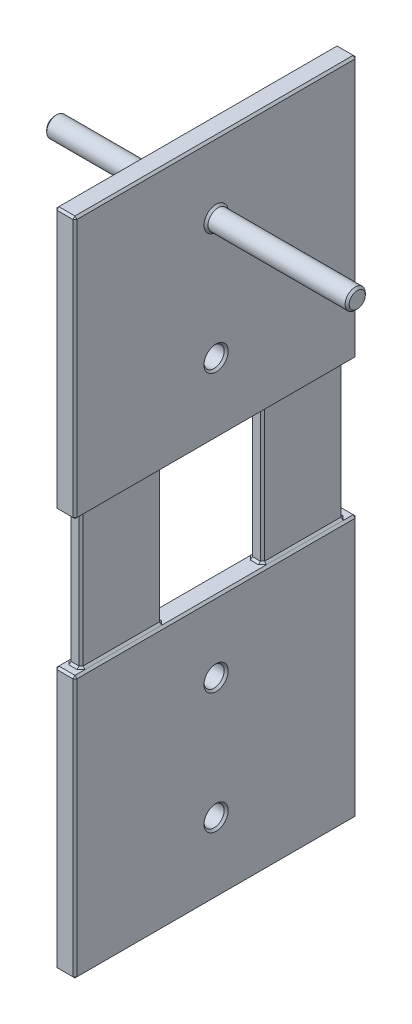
ISO-10303-21;
HEADER;
FILE_DESCRIPTION(('STEP AP214'),'2;1');
FILE_NAME('part.step','',(''),(''),'','','');
FILE_SCHEMA(('AUTOMOTIVE_DESIGN { 1 0 10303 214 1 1 1 1 }'));
ENDSEC;
DATA;
#1=APPLICATION_CONTEXT('core data for automotive mechanical design processes');
#2=APPLICATION_PROTOCOL_DEFINITION('international standard','automotive_design',2000,#1);
#3=PRODUCT_CONTEXT('',#1,'mechanical');
#4=PRODUCT('Part','Part','',(#3));
#5=PRODUCT_RELATED_PRODUCT_CATEGORY('part','',(#4));
#6=PRODUCT_DEFINITION_FORMATION('','',#4);
#7=PRODUCT_DEFINITION_CONTEXT('part definition',#1,'design');
#8=PRODUCT_DEFINITION('design','',#6,#7);
#9=PRODUCT_DEFINITION_SHAPE('','',#8);
#10=(LENGTH_UNIT() NAMED_UNIT(*) SI_UNIT(.MILLI.,.METRE.));
#11=(NAMED_UNIT(*) PLANE_ANGLE_UNIT() SI_UNIT($,.RADIAN.));
#12=(NAMED_UNIT(*) SI_UNIT($,.STERADIAN.) SOLID_ANGLE_UNIT());
#13=UNCERTAINTY_MEASURE_WITH_UNIT(LENGTH_MEASURE(1.E-05),#10,'distance_accuracy_value','');
#14=(GEOMETRIC_REPRESENTATION_CONTEXT(3) GLOBAL_UNCERTAINTY_ASSIGNED_CONTEXT((#13)) GLOBAL_UNIT_ASSIGNED_CONTEXT((#10,
#11,#12)) REPRESENTATION_CONTEXT('',''));
#15=CARTESIAN_POINT('',(0.,0.,0.));
#16=DIRECTION('',(0.,0.,1.));
#17=DIRECTION('',(1.,0.,0.));
#18=AXIS2_PLACEMENT_3D('',#15,#16,#17);
#19=CARTESIAN_POINT('',(0.5,-3.365,-6.99999999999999));
#20=DIRECTION('',(0.,-1.,0.));
#21=DIRECTION('',(0.,0.,-1.));
#22=AXIS2_PLACEMENT_3D('',#19,#20,#21);
#23=PLANE('',#22);
#24=DIRECTION('',(0.707106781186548,0.,0.707106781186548));
#25=VECTOR('',#24,1.);
#26=CARTESIAN_POINT('',(-0.199999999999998,-3.365,-2.39999999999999));
#27=LINE('',#26,#25);
#28=CARTESIAN_POINT('',(-0.399999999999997,-3.365,-2.59999999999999));
#29=VERTEX_POINT('',#28);
#30=CARTESIAN_POINT('',(-0.3,-3.365,-2.49999999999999));
#31=VERTEX_POINT('',#30);
#32=EDGE_CURVE('E539',#29,#31,#27,.T.);
#33=ORIENTED_EDGE('',*,*,#32,.F.);
#34=DIRECTION('',(0.,0.,1.));
#35=VECTOR('',#34,1.);
#36=CARTESIAN_POINT('',(-0.399999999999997,-3.365,-6.99999999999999));
#37=LINE('',#36,#35);
#38=CARTESIAN_POINT('',(-0.399999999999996,-3.365,2.6));
#39=VERTEX_POINT('',#38);
#40=EDGE_CURVE('E777',#29,#39,#37,.T.);
#41=ORIENTED_EDGE('',*,*,#40,.T.);
#42=DIRECTION('',(-0.707106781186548,0.,0.707106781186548));
#43=VECTOR('',#42,1.);
#44=CARTESIAN_POINT('',(-0.400000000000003,-3.365,2.60000000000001));
#45=LINE('',#44,#43);
#46=CARTESIAN_POINT('',(-0.3,-3.365,2.5));
#47=VERTEX_POINT('',#46);
#48=EDGE_CURVE('E498',#47,#39,#45,.T.);
#49=ORIENTED_EDGE('',*,*,#48,.F.);
#50=DIRECTION('',(-0.707106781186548,0.,0.707106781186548));
#51=VECTOR('',#50,1.);
#52=CARTESIAN_POINT('',(-0.400000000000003,-3.365,2.60000000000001));
#53=LINE('',#52,#51);
#54=CARTESIAN_POINT('',(-0.199999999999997,-3.365,2.4));
#55=VERTEX_POINT('',#54);
#56=EDGE_CURVE('E501',#55,#47,#53,.T.);
#57=ORIENTED_EDGE('',*,*,#56,.F.);
#58=DIRECTION('',(1.,0.,0.));
#59=VECTOR('',#58,1.);
#60=CARTESIAN_POINT('',(0.3,-3.365,2.4));
#61=LINE('',#60,#59);
#62=CARTESIAN_POINT('',(0.199999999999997,-3.365,2.4));
#63=VERTEX_POINT('',#62);
#64=EDGE_CURVE('E504',#55,#63,#61,.T.);
#65=ORIENTED_EDGE('',*,*,#64,.T.);
#66=DIRECTION('',(-0.707106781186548,0.,-0.707106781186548));
#67=VECTOR('',#66,1.);
#68=CARTESIAN_POINT('',(0.199999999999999,-3.365,2.4));
#69=LINE('',#68,#67);
#70=CARTESIAN_POINT('',(0.3,-3.365,2.5));
#71=VERTEX_POINT('',#70);
#72=EDGE_CURVE('E507',#71,#63,#69,.T.);
#73=ORIENTED_EDGE('',*,*,#72,.F.);
#74=DIRECTION('',(-0.707106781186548,0.,-0.707106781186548));
#75=VECTOR('',#74,1.);
#76=CARTESIAN_POINT('',(0.199999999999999,-3.365,2.4));
#77=LINE('',#76,#75);
#78=CARTESIAN_POINT('',(0.399999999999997,-3.365,2.6));
#79=VERTEX_POINT('',#78);
#80=EDGE_CURVE('E510',#79,#71,#77,.T.);
#81=ORIENTED_EDGE('',*,*,#80,.F.);
#82=DIRECTION('',(0.,0.,-1.));
#83=VECTOR('',#82,1.);
#84=CARTESIAN_POINT('',(0.399999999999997,-3.365,-6.99999999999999));
#85=LINE('',#84,#83);
#86=CARTESIAN_POINT('',(0.399999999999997,-3.365,-2.59999999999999));
#87=VERTEX_POINT('',#86);
#88=EDGE_CURVE('E1436',#79,#87,#85,.T.);
#89=ORIENTED_EDGE('',*,*,#88,.T.);
#90=DIRECTION('',(0.707106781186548,0.,-0.707106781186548));
#91=VECTOR('',#90,1.);
#92=CARTESIAN_POINT('',(0.400000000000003,-3.365,-2.59999999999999));
#93=LINE('',#92,#91);
#94=CARTESIAN_POINT('',(0.3,-3.365,-2.49999999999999));
#95=VERTEX_POINT('',#94);
#96=EDGE_CURVE('E527',#95,#87,#93,.T.);
#97=ORIENTED_EDGE('',*,*,#96,.F.);
#98=DIRECTION('',(0.707106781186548,0.,-0.707106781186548));
#99=VECTOR('',#98,1.);
#100=CARTESIAN_POINT('',(0.400000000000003,-3.365,-2.59999999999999));
#101=LINE('',#100,#99);
#102=CARTESIAN_POINT('',(0.200000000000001,-3.365,-2.39999999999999));
#103=VERTEX_POINT('',#102);
#104=EDGE_CURVE('E530',#103,#95,#101,.T.);
#105=ORIENTED_EDGE('',*,*,#104,.F.);
#106=DIRECTION('',(-1.,0.,0.));
#107=VECTOR('',#106,1.);
#108=CARTESIAN_POINT('',(-0.3,-3.365,-2.39999999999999));
#109=LINE('',#108,#107);
#110=CARTESIAN_POINT('',(-0.200000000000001,-3.365,-2.39999999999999));
#111=VERTEX_POINT('',#110);
#112=EDGE_CURVE('E533',#103,#111,#109,.T.);
#113=ORIENTED_EDGE('',*,*,#112,.T.);
#114=DIRECTION('',(0.707106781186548,0.,0.707106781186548));
#115=VECTOR('',#114,1.);
#116=CARTESIAN_POINT('',(-0.199999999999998,-3.365,-2.39999999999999));
#117=LINE('',#116,#115);
#118=EDGE_CURVE('E536',#31,#111,#117,.T.);
#119=ORIENTED_EDGE('',*,*,#118,.F.);
#120=EDGE_LOOP('',(#33,#41,#49,#57,#65,#73,#81,#89,#97,#105,#113,#119));
#121=FACE_BOUND('',#120,.T.);
#122=ADVANCED_FACE('F31',(#121),#23,.F.);
#123=DIRECTION('',(-0.707106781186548,0.,0.707106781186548));
#124=VECTOR('',#123,1.);
#125=CARTESIAN_POINT('',(-0.400000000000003,-3.365,-6.39999999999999));
#126=LINE('',#125,#124);
#127=CARTESIAN_POINT('',(-0.3,-3.365,-6.5));
#128=VERTEX_POINT('',#127);
#129=CARTESIAN_POINT('',(-0.399999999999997,-3.365,-6.4));
#130=VERTEX_POINT('',#129);
#131=EDGE_CURVE('E524',#128,#130,#126,.T.);
#132=ORIENTED_EDGE('',*,*,#131,.F.);
#133=DIRECTION('',(-0.707106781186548,0.,0.707106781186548));
#134=VECTOR('',#133,1.);
#135=CARTESIAN_POINT('',(-0.400000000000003,-3.365,-6.39999999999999));
#136=LINE('',#135,#134);
#137=CARTESIAN_POINT('',(-0.199999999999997,-3.365,-6.6));
#138=VERTEX_POINT('',#137);
#139=EDGE_CURVE('E521',#138,#128,#136,.T.);
#140=ORIENTED_EDGE('',*,*,#139,.F.);
#141=DIRECTION('',(1.,0.,0.));
#142=VECTOR('',#141,1.);
#143=CARTESIAN_POINT('',(0.3,-3.365,-6.6));
#144=LINE('',#143,#142);
#145=CARTESIAN_POINT('',(0.199999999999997,-3.365,-6.6));
#146=VERTEX_POINT('',#145);
#147=EDGE_CURVE('E519',#138,#146,#144,.T.);
#148=ORIENTED_EDGE('',*,*,#147,.T.);
#149=DIRECTION('',(-0.707106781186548,0.,-0.707106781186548));
#150=VECTOR('',#149,1.);
#151=CARTESIAN_POINT('',(0.199999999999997,-3.365,-6.6));
#152=LINE('',#151,#150);
#153=CARTESIAN_POINT('',(0.3,-3.365,-6.49999999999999));
#154=VERTEX_POINT('',#153);
#155=EDGE_CURVE('E513',#154,#146,#152,.T.);
#156=ORIENTED_EDGE('',*,*,#155,.F.);
#157=DIRECTION('',(-0.707106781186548,0.,-0.707106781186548));
#158=VECTOR('',#157,1.);
#159=CARTESIAN_POINT('',(0.199999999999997,-3.365,-6.6));
#160=LINE('',#159,#158);
#161=CARTESIAN_POINT('',(0.399999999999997,-3.365,-6.4));
#162=VERTEX_POINT('',#161);
#163=EDGE_CURVE('E516',#162,#154,#160,.T.);
#164=ORIENTED_EDGE('',*,*,#163,.F.);
#165=CARTESIAN_POINT('',(0.399999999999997,-3.365,-6.89999999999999));
#166=VERTEX_POINT('',#165);
#167=EDGE_CURVE('E1151',#162,#166,#85,.T.);
#168=ORIENTED_EDGE('',*,*,#167,.T.);
#169=DIRECTION('',(-1.,0.,0.));
#170=VECTOR('',#169,1.);
#171=CARTESIAN_POINT('',(0.5,-3.365,-6.89999999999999));
#172=LINE('',#171,#170);
#173=CARTESIAN_POINT('',(-0.399999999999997,-3.365,-6.89999999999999));
#174=VERTEX_POINT('',#173);
#175=EDGE_CURVE('E781',#166,#174,#172,.T.);
#176=ORIENTED_EDGE('',*,*,#175,.T.);
#177=EDGE_CURVE('E782',#174,#130,#37,.T.);
#178=ORIENTED_EDGE('',*,*,#177,.T.);
#179=EDGE_LOOP('',(#132,#140,#148,#156,#164,#168,#176,#178));
#180=FACE_BOUND('',#179,.T.);
#181=ADVANCED_FACE('F1159',(#180),#23,.F.);
#182=DIRECTION('',(0.70710678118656,0.,-0.707106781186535));
#183=VECTOR('',#182,1.);
#184=CARTESIAN_POINT('',(0.399999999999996,-3.365,6.4));
#185=LINE('',#184,#183);
#186=CARTESIAN_POINT('',(0.3,-3.365,6.5));
#187=VERTEX_POINT('',#186);
#188=CARTESIAN_POINT('',(0.399999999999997,-3.365,6.4));
#189=VERTEX_POINT('',#188);
#190=EDGE_CURVE('E495',#187,#189,#185,.T.);
#191=ORIENTED_EDGE('',*,*,#190,.F.);
#192=DIRECTION('',(0.70710678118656,0.,-0.707106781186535));
#193=VECTOR('',#192,1.);
#194=CARTESIAN_POINT('',(0.399999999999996,-3.365,6.4));
#195=LINE('',#194,#193);
#196=CARTESIAN_POINT('',(0.200000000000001,-3.365,6.6));
#197=VERTEX_POINT('',#196);
#198=EDGE_CURVE('E492',#197,#187,#195,.T.);
#199=ORIENTED_EDGE('',*,*,#198,.F.);
#200=DIRECTION('',(-1.,0.,0.));
#201=VECTOR('',#200,1.);
#202=CARTESIAN_POINT('',(-0.3,-3.365,6.6));
#203=LINE('',#202,#201);
#204=CARTESIAN_POINT('',(-0.200000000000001,-3.365,6.6));
#205=VERTEX_POINT('',#204);
#206=EDGE_CURVE('E490',#197,#205,#203,.T.);
#207=ORIENTED_EDGE('',*,*,#206,.T.);
#208=DIRECTION('',(0.70710678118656,0.,0.707106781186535));
#209=VECTOR('',#208,1.);
#210=CARTESIAN_POINT('',(-0.200000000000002,-3.365,6.59999999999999));
#211=LINE('',#210,#209);
#212=CARTESIAN_POINT('',(-0.3,-3.365,6.5));
#213=VERTEX_POINT('',#212);
#214=EDGE_CURVE('E485',#213,#205,#211,.T.);
#215=ORIENTED_EDGE('',*,*,#214,.F.);
#216=DIRECTION('',(0.70710678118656,0.,0.707106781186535));
#217=VECTOR('',#216,1.);
#218=CARTESIAN_POINT('',(-0.200000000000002,-3.365,6.59999999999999));
#219=LINE('',#218,#217);
#220=CARTESIAN_POINT('',(-0.399999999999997,-3.365,6.40000000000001));
#221=VERTEX_POINT('',#220);
#222=EDGE_CURVE('E487',#221,#213,#219,.T.);
#223=ORIENTED_EDGE('',*,*,#222,.F.);
#224=CARTESIAN_POINT('',(-0.399999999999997,-3.365,6.9));
#225=VERTEX_POINT('',#224);
#226=EDGE_CURVE('E778',#221,#225,#37,.T.);
#227=ORIENTED_EDGE('',*,*,#226,.T.);
#228=DIRECTION('',(1.,0.,0.));
#229=VECTOR('',#228,1.);
#230=CARTESIAN_POINT('',(0.5,-3.365,6.9));
#231=LINE('',#230,#229);
#232=CARTESIAN_POINT('',(0.399999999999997,-3.365,6.9));
#233=VERTEX_POINT('',#232);
#234=EDGE_CURVE('E1153',#225,#233,#231,.T.);
#235=ORIENTED_EDGE('',*,*,#234,.T.);
#236=EDGE_CURVE('E1152',#233,#189,#85,.T.);
#237=ORIENTED_EDGE('',*,*,#236,.T.);
#238=EDGE_LOOP('',(#191,#199,#207,#215,#223,#227,#235,#237));
#239=FACE_BOUND('',#238,.T.);
#240=ADVANCED_FACE('F725',(#239),#23,.F.);
#241=CARTESIAN_POINT('',(0.5,3.365,-7.));
#242=DIRECTION('',(0.,1.,0.));
#243=DIRECTION('',(0.,0.,1.));
#244=AXIS2_PLACEMENT_3D('',#241,#242,#243);
#245=PLANE('',#244);
#246=DIRECTION('',(-0.707106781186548,0.,0.707106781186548));
#247=VECTOR('',#246,1.);
#248=CARTESIAN_POINT('',(0.199999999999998,3.365,-2.4));
#249=LINE('',#248,#247);
#250=CARTESIAN_POINT('',(0.400000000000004,3.365,-2.6));
#251=VERTEX_POINT('',#250);
#252=CARTESIAN_POINT('',(0.3,3.365,-2.5));
#253=VERTEX_POINT('',#252);
#254=EDGE_CURVE('E473',#251,#253,#249,.T.);
#255=ORIENTED_EDGE('',*,*,#254,.F.);
#256=DIRECTION('',(0.,0.,1.));
#257=VECTOR('',#256,1.);
#258=CARTESIAN_POINT('',(0.400000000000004,3.365,7.));
#259=LINE('',#258,#257);
#260=CARTESIAN_POINT('',(0.400000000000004,3.365,2.60000000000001));
#261=VERTEX_POINT('',#260);
#262=EDGE_CURVE('E1418',#251,#261,#259,.T.);
#263=ORIENTED_EDGE('',*,*,#262,.T.);
#264=DIRECTION('',(0.707106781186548,0.,0.707106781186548));
#265=VECTOR('',#264,1.);
#266=CARTESIAN_POINT('',(0.399999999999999,3.365,2.6));
#267=LINE('',#266,#265);
#268=CARTESIAN_POINT('',(0.3,3.365,2.5));
#269=VERTEX_POINT('',#268);
#270=EDGE_CURVE('E1021',#269,#261,#267,.T.);
#271=ORIENTED_EDGE('',*,*,#270,.F.);
#272=DIRECTION('',(0.707106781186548,0.,0.707106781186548));
#273=VECTOR('',#272,1.);
#274=CARTESIAN_POINT('',(0.399999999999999,3.365,2.6));
#275=LINE('',#274,#273);
#276=CARTESIAN_POINT('',(0.199999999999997,3.365,2.4));
#277=VERTEX_POINT('',#276);
#278=EDGE_CURVE('E1023',#277,#269,#275,.T.);
#279=ORIENTED_EDGE('',*,*,#278,.F.);
#280=DIRECTION('',(-1.,0.,0.));
#281=VECTOR('',#280,1.);
#282=CARTESIAN_POINT('',(-0.3,3.365,2.4));
#283=LINE('',#282,#281);
#284=CARTESIAN_POINT('',(-0.199999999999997,3.365,2.4));
#285=VERTEX_POINT('',#284);
#286=EDGE_CURVE('E1026',#277,#285,#283,.T.);
#287=ORIENTED_EDGE('',*,*,#286,.T.);
#288=DIRECTION('',(0.707106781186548,0.,-0.707106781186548));
#289=VECTOR('',#288,1.);
#290=CARTESIAN_POINT('',(-0.200000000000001,3.365,2.4));
#291=LINE('',#290,#289);
#292=CARTESIAN_POINT('',(-0.3,3.365,2.5));
#293=VERTEX_POINT('',#292);
#294=EDGE_CURVE('E1029',#293,#285,#291,.T.);
#295=ORIENTED_EDGE('',*,*,#294,.F.);
#296=DIRECTION('',(0.707106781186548,0.,-0.707106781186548));
#297=VECTOR('',#296,1.);
#298=CARTESIAN_POINT('',(-0.200000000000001,3.365,2.4));
#299=LINE('',#298,#297);
#300=CARTESIAN_POINT('',(-0.400000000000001,3.365,2.6));
#301=VERTEX_POINT('',#300);
#302=EDGE_CURVE('E444',#301,#293,#299,.T.);
#303=ORIENTED_EDGE('',*,*,#302,.F.);
#304=DIRECTION('',(0.,0.,-1.));
#305=VECTOR('',#304,1.);
#306=CARTESIAN_POINT('',(-0.400000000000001,3.365,-7.));
#307=LINE('',#306,#305);
#308=CARTESIAN_POINT('',(-0.400000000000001,3.365,-2.6));
#309=VERTEX_POINT('',#308);
#310=EDGE_CURVE('E1040',#301,#309,#307,.T.);
#311=ORIENTED_EDGE('',*,*,#310,.T.);
#312=DIRECTION('',(-0.707106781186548,0.,-0.707106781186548));
#313=VECTOR('',#312,1.);
#314=CARTESIAN_POINT('',(-0.4,3.365,-2.59999999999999));
#315=LINE('',#314,#313);
#316=CARTESIAN_POINT('',(-0.3,3.365,-2.49999999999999));
#317=VERTEX_POINT('',#316);
#318=EDGE_CURVE('E462',#317,#309,#315,.T.);
#319=ORIENTED_EDGE('',*,*,#318,.F.);
#320=DIRECTION('',(-0.707106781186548,0.,-0.707106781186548));
#321=VECTOR('',#320,1.);
#322=CARTESIAN_POINT('',(-0.4,3.365,-2.59999999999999));
#323=LINE('',#322,#321);
#324=CARTESIAN_POINT('',(-0.200000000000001,3.365,-2.4));
#325=VERTEX_POINT('',#324);
#326=EDGE_CURVE('E465',#325,#317,#323,.T.);
#327=ORIENTED_EDGE('',*,*,#326,.F.);
#328=DIRECTION('',(1.,0.,0.));
#329=VECTOR('',#328,1.);
#330=CARTESIAN_POINT('',(0.3,3.365,-2.4));
#331=LINE('',#330,#329);
#332=CARTESIAN_POINT('',(0.200000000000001,3.365,-2.4));
#333=VERTEX_POINT('',#332);
#334=EDGE_CURVE('E468',#325,#333,#331,.T.);
#335=ORIENTED_EDGE('',*,*,#334,.T.);
#336=DIRECTION('',(-0.707106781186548,0.,0.707106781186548));
#337=VECTOR('',#336,1.);
#338=CARTESIAN_POINT('',(0.199999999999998,3.365,-2.4));
#339=LINE('',#338,#337);
#340=EDGE_CURVE('E471',#253,#333,#339,.T.);
#341=ORIENTED_EDGE('',*,*,#340,.F.);
#342=EDGE_LOOP('',(#255,#263,#271,#279,#287,#295,#303,#311,#319,#327,#335,#341));
#343=FACE_BOUND('',#342,.T.);
#344=ADVANCED_FACE('F1039',(#343),#245,.F.);
#345=DIRECTION('',(0.707106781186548,0.,0.707106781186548));
#346=VECTOR('',#345,1.);
#347=CARTESIAN_POINT('',(0.400000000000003,3.365,-6.39999999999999));
#348=LINE('',#347,#346);
#349=CARTESIAN_POINT('',(0.3,3.365,-6.5));
#350=VERTEX_POINT('',#349);
#351=CARTESIAN_POINT('',(0.400000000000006,3.365,-6.39999999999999));
#352=VERTEX_POINT('',#351);
#353=EDGE_CURVE('E459',#350,#352,#348,.T.);
#354=ORIENTED_EDGE('',*,*,#353,.F.);
#355=DIRECTION('',(0.707106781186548,0.,0.707106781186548));
#356=VECTOR('',#355,1.);
#357=CARTESIAN_POINT('',(0.400000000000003,3.365,-6.39999999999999));
#358=LINE('',#357,#356);
#359=CARTESIAN_POINT('',(0.199999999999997,3.365,-6.6));
#360=VERTEX_POINT('',#359);
#361=EDGE_CURVE('E453',#360,#350,#358,.T.);
#362=ORIENTED_EDGE('',*,*,#361,.F.);
#363=DIRECTION('',(-1.,0.,0.));
#364=VECTOR('',#363,1.);
#365=CARTESIAN_POINT('',(-0.3,3.365,-6.6));
#366=LINE('',#365,#364);
#367=CARTESIAN_POINT('',(-0.199999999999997,3.365,-6.6));
#368=VERTEX_POINT('',#367);
#369=EDGE_CURVE('E440',#360,#368,#366,.T.);
#370=ORIENTED_EDGE('',*,*,#369,.T.);
#371=DIRECTION('',(0.707106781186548,0.,-0.707106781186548));
#372=VECTOR('',#371,1.);
#373=CARTESIAN_POINT('',(-0.199999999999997,3.365,-6.6));
#374=LINE('',#373,#372);
#375=CARTESIAN_POINT('',(-0.3,3.36499999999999,-6.5));
#376=VERTEX_POINT('',#375);
#377=EDGE_CURVE('E434',#376,#368,#374,.T.);
#378=ORIENTED_EDGE('',*,*,#377,.F.);
#379=DIRECTION('',(0.707106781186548,0.,-0.707106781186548));
#380=VECTOR('',#379,1.);
#381=CARTESIAN_POINT('',(-0.199999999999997,3.365,-6.6));
#382=LINE('',#381,#380);
#383=CARTESIAN_POINT('',(-0.400000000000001,3.365,-6.4));
#384=VERTEX_POINT('',#383);
#385=EDGE_CURVE('E437',#384,#376,#382,.T.);
#386=ORIENTED_EDGE('',*,*,#385,.F.);
#387=CARTESIAN_POINT('',(-0.400000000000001,3.365,-6.9));
#388=VERTEX_POINT('',#387);
#389=EDGE_CURVE('E839',#384,#388,#307,.T.);
#390=ORIENTED_EDGE('',*,*,#389,.T.);
#391=DIRECTION('',(1.,0.,0.));
#392=VECTOR('',#391,1.);
#393=CARTESIAN_POINT('',(0.5,3.365,-6.9));
#394=LINE('',#393,#392);
#395=CARTESIAN_POINT('',(0.400000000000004,3.365,-6.9));
#396=VERTEX_POINT('',#395);
#397=EDGE_CURVE('E833',#388,#396,#394,.T.);
#398=ORIENTED_EDGE('',*,*,#397,.T.);
#399=EDGE_CURVE('E830',#396,#352,#259,.T.);
#400=ORIENTED_EDGE('',*,*,#399,.T.);
#401=EDGE_LOOP('',(#354,#362,#370,#378,#386,#390,#398,#400));
#402=FACE_BOUND('',#401,.T.);
#403=ADVANCED_FACE('F436',(#402),#245,.F.);
#404=DIRECTION('',(-0.70710678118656,0.,-0.707106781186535));
#405=VECTOR('',#404,1.);
#406=CARTESIAN_POINT('',(-0.400000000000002,3.365,6.4));
#407=LINE('',#406,#405);
#408=CARTESIAN_POINT('',(-0.3,3.365,6.5));
#409=VERTEX_POINT('',#408);
#410=CARTESIAN_POINT('',(-0.400000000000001,3.365,6.4));
#411=VERTEX_POINT('',#410);
#412=EDGE_CURVE('E1018',#409,#411,#407,.T.);
#413=ORIENTED_EDGE('',*,*,#412,.F.);
#414=DIRECTION('',(-0.70710678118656,0.,-0.707106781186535));
#415=VECTOR('',#414,1.);
#416=CARTESIAN_POINT('',(-0.400000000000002,3.365,6.4));
#417=LINE('',#416,#415);
#418=CARTESIAN_POINT('',(-0.200000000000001,3.365,6.6));
#419=VERTEX_POINT('',#418);
#420=EDGE_CURVE('E1015',#419,#409,#417,.T.);
#421=ORIENTED_EDGE('',*,*,#420,.F.);
#422=DIRECTION('',(1.,0.,0.));
#423=VECTOR('',#422,1.);
#424=CARTESIAN_POINT('',(0.3,3.365,6.6));
#425=LINE('',#424,#423);
#426=CARTESIAN_POINT('',(0.200000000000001,3.365,6.6));
#427=VERTEX_POINT('',#426);
#428=EDGE_CURVE('E1013',#419,#427,#425,.T.);
#429=ORIENTED_EDGE('',*,*,#428,.T.);
#430=DIRECTION('',(-0.70710678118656,0.,0.707106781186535));
#431=VECTOR('',#430,1.);
#432=CARTESIAN_POINT('',(0.200000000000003,3.365,6.59999999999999));
#433=LINE('',#432,#431);
#434=CARTESIAN_POINT('',(0.3,3.365,6.5));
#435=VERTEX_POINT('',#434);
#436=EDGE_CURVE('E753',#435,#427,#433,.T.);
#437=ORIENTED_EDGE('',*,*,#436,.F.);
#438=DIRECTION('',(-0.70710678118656,0.,0.707106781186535));
#439=VECTOR('',#438,1.);
#440=CARTESIAN_POINT('',(0.200000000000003,3.365,6.59999999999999));
#441=LINE('',#440,#439);
#442=CARTESIAN_POINT('',(0.400000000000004,3.365,6.4));
#443=VERTEX_POINT('',#442);
#444=EDGE_CURVE('E1011',#443,#435,#441,.T.);
#445=ORIENTED_EDGE('',*,*,#444,.F.);
#446=CARTESIAN_POINT('',(0.400000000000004,3.365,6.9));
#447=VERTEX_POINT('',#446);
#448=EDGE_CURVE('E829',#443,#447,#259,.T.);
#449=ORIENTED_EDGE('',*,*,#448,.T.);
#450=DIRECTION('',(-1.,0.,0.));
#451=VECTOR('',#450,1.);
#452=CARTESIAN_POINT('',(0.5,3.365,6.9));
#453=LINE('',#452,#451);
#454=CARTESIAN_POINT('',(-0.400000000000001,3.365,6.9));
#455=VERTEX_POINT('',#454);
#456=EDGE_CURVE('E836',#447,#455,#453,.T.);
#457=ORIENTED_EDGE('',*,*,#456,.T.);
#458=EDGE_CURVE('E840',#455,#411,#307,.T.);
#459=ORIENTED_EDGE('',*,*,#458,.T.);
#460=EDGE_LOOP('',(#413,#421,#429,#437,#445,#449,#457,#459));
#461=FACE_BOUND('',#460,.T.);
#462=ADVANCED_FACE('F1054',(#461),#245,.F.);
#463=CARTESIAN_POINT('',(0.5,16.365,7.));
#464=DIRECTION('',(1.,0.,0.));
#465=DIRECTION('',(0.,0.,-1.));
#466=AXIS2_PLACEMENT_3D('',#463,#464,#465);
#467=PLANE('',#466);
#468=CARTESIAN_POINT('',(0.5,6.865,0.));
#469=DIRECTION('',(1.,0.,0.));
#470=DIRECTION('',(0.,0.,-1.));
#471=AXIS2_PLACEMENT_3D('',#468,#469,#470);
#472=CIRCLE('',#471,0.60000000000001);
#473=CARTESIAN_POINT('',(0.5,6.865,-0.600000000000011));
#474=VERTEX_POINT('',#473);
#475=EDGE_CURVE('E808',#474,#474,#472,.F.);
#476=ORIENTED_EDGE('',*,*,#475,.T.);
#477=EDGE_LOOP('',(#476));
#478=FACE_BOUND('',#477,.T.);
#479=DIRECTION('',(0.,1.,0.));
#480=VECTOR('',#479,1.);
#481=CARTESIAN_POINT('',(0.5,16.365,-6.9));
#482=LINE('',#481,#480);
#483=CARTESIAN_POINT('',(0.5,3.465,-6.9));
#484=VERTEX_POINT('',#483);
#485=CARTESIAN_POINT('',(0.5,16.265,-6.9));
#486=VERTEX_POINT('',#485);
#487=EDGE_CURVE('E803',#484,#486,#482,.T.);
#488=ORIENTED_EDGE('',*,*,#487,.T.);
#489=DIRECTION('',(0.,0.,1.));
#490=VECTOR('',#489,1.);
#491=CARTESIAN_POINT('',(0.5,16.265,7.));
#492=LINE('',#491,#490);
#493=CARTESIAN_POINT('',(0.5,16.265,6.9));
#494=VERTEX_POINT('',#493);
#495=EDGE_CURVE('E805',#486,#494,#492,.T.);
#496=ORIENTED_EDGE('',*,*,#495,.T.);
#497=DIRECTION('',(0.,-1.,0.));
#498=VECTOR('',#497,1.);
#499=CARTESIAN_POINT('',(0.5,3.365,6.9));
#500=LINE('',#499,#498);
#501=CARTESIAN_POINT('',(0.5,3.465,6.9));
#502=VERTEX_POINT('',#501);
#503=EDGE_CURVE('E799',#494,#502,#500,.T.);
#504=ORIENTED_EDGE('',*,*,#503,.T.);
#505=DIRECTION('',(0.,0.,-1.));
#506=VECTOR('',#505,1.);
#507=CARTESIAN_POINT('',(0.5,3.465,-7.));
#508=LINE('',#507,#506);
#509=EDGE_CURVE('E801',#502,#484,#508,.T.);
#510=ORIENTED_EDGE('',*,*,#509,.T.);
#511=EDGE_LOOP('',(#488,#496,#504,#510));
#512=FACE_BOUND('',#511,.T.);
#513=CARTESIAN_POINT('',(0.5,12.865,0.));
#514=DIRECTION('',(1.,0.,0.));
#515=DIRECTION('',(0.,0.,-1.));
#516=AXIS2_PLACEMENT_3D('',#513,#514,#515);
#517=CIRCLE('',#516,0.599999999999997);
#518=CARTESIAN_POINT('',(0.5,12.865,-0.599999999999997));
#519=VERTEX_POINT('',#518);
#520=EDGE_CURVE('E796',#519,#519,#517,.F.);
#521=ORIENTED_EDGE('',*,*,#520,.T.);
#522=EDGE_LOOP('',(#521));
#523=FACE_BOUND('',#522,.T.);
#524=ADVANCED_FACE('F1273',(#478,#512,#523),#467,.T.);
#525=CARTESIAN_POINT('',(-0.5,16.365,7.));
#526=DIRECTION('',(1.,0.,0.));
#527=DIRECTION('',(0.,0.,-1.));
#528=AXIS2_PLACEMENT_3D('',#525,#526,#527);
#529=PLANE('',#528);
#530=CARTESIAN_POINT('',(-0.5,6.865,0.));
#531=DIRECTION('',(1.,0.,0.));
#532=DIRECTION('',(0.,0.,-1.));
#533=AXIS2_PLACEMENT_3D('',#530,#531,#532);
#534=CIRCLE('',#533,0.600000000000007);
#535=CARTESIAN_POINT('',(-0.5,6.865,-0.600000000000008));
#536=VERTEX_POINT('',#535);
#537=EDGE_CURVE('E1072',#536,#536,#534,.T.);
#538=ORIENTED_EDGE('',*,*,#537,.T.);
#539=EDGE_LOOP('',(#538));
#540=FACE_BOUND('',#539,.T.);
#541=CARTESIAN_POINT('',(-0.5,12.865,0.));
#542=DIRECTION('',(1.,0.,0.));
#543=DIRECTION('',(0.,0.,-1.));
#544=AXIS2_PLACEMENT_3D('',#541,#542,#543);
#545=CIRCLE('',#544,0.600000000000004);
#546=CARTESIAN_POINT('',(-0.5,12.865,-0.600000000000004));
#547=VERTEX_POINT('',#546);
#548=EDGE_CURVE('E1069',#547,#547,#545,.T.);
#549=ORIENTED_EDGE('',*,*,#548,.T.);
#550=EDGE_LOOP('',(#549));
#551=FACE_BOUND('',#550,.T.);
#552=DIRECTION('',(0.,-1.,0.));
#553=VECTOR('',#552,1.);
#554=CARTESIAN_POINT('',(-0.5,16.365,-6.90000000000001));
#555=LINE('',#554,#553);
#556=CARTESIAN_POINT('',(-0.5,16.265,-6.90000000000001));
#557=VERTEX_POINT('',#556);
#558=CARTESIAN_POINT('',(-0.5,3.46499999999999,-6.9));
#559=VERTEX_POINT('',#558);
#560=EDGE_CURVE('E1068',#557,#559,#555,.T.);
#561=ORIENTED_EDGE('',*,*,#560,.T.);
#562=DIRECTION('',(0.,0.,1.));
#563=VECTOR('',#562,1.);
#564=CARTESIAN_POINT('',(-0.5,3.46499999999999,7.));
#565=LINE('',#564,#563);
#566=CARTESIAN_POINT('',(-0.5,3.46499999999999,6.9));
#567=VERTEX_POINT('',#566);
#568=EDGE_CURVE('E1059',#559,#567,#565,.T.);
#569=ORIENTED_EDGE('',*,*,#568,.T.);
#570=DIRECTION('',(0.,1.,0.));
#571=VECTOR('',#570,1.);
#572=CARTESIAN_POINT('',(-0.5,16.365,6.9));
#573=LINE('',#572,#571);
#574=CARTESIAN_POINT('',(-0.5,16.265,6.9));
#575=VERTEX_POINT('',#574);
#576=EDGE_CURVE('E1065',#567,#575,#573,.T.);
#577=ORIENTED_EDGE('',*,*,#576,.T.);
#578=DIRECTION('',(0.,0.,-1.));
#579=VECTOR('',#578,1.);
#580=CARTESIAN_POINT('',(-0.5,16.265,7.));
#581=LINE('',#580,#579);
#582=EDGE_CURVE('E2395',#575,#557,#581,.T.);
#583=ORIENTED_EDGE('',*,*,#582,.T.);
#584=EDGE_LOOP('',(#561,#569,#577,#583));
#585=FACE_BOUND('',#584,.T.);
#586=ADVANCED_FACE('F1064',(#540,#551,#585),#529,.F.);
#587=CARTESIAN_POINT('',(0.5,3.365,7.));
#588=DIRECTION('',(0.,0.,-1.));
#589=DIRECTION('',(0.,1.,0.));
#590=AXIS2_PLACEMENT_3D('',#587,#588,#589);
#591=PLANE('',#590);
#592=DIRECTION('',(-1.,0.,0.));
#593=VECTOR('',#592,1.);
#594=CARTESIAN_POINT('',(0.5,16.265,7.));
#595=LINE('',#594,#593);
#596=CARTESIAN_POINT('',(0.400000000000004,16.265,7.));
#597=VERTEX_POINT('',#596);
#598=CARTESIAN_POINT('',(-0.400000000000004,16.265,7.));
#599=VERTEX_POINT('',#598);
#600=EDGE_CURVE('E815',#597,#599,#595,.T.);
#601=ORIENTED_EDGE('',*,*,#600,.T.);
#602=DIRECTION('',(0.,-1.,0.));
#603=VECTOR('',#602,1.);
#604=CARTESIAN_POINT('',(-0.400000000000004,3.365,7.));
#605=LINE('',#604,#603);
#606=CARTESIAN_POINT('',(-0.400000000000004,3.46499999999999,7.));
#607=VERTEX_POINT('',#606);
#608=EDGE_CURVE('E818',#599,#607,#605,.T.);
#609=ORIENTED_EDGE('',*,*,#608,.T.);
#610=DIRECTION('',(1.,0.,0.));
#611=VECTOR('',#610,1.);
#612=CARTESIAN_POINT('',(0.5,3.46499999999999,7.));
#613=LINE('',#612,#611);
#614=CARTESIAN_POINT('',(0.400000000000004,3.46499999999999,7.));
#615=VERTEX_POINT('',#614);
#616=EDGE_CURVE('E813',#607,#615,#613,.T.);
#617=ORIENTED_EDGE('',*,*,#616,.T.);
#618=DIRECTION('',(0.,1.,0.));
#619=VECTOR('',#618,1.);
#620=CARTESIAN_POINT('',(0.400000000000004,16.365,7.));
#621=LINE('',#620,#619);
#622=EDGE_CURVE('E811',#615,#597,#621,.T.);
#623=ORIENTED_EDGE('',*,*,#622,.T.);
#624=EDGE_LOOP('',(#601,#609,#617,#623));
#625=FACE_BOUND('',#624,.T.);
#626=ADVANCED_FACE('F1282',(#625),#591,.F.);
#627=CARTESIAN_POINT('',(0.5,3.365,-7.));
#628=DIRECTION('',(0.,0.,1.));
#629=DIRECTION('',(0.,-1.,0.));
#630=AXIS2_PLACEMENT_3D('',#627,#628,#629);
#631=PLANE('',#630);
#632=DIRECTION('',(0.,-1.,0.));
#633=VECTOR('',#632,1.);
#634=CARTESIAN_POINT('',(0.400000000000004,3.365,-7.));
#635=LINE('',#634,#633);
#636=CARTESIAN_POINT('',(0.400000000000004,16.265,-7.));
#637=VERTEX_POINT('',#636);
#638=CARTESIAN_POINT('',(0.400000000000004,3.465,-7.));
#639=VERTEX_POINT('',#638);
#640=EDGE_CURVE('E843',#637,#639,#635,.T.);
#641=ORIENTED_EDGE('',*,*,#640,.T.);
#642=DIRECTION('',(-1.,0.,0.));
#643=VECTOR('',#642,1.);
#644=CARTESIAN_POINT('',(0.5,3.465,-7.));
#645=LINE('',#644,#643);
#646=CARTESIAN_POINT('',(-0.400000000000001,3.465,-7.));
#647=VERTEX_POINT('',#646);
#648=EDGE_CURVE('E850',#639,#647,#645,.T.);
#649=ORIENTED_EDGE('',*,*,#648,.T.);
#650=DIRECTION('',(0.,1.,0.));
#651=VECTOR('',#650,1.);
#652=CARTESIAN_POINT('',(-0.400000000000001,3.365,-7.));
#653=LINE('',#652,#651);
#654=CARTESIAN_POINT('',(-0.400000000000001,16.265,-7.));
#655=VERTEX_POINT('',#654);
#656=EDGE_CURVE('E848',#647,#655,#653,.T.);
#657=ORIENTED_EDGE('',*,*,#656,.T.);
#658=DIRECTION('',(1.,0.,0.));
#659=VECTOR('',#658,1.);
#660=CARTESIAN_POINT('',(0.5,16.265,-7.));
#661=LINE('',#660,#659);
#662=EDGE_CURVE('E846',#655,#637,#661,.T.);
#663=ORIENTED_EDGE('',*,*,#662,.T.);
#664=EDGE_LOOP('',(#641,#649,#657,#663));
#665=FACE_BOUND('',#664,.T.);
#666=ADVANCED_FACE('F1292',(#665),#631,.F.);
#667=CARTESIAN_POINT('',(0.5,16.365,-7.));
#668=DIRECTION('',(0.,-1.,0.));
#669=DIRECTION('',(0.,0.,-1.));
#670=AXIS2_PLACEMENT_3D('',#667,#668,#669);
#671=PLANE('',#670);
#672=DIRECTION('',(0.,0.,1.));
#673=VECTOR('',#672,1.);
#674=CARTESIAN_POINT('',(-0.400000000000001,16.365,-7.));
#675=LINE('',#674,#673);
#676=CARTESIAN_POINT('',(-0.400000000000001,16.365,-6.9));
#677=VERTEX_POINT('',#676);
#678=CARTESIAN_POINT('',(-0.400000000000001,16.365,6.9));
#679=VERTEX_POINT('',#678);
#680=EDGE_CURVE('E824',#677,#679,#675,.T.);
#681=ORIENTED_EDGE('',*,*,#680,.T.);
#682=DIRECTION('',(1.,0.,0.));
#683=VECTOR('',#682,1.);
#684=CARTESIAN_POINT('',(0.5,16.365,6.9));
#685=LINE('',#684,#683);
#686=CARTESIAN_POINT('',(0.400000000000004,16.365,6.9));
#687=VERTEX_POINT('',#686);
#688=EDGE_CURVE('E826',#679,#687,#685,.T.);
#689=ORIENTED_EDGE('',*,*,#688,.T.);
#690=DIRECTION('',(0.,0.,-1.));
#691=VECTOR('',#690,1.);
#692=CARTESIAN_POINT('',(0.400000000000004,16.365,-7.));
#693=LINE('',#692,#691);
#694=CARTESIAN_POINT('',(0.400000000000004,16.365,-6.9));
#695=VERTEX_POINT('',#694);
#696=EDGE_CURVE('E820',#687,#695,#693,.T.);
#697=ORIENTED_EDGE('',*,*,#696,.T.);
#698=DIRECTION('',(-1.,0.,0.));
#699=VECTOR('',#698,1.);
#700=CARTESIAN_POINT('',(0.5,16.365,-6.9));
#701=LINE('',#700,#699);
#702=EDGE_CURVE('E822',#695,#677,#701,.T.);
#703=ORIENTED_EDGE('',*,*,#702,.T.);
#704=EDGE_LOOP('',(#681,#689,#697,#703));
#705=FACE_BOUND('',#704,.T.);
#706=ADVANCED_FACE('F1290',(#705),#671,.F.);
#707=CARTESIAN_POINT('',(0.5,6.865,0.));
#708=DIRECTION('',(-1.,0.,0.));
#709=DIRECTION('',(0.,0.,1.));
#710=AXIS2_PLACEMENT_3D('',#707,#708,#709);
#711=CYLINDRICAL_SURFACE('',#710,0.5);
#712=CARTESIAN_POINT('',(-0.399999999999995,6.865,0.));
#713=DIRECTION('',(1.,0.,0.));
#714=DIRECTION('',(0.,0.,-1.));
#715=AXIS2_PLACEMENT_3D('',#712,#713,#714);
#716=CIRCLE('',#715,0.5);
#717=CARTESIAN_POINT('',(-0.399999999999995,6.865,-0.500000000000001));
#718=VERTEX_POINT('',#717);
#719=EDGE_CURVE('E1082',#718,#718,#716,.F.);
#720=ORIENTED_EDGE('',*,*,#719,.T.);
#721=EDGE_LOOP('',(#720));
#722=FACE_BOUND('',#721,.T.);
#723=CARTESIAN_POINT('',(0.399999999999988,6.865,0.));
#724=DIRECTION('',(1.,0.,0.));
#725=DIRECTION('',(0.,0.,-1.));
#726=AXIS2_PLACEMENT_3D('',#723,#724,#725);
#727=CIRCLE('',#726,0.5);
#728=CARTESIAN_POINT('',(0.399999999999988,6.865,-0.500000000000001));
#729=VERTEX_POINT('',#728);
#730=EDGE_CURVE('E1079',#729,#729,#727,.T.);
#731=ORIENTED_EDGE('',*,*,#730,.T.);
#732=EDGE_LOOP('',(#731));
#733=FACE_BOUND('',#732,.T.);
#734=ADVANCED_FACE('F1287',(#722,#733),#711,.F.);
#735=CARTESIAN_POINT('',(-7.5,12.865,0.));
#736=DIRECTION('',(1.,0.,0.));
#737=DIRECTION('',(0.,0.,-1.));
#738=AXIS2_PLACEMENT_3D('',#735,#736,#737);
#739=PLANE('',#738);
#740=CARTESIAN_POINT('',(-7.5,12.865,0.));
#741=DIRECTION('',(1.,0.,0.));
#742=DIRECTION('',(0.,0.,-1.));
#743=AXIS2_PLACEMENT_3D('',#740,#741,#742);
#744=CIRCLE('',#743,0.400000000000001);
#745=CARTESIAN_POINT('',(-7.5,12.865,-0.400000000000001));
#746=VERTEX_POINT('',#745);
#747=EDGE_CURVE('E853',#746,#746,#744,.F.);
#748=ORIENTED_EDGE('',*,*,#747,.T.);
#749=EDGE_LOOP('',(#748));
#750=FACE_BOUND('',#749,.T.);
#751=ADVANCED_FACE('F2302',(#750),#739,.F.);
#752=CARTESIAN_POINT('',(7.5,12.865,0.));
#753=DIRECTION('',(-1.,0.,0.));
#754=DIRECTION('',(0.,0.,1.));
#755=AXIS2_PLACEMENT_3D('',#752,#753,#754);
#756=CYLINDRICAL_SURFACE('',#755,0.5);
#757=CARTESIAN_POINT('',(-0.600000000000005,12.865,0.));
#758=DIRECTION('',(1.,0.,0.));
#759=DIRECTION('',(0.,0.,-1.));
#760=AXIS2_PLACEMENT_3D('',#757,#758,#759);
#761=CIRCLE('',#760,0.5);
#762=CARTESIAN_POINT('',(-0.600000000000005,12.865,-0.500000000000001));
#763=VERTEX_POINT('',#762);
#764=EDGE_CURVE('E1088',#763,#763,#761,.F.);
#765=ORIENTED_EDGE('',*,*,#764,.T.);
#766=EDGE_LOOP('',(#765));
#767=FACE_BOUND('',#766,.T.);
#768=CARTESIAN_POINT('',(-7.4,12.865,0.));
#769=DIRECTION('',(1.,0.,0.));
#770=DIRECTION('',(0.,0.,-1.));
#771=AXIS2_PLACEMENT_3D('',#768,#769,#770);
#772=CIRCLE('',#771,0.5);
#773=CARTESIAN_POINT('',(-7.4,12.865,-0.500000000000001));
#774=VERTEX_POINT('',#773);
#775=EDGE_CURVE('E1085',#774,#774,#772,.T.);
#776=ORIENTED_EDGE('',*,*,#775,.T.);
#777=EDGE_LOOP('',(#776));
#778=FACE_BOUND('',#777,.T.);
#779=ADVANCED_FACE('F2294',(#767,#778),#756,.T.);
#780=CARTESIAN_POINT('',(7.4,12.865,0.));
#781=DIRECTION('',(1.,0.,0.));
#782=DIRECTION('',(0.,0.,-1.));
#783=AXIS2_PLACEMENT_3D('',#780,#781,#782);
#784=CIRCLE('',#783,0.5);
#785=CARTESIAN_POINT('',(7.4,12.865,-0.500000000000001));
#786=VERTEX_POINT('',#785);
#787=EDGE_CURVE('E2389',#786,#786,#784,.F.);
#788=ORIENTED_EDGE('',*,*,#787,.T.);
#789=EDGE_LOOP('',(#788));
#790=FACE_BOUND('',#789,.T.);
#791=CARTESIAN_POINT('',(0.599999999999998,12.865,0.));
#792=DIRECTION('',(1.,0.,0.));
#793=DIRECTION('',(0.,0.,-1.));
#794=AXIS2_PLACEMENT_3D('',#791,#792,#793);
#795=CIRCLE('',#794,0.5);
#796=CARTESIAN_POINT('',(0.599999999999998,12.865,-0.500000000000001));
#797=VERTEX_POINT('',#796);
#798=EDGE_CURVE('E2392',#797,#797,#795,.T.);
#799=ORIENTED_EDGE('',*,*,#798,.T.);
#800=EDGE_LOOP('',(#799));
#801=FACE_BOUND('',#800,.T.);
#802=ADVANCED_FACE('F2285',(#790,#801),#756,.T.);
#803=CARTESIAN_POINT('',(7.5,12.865,0.));
#804=DIRECTION('',(1.,0.,0.));
#805=DIRECTION('',(0.,0.,-1.));
#806=AXIS2_PLACEMENT_3D('',#803,#804,#805);
#807=PLANE('',#806);
#808=CARTESIAN_POINT('',(7.5,12.865,0.));
#809=DIRECTION('',(1.,0.,0.));
#810=DIRECTION('',(0.,0.,-1.));
#811=AXIS2_PLACEMENT_3D('',#808,#809,#810);
#812=CIRCLE('',#811,0.400000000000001);
#813=CARTESIAN_POINT('',(7.5,12.865,-0.400000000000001));
#814=VERTEX_POINT('',#813);
#815=EDGE_CURVE('E926',#814,#814,#812,.T.);
#816=ORIENTED_EDGE('',*,*,#815,.T.);
#817=EDGE_LOOP('',(#816));
#818=FACE_BOUND('',#817,.T.);
#819=ADVANCED_FACE('F2223',(#818),#807,.T.);
#820=CARTESIAN_POINT('',(0.3,-3.365,6.5));
#821=DIRECTION('',(0.,0.,-1.));
#822=DIRECTION('',(-1.,0.,0.));
#823=AXIS2_PLACEMENT_3D('',#820,#821,#822);
#824=PLANE('',#823);
#825=DIRECTION('',(-1.,0.,0.));
#826=VECTOR('',#825,1.);
#827=CARTESIAN_POINT('',(-0.3,3.265,6.5));
#828=LINE('',#827,#826);
#829=CARTESIAN_POINT('',(0.200000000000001,3.265,6.5));
#830=VERTEX_POINT('',#829);
#831=CARTESIAN_POINT('',(-0.200000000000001,3.265,6.5));
#832=VERTEX_POINT('',#831);
#833=EDGE_CURVE('E578',#830,#832,#828,.T.);
#834=ORIENTED_EDGE('',*,*,#833,.T.);
#835=DIRECTION('',(0.,-1.,0.));
#836=VECTOR('',#835,1.);
#837=CARTESIAN_POINT('',(-0.200000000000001,-3.365,6.5));
#838=LINE('',#837,#836);
#839=CARTESIAN_POINT('',(-0.200000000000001,-3.265,6.5));
#840=VERTEX_POINT('',#839);
#841=EDGE_CURVE('E11',#832,#840,#838,.T.);
#842=ORIENTED_EDGE('',*,*,#841,.T.);
#843=DIRECTION('',(1.,0.,0.));
#844=VECTOR('',#843,1.);
#845=CARTESIAN_POINT('',(0.3,-3.265,6.5));
#846=LINE('',#845,#844);
#847=CARTESIAN_POINT('',(0.200000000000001,-3.265,6.5));
#848=VERTEX_POINT('',#847);
#849=EDGE_CURVE('E40',#840,#848,#846,.T.);
#850=ORIENTED_EDGE('',*,*,#849,.T.);
#851=DIRECTION('',(0.,1.,0.));
#852=VECTOR('',#851,1.);
#853=CARTESIAN_POINT('',(0.200000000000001,3.365,6.5));
#854=LINE('',#853,#852);
#855=EDGE_CURVE('E580',#848,#830,#854,.T.);
#856=ORIENTED_EDGE('',*,*,#855,.T.);
#857=EDGE_LOOP('',(#834,#842,#850,#856));
#858=FACE_BOUND('',#857,.T.);
#859=ADVANCED_FACE('F759',(#858),#824,.F.);
#860=CARTESIAN_POINT('',(0.3,-3.365,2.5));
#861=DIRECTION('',(0.,0.,1.));
#862=DIRECTION('',(1.,0.,0.));
#863=AXIS2_PLACEMENT_3D('',#860,#861,#862);
#864=PLANE('',#863);
#865=DIRECTION('',(-1.,0.,0.));
#866=VECTOR('',#865,1.);
#867=CARTESIAN_POINT('',(-0.3,-3.26499999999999,2.5));
#868=LINE('',#867,#866);
#869=CARTESIAN_POINT('',(0.199999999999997,-3.26499999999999,2.5));
#870=VERTEX_POINT('',#869);
#871=CARTESIAN_POINT('',(-0.199999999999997,-3.26499999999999,2.5));
#872=VERTEX_POINT('',#871);
#873=EDGE_CURVE('E551',#870,#872,#868,.T.);
#874=ORIENTED_EDGE('',*,*,#873,.T.);
#875=DIRECTION('',(0.,1.,0.));
#876=VECTOR('',#875,1.);
#877=CARTESIAN_POINT('',(-0.199999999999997,-3.365,2.5));
#878=LINE('',#877,#876);
#879=CARTESIAN_POINT('',(-0.199999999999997,3.26499999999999,2.5));
#880=VERTEX_POINT('',#879);
#881=EDGE_CURVE('E557',#872,#880,#878,.T.);
#882=ORIENTED_EDGE('',*,*,#881,.T.);
#883=DIRECTION('',(1.,0.,0.));
#884=VECTOR('',#883,1.);
#885=CARTESIAN_POINT('',(0.3,3.26499999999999,2.5));
#886=LINE('',#885,#884);
#887=CARTESIAN_POINT('',(0.199999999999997,3.26499999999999,2.5));
#888=VERTEX_POINT('',#887);
#889=EDGE_CURVE('E555',#880,#888,#886,.T.);
#890=ORIENTED_EDGE('',*,*,#889,.T.);
#891=DIRECTION('',(0.,-1.,0.));
#892=VECTOR('',#891,1.);
#893=CARTESIAN_POINT('',(0.199999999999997,-3.365,2.5));
#894=LINE('',#893,#892);
#895=EDGE_CURVE('E553',#888,#870,#894,.T.);
#896=ORIENTED_EDGE('',*,*,#895,.T.);
#897=EDGE_LOOP('',(#874,#882,#890,#896));
#898=FACE_BOUND('',#897,.T.);
#899=ADVANCED_FACE('F1446',(#898),#864,.F.);
#900=CARTESIAN_POINT('',(0.3,3.365,6.5));
#901=DIRECTION('',(1.,0.,0.));
#902=DIRECTION('',(0.,0.,-1.));
#903=AXIS2_PLACEMENT_3D('',#900,#901,#902);
#904=PLANE('',#903);
#905=DIRECTION('',(0.,0.,-1.));
#906=VECTOR('',#905,1.);
#907=CARTESIAN_POINT('',(0.3,-3.265,6.5));
#908=LINE('',#907,#906);
#909=CARTESIAN_POINT('',(0.3,-3.265,6.4));
#910=VERTEX_POINT('',#909);
#911=CARTESIAN_POINT('',(0.3,-3.265,2.6));
#912=VERTEX_POINT('',#911);
#913=EDGE_CURVE('E573',#910,#912,#908,.T.);
#914=ORIENTED_EDGE('',*,*,#913,.T.);
#915=DIRECTION('',(0.,1.,0.));
#916=VECTOR('',#915,1.);
#917=CARTESIAN_POINT('',(0.3,3.365,2.6));
#918=LINE('',#917,#916);
#919=CARTESIAN_POINT('',(0.3,3.265,2.6));
#920=VERTEX_POINT('',#919);
#921=EDGE_CURVE('E575',#912,#920,#918,.T.);
#922=ORIENTED_EDGE('',*,*,#921,.T.);
#923=DIRECTION('',(0.,0.,1.));
#924=VECTOR('',#923,1.);
#925=CARTESIAN_POINT('',(0.3,3.265,6.5));
#926=LINE('',#925,#924);
#927=CARTESIAN_POINT('',(0.3,3.265,6.4));
#928=VERTEX_POINT('',#927);
#929=EDGE_CURVE('E571',#920,#928,#926,.T.);
#930=ORIENTED_EDGE('',*,*,#929,.T.);
#931=DIRECTION('',(0.,-1.,0.));
#932=VECTOR('',#931,1.);
#933=CARTESIAN_POINT('',(0.3,-3.365,6.4));
#934=LINE('',#933,#932);
#935=EDGE_CURVE('E569',#928,#910,#934,.T.);
#936=ORIENTED_EDGE('',*,*,#935,.T.);
#937=EDGE_LOOP('',(#914,#922,#930,#936));
#938=FACE_BOUND('',#937,.T.);
#939=ADVANCED_FACE('F734',(#938),#904,.T.);
#940=CARTESIAN_POINT('',(-0.3,3.365,6.5));
#941=DIRECTION('',(1.,0.,0.));
#942=DIRECTION('',(0.,0.,-1.));
#943=AXIS2_PLACEMENT_3D('',#940,#941,#942);
#944=PLANE('',#943);
#945=DIRECTION('',(0.,0.,-1.));
#946=VECTOR('',#945,1.);
#947=CARTESIAN_POINT('',(-0.3,3.265,2.5));
#948=LINE('',#947,#946);
#949=CARTESIAN_POINT('',(-0.3,3.265,6.4));
#950=VERTEX_POINT('',#949);
#951=CARTESIAN_POINT('',(-0.3,3.265,2.6));
#952=VERTEX_POINT('',#951);
#953=EDGE_CURVE('E564',#950,#952,#948,.T.);
#954=ORIENTED_EDGE('',*,*,#953,.T.);
#955=DIRECTION('',(0.,-1.,0.));
#956=VECTOR('',#955,1.);
#957=CARTESIAN_POINT('',(-0.3,3.365,2.6));
#958=LINE('',#957,#956);
#959=CARTESIAN_POINT('',(-0.3,-3.265,2.6));
#960=VERTEX_POINT('',#959);
#961=EDGE_CURVE('E566',#952,#960,#958,.T.);
#962=ORIENTED_EDGE('',*,*,#961,.T.);
#963=DIRECTION('',(0.,0.,1.));
#964=VECTOR('',#963,1.);
#965=CARTESIAN_POINT('',(-0.3,-3.265,6.5));
#966=LINE('',#965,#964);
#967=CARTESIAN_POINT('',(-0.3,-3.265,6.4));
#968=VERTEX_POINT('',#967);
#969=EDGE_CURVE('E562',#960,#968,#966,.T.);
#970=ORIENTED_EDGE('',*,*,#969,.T.);
#971=DIRECTION('',(0.,1.,0.));
#972=VECTOR('',#971,1.);
#973=CARTESIAN_POINT('',(-0.3,3.365,6.4));
#974=LINE('',#973,#972);
#975=EDGE_CURVE('E560',#968,#950,#974,.T.);
#976=ORIENTED_EDGE('',*,*,#975,.T.);
#977=EDGE_LOOP('',(#954,#962,#970,#976));
#978=FACE_BOUND('',#977,.T.);
#979=ADVANCED_FACE('F2198',(#978),#944,.F.);
#980=CARTESIAN_POINT('',(0.5,-3.365,7.));
#981=DIRECTION('',(1.,0.,0.));
#982=DIRECTION('',(0.,0.,-1.));
#983=AXIS2_PLACEMENT_3D('',#980,#981,#982);
#984=PLANE('',#983);
#985=CARTESIAN_POINT('',(0.5,-6.865,0.));
#986=DIRECTION('',(1.,0.,0.));
#987=DIRECTION('',(0.,0.,-1.));
#988=AXIS2_PLACEMENT_3D('',#985,#986,#987);
#989=CIRCLE('',#988,0.60000000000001);
#990=CARTESIAN_POINT('',(0.5,-6.865,-0.600000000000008));
#991=VERTEX_POINT('',#990);
#992=EDGE_CURVE('E1130',#991,#991,#989,.F.);
#993=ORIENTED_EDGE('',*,*,#992,.T.);
#994=EDGE_LOOP('',(#993));
#995=FACE_BOUND('',#994,.T.);
#996=DIRECTION('',(0.,0.,-1.));
#997=VECTOR('',#996,1.);
#998=CARTESIAN_POINT('',(0.5,-16.265,-7.));
#999=LINE('',#998,#997);
#1000=CARTESIAN_POINT('',(0.5,-16.265,6.9));
#1001=VERTEX_POINT('',#1000);
#1002=CARTESIAN_POINT('',(0.5,-16.265,-6.89999999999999));
#1003=VERTEX_POINT('',#1002);
#1004=EDGE_CURVE('E1125',#1001,#1003,#999,.T.);
#1005=ORIENTED_EDGE('',*,*,#1004,.T.);
#1006=DIRECTION('',(0.,1.,0.));
#1007=VECTOR('',#1006,1.);
#1008=CARTESIAN_POINT('',(0.5,-3.365,-6.89999999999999));
#1009=LINE('',#1008,#1007);
#1010=CARTESIAN_POINT('',(0.5,-3.465,-6.89999999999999));
#1011=VERTEX_POINT('',#1010);
#1012=EDGE_CURVE('E1127',#1003,#1011,#1009,.T.);
#1013=ORIENTED_EDGE('',*,*,#1012,.T.);
#1014=DIRECTION('',(0.,0.,1.));
#1015=VECTOR('',#1014,1.);
#1016=CARTESIAN_POINT('',(0.5,-3.465,7.));
#1017=LINE('',#1016,#1015);
#1018=CARTESIAN_POINT('',(0.5,-3.465,6.9));
#1019=VERTEX_POINT('',#1018);
#1020=EDGE_CURVE('E1121',#1011,#1019,#1017,.T.);
#1021=ORIENTED_EDGE('',*,*,#1020,.T.);
#1022=DIRECTION('',(0.,-1.,0.));
#1023=VECTOR('',#1022,1.);
#1024=CARTESIAN_POINT('',(0.5,-16.365,6.9));
#1025=LINE('',#1024,#1023);
#1026=EDGE_CURVE('E1123',#1019,#1001,#1025,.T.);
#1027=ORIENTED_EDGE('',*,*,#1026,.T.);
#1028=EDGE_LOOP('',(#1005,#1013,#1021,#1027));
#1029=FACE_BOUND('',#1028,.T.);
#1030=CARTESIAN_POINT('',(0.5,-12.865,0.));
#1031=DIRECTION('',(1.,0.,0.));
#1032=DIRECTION('',(0.,0.,-1.));
#1033=AXIS2_PLACEMENT_3D('',#1030,#1031,#1032);
#1034=CIRCLE('',#1033,0.60000000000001);
#1035=CARTESIAN_POINT('',(0.5,-12.865,-0.600000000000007));
#1036=VERTEX_POINT('',#1035);
#1037=EDGE_CURVE('E1118',#1036,#1036,#1034,.F.);
#1038=ORIENTED_EDGE('',*,*,#1037,.T.);
#1039=EDGE_LOOP('',(#1038));
#1040=FACE_BOUND('',#1039,.T.);
#1041=ADVANCED_FACE('F1239',(#995,#1029,#1040),#984,.T.);
#1042=CARTESIAN_POINT('',(-0.5,-3.365,7.));
#1043=DIRECTION('',(1.,0.,0.));
#1044=DIRECTION('',(0.,0.,-1.));
#1045=AXIS2_PLACEMENT_3D('',#1042,#1043,#1044);
#1046=PLANE('',#1045);
#1047=CARTESIAN_POINT('',(-0.5,-6.865,0.));
#1048=DIRECTION('',(1.,0.,0.));
#1049=DIRECTION('',(0.,0.,-1.));
#1050=AXIS2_PLACEMENT_3D('',#1047,#1048,#1049);
#1051=CIRCLE('',#1050,0.600000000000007);
#1052=CARTESIAN_POINT('',(-0.5,-6.865,-0.600000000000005));
#1053=VERTEX_POINT('',#1052);
#1054=EDGE_CURVE('E1103',#1053,#1053,#1051,.T.);
#1055=ORIENTED_EDGE('',*,*,#1054,.T.);
#1056=EDGE_LOOP('',(#1055));
#1057=FACE_BOUND('',#1056,.T.);
#1058=CARTESIAN_POINT('',(-0.5,-12.865,0.));
#1059=DIRECTION('',(1.,0.,0.));
#1060=DIRECTION('',(0.,0.,-1.));
#1061=AXIS2_PLACEMENT_3D('',#1058,#1059,#1060);
#1062=CIRCLE('',#1061,0.600000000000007);
#1063=CARTESIAN_POINT('',(-0.5,-12.865,-0.600000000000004));
#1064=VERTEX_POINT('',#1063);
#1065=EDGE_CURVE('E1100',#1064,#1064,#1062,.T.);
#1066=ORIENTED_EDGE('',*,*,#1065,.T.);
#1067=EDGE_LOOP('',(#1066));
#1068=FACE_BOUND('',#1067,.T.);
#1069=DIRECTION('',(0.,0.,1.));
#1070=VECTOR('',#1069,1.);
#1071=CARTESIAN_POINT('',(-0.5,-16.265,7.));
#1072=LINE('',#1071,#1070);
#1073=CARTESIAN_POINT('',(-0.5,-16.265,-6.89999999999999));
#1074=VERTEX_POINT('',#1073);
#1075=CARTESIAN_POINT('',(-0.5,-16.265,6.9));
#1076=VERTEX_POINT('',#1075);
#1077=EDGE_CURVE('E1091',#1074,#1076,#1072,.T.);
#1078=ORIENTED_EDGE('',*,*,#1077,.T.);
#1079=DIRECTION('',(0.,1.,0.));
#1080=VECTOR('',#1079,1.);
#1081=CARTESIAN_POINT('',(-0.5,-3.365,6.9));
#1082=LINE('',#1081,#1080);
#1083=CARTESIAN_POINT('',(-0.5,-3.465,6.9));
#1084=VERTEX_POINT('',#1083);
#1085=EDGE_CURVE('E1097',#1076,#1084,#1082,.T.);
#1086=ORIENTED_EDGE('',*,*,#1085,.T.);
#1087=DIRECTION('',(0.,0.,-1.));
#1088=VECTOR('',#1087,1.);
#1089=CARTESIAN_POINT('',(-0.5,-3.465,7.));
#1090=LINE('',#1089,#1088);
#1091=CARTESIAN_POINT('',(-0.5,-3.465,-6.89999999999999));
#1092=VERTEX_POINT('',#1091);
#1093=EDGE_CURVE('E1095',#1084,#1092,#1090,.T.);
#1094=ORIENTED_EDGE('',*,*,#1093,.T.);
#1095=DIRECTION('',(0.,-1.,0.));
#1096=VECTOR('',#1095,1.);
#1097=CARTESIAN_POINT('',(-0.5,-3.36499999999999,-6.89999999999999));
#1098=LINE('',#1097,#1096);
#1099=EDGE_CURVE('E1093',#1092,#1074,#1098,.T.);
#1100=ORIENTED_EDGE('',*,*,#1099,.T.);
#1101=EDGE_LOOP('',(#1078,#1086,#1094,#1100));
#1102=FACE_BOUND('',#1101,.T.);
#1103=ADVANCED_FACE('F1195',(#1057,#1068,#1102),#1046,.F.);
#1104=CARTESIAN_POINT('',(0.5,-3.365,7.));
#1105=DIRECTION('',(0.,0.,-1.));
#1106=DIRECTION('',(0.,1.,0.));
#1107=AXIS2_PLACEMENT_3D('',#1104,#1105,#1106);
#1108=PLANE('',#1107);
#1109=DIRECTION('',(0.,1.,0.));
#1110=VECTOR('',#1109,1.);
#1111=CARTESIAN_POINT('',(0.399999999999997,-3.365,7.));
#1112=LINE('',#1111,#1110);
#1113=CARTESIAN_POINT('',(0.399999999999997,-16.265,7.));
#1114=VERTEX_POINT('',#1113);
#1115=CARTESIAN_POINT('',(0.399999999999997,-3.465,7.));
#1116=VERTEX_POINT('',#1115);
#1117=EDGE_CURVE('E786',#1114,#1116,#1112,.T.);
#1118=ORIENTED_EDGE('',*,*,#1117,.T.);
#1119=DIRECTION('',(-1.,0.,0.));
#1120=VECTOR('',#1119,1.);
#1121=CARTESIAN_POINT('',(0.5,-3.465,7.));
#1122=LINE('',#1121,#1120);
#1123=CARTESIAN_POINT('',(-0.399999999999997,-3.465,7.));
#1124=VERTEX_POINT('',#1123);
#1125=EDGE_CURVE('E793',#1116,#1124,#1122,.T.);
#1126=ORIENTED_EDGE('',*,*,#1125,.T.);
#1127=DIRECTION('',(0.,-1.,0.));
#1128=VECTOR('',#1127,1.);
#1129=CARTESIAN_POINT('',(-0.399999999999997,-3.365,7.));
#1130=LINE('',#1129,#1128);
#1131=CARTESIAN_POINT('',(-0.399999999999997,-16.265,7.));
#1132=VERTEX_POINT('',#1131);
#1133=EDGE_CURVE('E791',#1124,#1132,#1130,.T.);
#1134=ORIENTED_EDGE('',*,*,#1133,.T.);
#1135=DIRECTION('',(1.,0.,0.));
#1136=VECTOR('',#1135,1.);
#1137=CARTESIAN_POINT('',(0.5,-16.265,7.));
#1138=LINE('',#1137,#1136);
#1139=EDGE_CURVE('E789',#1132,#1114,#1138,.T.);
#1140=ORIENTED_EDGE('',*,*,#1139,.T.);
#1141=EDGE_LOOP('',(#1118,#1126,#1134,#1140));
#1142=FACE_BOUND('',#1141,.T.);
#1143=ADVANCED_FACE('F1218',(#1142),#1108,.F.);
#1144=CARTESIAN_POINT('',(0.5,-16.365,-7.));
#1145=DIRECTION('',(0.,1.,0.));
#1146=DIRECTION('',(0.,0.,1.));
#1147=AXIS2_PLACEMENT_3D('',#1144,#1145,#1146);
#1148=PLANE('',#1147);
#1149=DIRECTION('',(0.,0.,-1.));
#1150=VECTOR('',#1149,1.);
#1151=CARTESIAN_POINT('',(-0.399999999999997,-16.365,-7.));
#1152=LINE('',#1151,#1150);
#1153=CARTESIAN_POINT('',(-0.399999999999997,-16.365,6.9));
#1154=VERTEX_POINT('',#1153);
#1155=CARTESIAN_POINT('',(-0.399999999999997,-16.365,-6.89999999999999));
#1156=VERTEX_POINT('',#1155);
#1157=EDGE_CURVE('E1146',#1154,#1156,#1152,.T.);
#1158=ORIENTED_EDGE('',*,*,#1157,.T.);
#1159=DIRECTION('',(1.,0.,0.));
#1160=VECTOR('',#1159,1.);
#1161=CARTESIAN_POINT('',(0.5,-16.365,-6.89999999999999));
#1162=LINE('',#1161,#1160);
#1163=CARTESIAN_POINT('',(0.399999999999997,-16.365,-6.89999999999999));
#1164=VERTEX_POINT('',#1163);
#1165=EDGE_CURVE('E1148',#1156,#1164,#1162,.T.);
#1166=ORIENTED_EDGE('',*,*,#1165,.T.);
#1167=DIRECTION('',(0.,0.,1.));
#1168=VECTOR('',#1167,1.);
#1169=CARTESIAN_POINT('',(0.399999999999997,-16.365,7.));
#1170=LINE('',#1169,#1168);
#1171=CARTESIAN_POINT('',(0.399999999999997,-16.365,6.9));
#1172=VERTEX_POINT('',#1171);
#1173=EDGE_CURVE('E1142',#1164,#1172,#1170,.T.);
#1174=ORIENTED_EDGE('',*,*,#1173,.T.);
#1175=DIRECTION('',(-1.,0.,0.));
#1176=VECTOR('',#1175,1.);
#1177=CARTESIAN_POINT('',(0.5,-16.365,6.9));
#1178=LINE('',#1177,#1176);
#1179=EDGE_CURVE('E1144',#1172,#1154,#1178,.T.);
#1180=ORIENTED_EDGE('',*,*,#1179,.T.);
#1181=EDGE_LOOP('',(#1158,#1166,#1174,#1180));
#1182=FACE_BOUND('',#1181,.T.);
#1183=ADVANCED_FACE('F2247',(#1182),#1148,.F.);
#1184=CARTESIAN_POINT('',(0.5,-3.365,-6.99999999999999));
#1185=DIRECTION('',(0.,0.,1.));
#1186=DIRECTION('',(0.,-1.,0.));
#1187=AXIS2_PLACEMENT_3D('',#1184,#1185,#1186);
#1188=PLANE('',#1187);
#1189=DIRECTION('',(-1.,0.,0.));
#1190=VECTOR('',#1189,1.);
#1191=CARTESIAN_POINT('',(0.5,-16.265,-7.));
#1192=LINE('',#1191,#1190);
#1193=CARTESIAN_POINT('',(0.399999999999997,-16.265,-7.));
#1194=VERTEX_POINT('',#1193);
#1195=CARTESIAN_POINT('',(-0.399999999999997,-16.265,-7.));
#1196=VERTEX_POINT('',#1195);
#1197=EDGE_CURVE('E1137',#1194,#1196,#1192,.T.);
#1198=ORIENTED_EDGE('',*,*,#1197,.T.);
#1199=DIRECTION('',(0.,1.,0.));
#1200=VECTOR('',#1199,1.);
#1201=CARTESIAN_POINT('',(-0.399999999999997,-3.365,-6.99999999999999));
#1202=LINE('',#1201,#1200);
#1203=CARTESIAN_POINT('',(-0.399999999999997,-3.465,-6.99999999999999));
#1204=VERTEX_POINT('',#1203);
#1205=EDGE_CURVE('E1140',#1196,#1204,#1202,.T.);
#1206=ORIENTED_EDGE('',*,*,#1205,.T.);
#1207=DIRECTION('',(1.,0.,0.));
#1208=VECTOR('',#1207,1.);
#1209=CARTESIAN_POINT('',(0.5,-3.465,-6.99999999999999));
#1210=LINE('',#1209,#1208);
#1211=CARTESIAN_POINT('',(0.399999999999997,-3.465,-6.99999999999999));
#1212=VERTEX_POINT('',#1211);
#1213=EDGE_CURVE('E1135',#1204,#1212,#1210,.T.);
#1214=ORIENTED_EDGE('',*,*,#1213,.T.);
#1215=DIRECTION('',(0.,-1.,0.));
#1216=VECTOR('',#1215,1.);
#1217=CARTESIAN_POINT('',(0.399999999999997,-16.365,-7.));
#1218=LINE('',#1217,#1216);
#1219=EDGE_CURVE('E1133',#1212,#1194,#1218,.T.);
#1220=ORIENTED_EDGE('',*,*,#1219,.T.);
#1221=EDGE_LOOP('',(#1198,#1206,#1214,#1220));
#1222=FACE_BOUND('',#1221,.T.);
#1223=ADVANCED_FACE('F1182',(#1222),#1188,.F.);
#1224=CARTESIAN_POINT('',(0.5,-12.865,0.));
#1225=DIRECTION('',(-1.,0.,0.));
#1226=DIRECTION('',(0.,0.,1.));
#1227=AXIS2_PLACEMENT_3D('',#1224,#1225,#1226);
#1228=CYLINDRICAL_SURFACE('',#1227,0.5);
#1229=CARTESIAN_POINT('',(-0.399999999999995,-12.865,0.));
#1230=DIRECTION('',(1.,0.,0.));
#1231=DIRECTION('',(0.,0.,-1.));
#1232=AXIS2_PLACEMENT_3D('',#1229,#1230,#1231);
#1233=CIRCLE('',#1232,0.5);
#1234=CARTESIAN_POINT('',(-0.399999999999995,-12.865,-0.499999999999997));
#1235=VERTEX_POINT('',#1234);
#1236=EDGE_CURVE('E1115',#1235,#1235,#1233,.F.);
#1237=ORIENTED_EDGE('',*,*,#1236,.T.);
#1238=EDGE_LOOP('',(#1237));
#1239=FACE_BOUND('',#1238,.T.);
#1240=CARTESIAN_POINT('',(0.399999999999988,-12.865,0.));
#1241=DIRECTION('',(1.,0.,0.));
#1242=DIRECTION('',(0.,0.,-1.));
#1243=AXIS2_PLACEMENT_3D('',#1240,#1241,#1242);
#1244=CIRCLE('',#1243,0.5);
#1245=CARTESIAN_POINT('',(0.399999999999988,-12.865,-0.499999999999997));
#1246=VERTEX_POINT('',#1245);
#1247=EDGE_CURVE('E1112',#1246,#1246,#1244,.T.);
#1248=ORIENTED_EDGE('',*,*,#1247,.T.);
#1249=EDGE_LOOP('',(#1248));
#1250=FACE_BOUND('',#1249,.T.);
#1251=ADVANCED_FACE('F2230',(#1239,#1250),#1228,.F.);
#1252=CARTESIAN_POINT('',(0.5,-6.865,0.));
#1253=DIRECTION('',(-1.,0.,0.));
#1254=DIRECTION('',(0.,0.,1.));
#1255=AXIS2_PLACEMENT_3D('',#1252,#1253,#1254);
#1256=CYLINDRICAL_SURFACE('',#1255,0.5);
#1257=CARTESIAN_POINT('',(-0.399999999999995,-6.865,0.));
#1258=DIRECTION('',(1.,0.,0.));
#1259=DIRECTION('',(0.,0.,-1.));
#1260=AXIS2_PLACEMENT_3D('',#1257,#1258,#1259);
#1261=CIRCLE('',#1260,0.5);
#1262=CARTESIAN_POINT('',(-0.399999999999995,-6.865,-0.499999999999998));
#1263=VERTEX_POINT('',#1262);
#1264=EDGE_CURVE('E1109',#1263,#1263,#1261,.F.);
#1265=ORIENTED_EDGE('',*,*,#1264,.T.);
#1266=EDGE_LOOP('',(#1265));
#1267=FACE_BOUND('',#1266,.T.);
#1268=CARTESIAN_POINT('',(0.399999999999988,-6.865,0.));
#1269=DIRECTION('',(1.,0.,0.));
#1270=DIRECTION('',(0.,0.,-1.));
#1271=AXIS2_PLACEMENT_3D('',#1268,#1269,#1270);
#1272=CIRCLE('',#1271,0.5);
#1273=CARTESIAN_POINT('',(0.399999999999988,-6.865,-0.499999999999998));
#1274=VERTEX_POINT('',#1273);
#1275=EDGE_CURVE('E1106',#1274,#1274,#1272,.T.);
#1276=ORIENTED_EDGE('',*,*,#1275,.T.);
#1277=EDGE_LOOP('',(#1276));
#1278=FACE_BOUND('',#1277,.T.);
#1279=ADVANCED_FACE('F2194',(#1267,#1278),#1256,.F.);
#1280=CARTESIAN_POINT('',(0.3,-3.365,-6.49999999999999));
#1281=DIRECTION('',(0.,0.,1.));
#1282=DIRECTION('',(0.,-1.,0.));
#1283=AXIS2_PLACEMENT_3D('',#1280,#1281,#1282);
#1284=PLANE('',#1283);
#1285=DIRECTION('',(-1.,0.,0.));
#1286=VECTOR('',#1285,1.);
#1287=CARTESIAN_POINT('',(-0.3,-3.26499999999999,-6.49999999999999));
#1288=LINE('',#1287,#1286);
#1289=CARTESIAN_POINT('',(0.199999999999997,-3.26499999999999,-6.49999999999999));
#1290=VERTEX_POINT('',#1289);
#1291=CARTESIAN_POINT('',(-0.199999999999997,-3.26499999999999,-6.49999999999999));
#1292=VERTEX_POINT('',#1291);
#1293=EDGE_CURVE('E546',#1290,#1292,#1288,.T.);
#1294=ORIENTED_EDGE('',*,*,#1293,.T.);
#1295=DIRECTION('',(0.,1.,0.));
#1296=VECTOR('',#1295,1.);
#1297=CARTESIAN_POINT('',(-0.199999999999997,-3.365,-6.49999999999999));
#1298=LINE('',#1297,#1296);
#1299=CARTESIAN_POINT('',(-0.199999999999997,3.26499999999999,-6.5));
#1300=VERTEX_POINT('',#1299);
#1301=EDGE_CURVE('E548',#1292,#1300,#1298,.T.);
#1302=ORIENTED_EDGE('',*,*,#1301,.T.);
#1303=DIRECTION('',(1.,0.,0.));
#1304=VECTOR('',#1303,1.);
#1305=CARTESIAN_POINT('',(0.3,3.26499999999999,-6.5));
#1306=LINE('',#1305,#1304);
#1307=CARTESIAN_POINT('',(0.199999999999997,3.26499999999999,-6.5));
#1308=VERTEX_POINT('',#1307);
#1309=EDGE_CURVE('E542',#1300,#1308,#1306,.T.);
#1310=ORIENTED_EDGE('',*,*,#1309,.T.);
#1311=DIRECTION('',(0.,-1.,0.));
#1312=VECTOR('',#1311,1.);
#1313=CARTESIAN_POINT('',(0.199999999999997,-3.365,-6.49999999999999));
#1314=LINE('',#1313,#1312);
#1315=EDGE_CURVE('E544',#1308,#1290,#1314,.T.);
#1316=ORIENTED_EDGE('',*,*,#1315,.T.);
#1317=EDGE_LOOP('',(#1294,#1302,#1310,#1316));
#1318=FACE_BOUND('',#1317,.T.);
#1319=ADVANCED_FACE('F1356',(#1318),#1284,.F.);
#1320=CARTESIAN_POINT('',(0.3,-3.365,-2.49999999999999));
#1321=DIRECTION('',(0.,0.,-1.));
#1322=DIRECTION('',(0.,1.,0.));
#1323=AXIS2_PLACEMENT_3D('',#1320,#1321,#1322);
#1324=PLANE('',#1323);
#1325=DIRECTION('',(1.,0.,0.));
#1326=VECTOR('',#1325,1.);
#1327=CARTESIAN_POINT('',(0.3,-3.265,-2.49999999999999));
#1328=LINE('',#1327,#1326);
#1329=CARTESIAN_POINT('',(-0.200000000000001,-3.265,-2.49999999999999));
#1330=VERTEX_POINT('',#1329);
#1331=CARTESIAN_POINT('',(0.200000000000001,-3.265,-2.49999999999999));
#1332=VERTEX_POINT('',#1331);
#1333=EDGE_CURVE('E1001',#1330,#1332,#1328,.T.);
#1334=ORIENTED_EDGE('',*,*,#1333,.T.);
#1335=DIRECTION('',(0.,1.,0.));
#1336=VECTOR('',#1335,1.);
#1337=CARTESIAN_POINT('',(0.200000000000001,3.365,-2.5));
#1338=LINE('',#1337,#1336);
#1339=CARTESIAN_POINT('',(0.200000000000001,3.265,-2.5));
#1340=VERTEX_POINT('',#1339);
#1341=EDGE_CURVE('E1007',#1332,#1340,#1338,.T.);
#1342=ORIENTED_EDGE('',*,*,#1341,.T.);
#1343=DIRECTION('',(-1.,0.,0.));
#1344=VECTOR('',#1343,1.);
#1345=CARTESIAN_POINT('',(-0.3,3.265,-2.5));
#1346=LINE('',#1345,#1344);
#1347=CARTESIAN_POINT('',(-0.200000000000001,3.265,-2.5));
#1348=VERTEX_POINT('',#1347);
#1349=EDGE_CURVE('E1005',#1340,#1348,#1346,.T.);
#1350=ORIENTED_EDGE('',*,*,#1349,.T.);
#1351=DIRECTION('',(0.,-1.,0.));
#1352=VECTOR('',#1351,1.);
#1353=CARTESIAN_POINT('',(-0.200000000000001,-3.365,-2.49999999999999));
#1354=LINE('',#1353,#1352);
#1355=EDGE_CURVE('E1003',#1348,#1330,#1354,.T.);
#1356=ORIENTED_EDGE('',*,*,#1355,.T.);
#1357=EDGE_LOOP('',(#1334,#1342,#1350,#1356));
#1358=FACE_BOUND('',#1357,.T.);
#1359=ADVANCED_FACE('F2178',(#1358),#1324,.F.);
#1360=CARTESIAN_POINT('',(0.3,-3.365,-6.49999999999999));
#1361=DIRECTION('',(1.,0.,0.));
#1362=DIRECTION('',(0.,0.,-1.));
#1363=AXIS2_PLACEMENT_3D('',#1360,#1361,#1362);
#1364=PLANE('',#1363);
#1365=DIRECTION('',(0.,0.,1.));
#1366=VECTOR('',#1365,1.);
#1367=CARTESIAN_POINT('',(0.3,3.26499999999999,-6.49999999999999));
#1368=LINE('',#1367,#1366);
#1369=CARTESIAN_POINT('',(0.3,3.26499999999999,-6.39999999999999));
#1370=VERTEX_POINT('',#1369);
#1371=CARTESIAN_POINT('',(0.3,3.26499999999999,-2.6));
#1372=VERTEX_POINT('',#1371);
#1373=EDGE_CURVE('E994',#1370,#1372,#1368,.T.);
#1374=ORIENTED_EDGE('',*,*,#1373,.T.);
#1375=DIRECTION('',(0.,-1.,0.));
#1376=VECTOR('',#1375,1.);
#1377=CARTESIAN_POINT('',(0.3,-3.365,-2.59999999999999));
#1378=LINE('',#1377,#1376);
#1379=CARTESIAN_POINT('',(0.3,-3.26499999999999,-2.59999999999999));
#1380=VERTEX_POINT('',#1379);
#1381=EDGE_CURVE('E998',#1372,#1380,#1378,.T.);
#1382=ORIENTED_EDGE('',*,*,#1381,.T.);
#1383=DIRECTION('',(0.,0.,-1.));
#1384=VECTOR('',#1383,1.);
#1385=CARTESIAN_POINT('',(0.3,-3.26499999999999,-6.49999999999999));
#1386=LINE('',#1385,#1384);
#1387=CARTESIAN_POINT('',(0.3,-3.26499999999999,-6.39999999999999));
#1388=VERTEX_POINT('',#1387);
#1389=EDGE_CURVE('E996',#1380,#1388,#1386,.T.);
#1390=ORIENTED_EDGE('',*,*,#1389,.T.);
#1391=DIRECTION('',(0.,1.,0.));
#1392=VECTOR('',#1391,1.);
#1393=CARTESIAN_POINT('',(0.3,3.365,-6.39999999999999));
#1394=LINE('',#1393,#1392);
#1395=EDGE_CURVE('E856',#1388,#1370,#1394,.T.);
#1396=ORIENTED_EDGE('',*,*,#1395,.T.);
#1397=EDGE_LOOP('',(#1374,#1382,#1390,#1396));
#1398=FACE_BOUND('',#1397,.T.);
#1399=ADVANCED_FACE('F1337',(#1398),#1364,.T.);
#1400=CARTESIAN_POINT('',(-0.3,-3.365,-6.49999999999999));
#1401=DIRECTION('',(1.,0.,0.));
#1402=DIRECTION('',(0.,0.,-1.));
#1403=AXIS2_PLACEMENT_3D('',#1400,#1401,#1402);
#1404=PLANE('',#1403);
#1405=DIRECTION('',(0.,0.,1.));
#1406=VECTOR('',#1405,1.);
#1407=CARTESIAN_POINT('',(-0.3,-3.26499999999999,-2.49999999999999));
#1408=LINE('',#1407,#1406);
#1409=CARTESIAN_POINT('',(-0.3,-3.26499999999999,-6.39999999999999));
#1410=VERTEX_POINT('',#1409);
#1411=CARTESIAN_POINT('',(-0.3,-3.26499999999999,-2.59999999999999));
#1412=VERTEX_POINT('',#1411);
#1413=EDGE_CURVE('E480',#1410,#1412,#1408,.T.);
#1414=ORIENTED_EDGE('',*,*,#1413,.T.);
#1415=DIRECTION('',(0.,1.,0.));
#1416=VECTOR('',#1415,1.);
#1417=CARTESIAN_POINT('',(-0.3,-3.365,-2.59999999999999));
#1418=LINE('',#1417,#1416);
#1419=CARTESIAN_POINT('',(-0.3,3.26499999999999,-2.6));
#1420=VERTEX_POINT('',#1419);
#1421=EDGE_CURVE('E482',#1412,#1420,#1418,.T.);
#1422=ORIENTED_EDGE('',*,*,#1421,.T.);
#1423=DIRECTION('',(0.,0.,-1.));
#1424=VECTOR('',#1423,1.);
#1425=CARTESIAN_POINT('',(-0.3,3.26499999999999,-6.5));
#1426=LINE('',#1425,#1424);
#1427=CARTESIAN_POINT('',(-0.3,3.26499999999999,-6.39999999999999));
#1428=VERTEX_POINT('',#1427);
#1429=EDGE_CURVE('E478',#1420,#1428,#1426,.T.);
#1430=ORIENTED_EDGE('',*,*,#1429,.T.);
#1431=DIRECTION('',(0.,-1.,0.));
#1432=VECTOR('',#1431,1.);
#1433=CARTESIAN_POINT('',(-0.3,-3.365,-6.39999999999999));
#1434=LINE('',#1433,#1432);
#1435=EDGE_CURVE('E476',#1428,#1410,#1434,.T.);
#1436=ORIENTED_EDGE('',*,*,#1435,.T.);
#1437=EDGE_LOOP('',(#1414,#1422,#1430,#1436));
#1438=FACE_BOUND('',#1437,.T.);
#1439=ADVANCED_FACE('F1375',(#1438),#1404,.F.);
#1440=CARTESIAN_POINT('',(7.5,12.865,0.));
#1441=DIRECTION('',(-1.,0.,0.));
#1442=DIRECTION('',(0.,0.,1.));
#1443=AXIS2_PLACEMENT_3D('',#1440,#1441,#1442);
#1444=CONICAL_SURFACE('',#1443,0.400000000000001,0.785398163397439);
#1445=ORIENTED_EDGE('',*,*,#787,.F.);
#1446=EDGE_LOOP('',(#1445));
#1447=FACE_BOUND('',#1446,.T.);
#1448=ORIENTED_EDGE('',*,*,#815,.F.);
#1449=EDGE_LOOP('',(#1448));
#1450=FACE_BOUND('',#1449,.T.);
#1451=ADVANCED_FACE('F2154',(#1447,#1450),#1444,.T.);
#1452=CARTESIAN_POINT('',(-0.5,6.865,0.));
#1453=DIRECTION('',(-1.,0.,0.));
#1454=DIRECTION('',(0.,0.,1.));
#1455=AXIS2_PLACEMENT_3D('',#1452,#1453,#1454);
#1456=CONICAL_SURFACE('',#1455,0.600000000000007,0.785398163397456);
#1457=ORIENTED_EDGE('',*,*,#719,.F.);
#1458=EDGE_LOOP('',(#1457));
#1459=FACE_BOUND('',#1458,.T.);
#1460=ORIENTED_EDGE('',*,*,#537,.F.);
#1461=EDGE_LOOP('',(#1460));
#1462=FACE_BOUND('',#1461,.T.);
#1463=ADVANCED_FACE('F2145',(#1459,#1462),#1456,.F.);
#1464=CARTESIAN_POINT('',(-0.600000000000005,12.865,0.));
#1465=DIRECTION('',(1.,0.,0.));
#1466=DIRECTION('',(0.,0.,-1.));
#1467=AXIS2_PLACEMENT_3D('',#1464,#1465,#1466);
#1468=CONICAL_SURFACE('',#1467,0.5,0.78539816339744);
#1469=ORIENTED_EDGE('',*,*,#548,.F.);
#1470=EDGE_LOOP('',(#1469));
#1471=FACE_BOUND('',#1470,.T.);
#1472=ORIENTED_EDGE('',*,*,#764,.F.);
#1473=EDGE_LOOP('',(#1472));
#1474=FACE_BOUND('',#1473,.T.);
#1475=ADVANCED_FACE('F2136',(#1471,#1474),#1468,.T.);
#1476=CARTESIAN_POINT('',(-0.5,-6.865,0.));
#1477=DIRECTION('',(-1.,0.,0.));
#1478=DIRECTION('',(0.,0.,1.));
#1479=AXIS2_PLACEMENT_3D('',#1476,#1477,#1478);
#1480=CONICAL_SURFACE('',#1479,0.600000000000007,0.785398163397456);
#1481=ORIENTED_EDGE('',*,*,#1264,.F.);
#1482=EDGE_LOOP('',(#1481));
#1483=FACE_BOUND('',#1482,.T.);
#1484=ORIENTED_EDGE('',*,*,#1054,.F.);
#1485=EDGE_LOOP('',(#1484));
#1486=FACE_BOUND('',#1485,.T.);
#1487=ADVANCED_FACE('F2127',(#1483,#1486),#1480,.F.);
#1488=CARTESIAN_POINT('',(-0.5,-12.865,0.));
#1489=DIRECTION('',(-1.,0.,0.));
#1490=DIRECTION('',(0.,0.,1.));
#1491=AXIS2_PLACEMENT_3D('',#1488,#1489,#1490);
#1492=CONICAL_SURFACE('',#1491,0.600000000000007,0.785398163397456);
#1493=ORIENTED_EDGE('',*,*,#1236,.F.);
#1494=EDGE_LOOP('',(#1493));
#1495=FACE_BOUND('',#1494,.T.);
#1496=ORIENTED_EDGE('',*,*,#1065,.F.);
#1497=EDGE_LOOP('',(#1496));
#1498=FACE_BOUND('',#1497,.T.);
#1499=ADVANCED_FACE('F2118',(#1495,#1498),#1492,.F.);
#1500=CARTESIAN_POINT('',(0.399999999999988,-6.865,0.));
#1501=DIRECTION('',(1.,0.,0.));
#1502=DIRECTION('',(0.,0.,-1.));
#1503=AXIS2_PLACEMENT_3D('',#1500,#1501,#1502);
#1504=CONICAL_SURFACE('',#1503,0.5,0.785398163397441);
#1505=ORIENTED_EDGE('',*,*,#992,.F.);
#1506=EDGE_LOOP('',(#1505));
#1507=FACE_BOUND('',#1506,.T.);
#1508=ORIENTED_EDGE('',*,*,#1275,.F.);
#1509=EDGE_LOOP('',(#1508));
#1510=FACE_BOUND('',#1509,.T.);
#1511=ADVANCED_FACE('F1252',(#1507,#1510),#1504,.F.);
#1512=CARTESIAN_POINT('',(0.5,-3.465,7.));
#1513=DIRECTION('',(0.,-0.707106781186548,-0.707106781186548));
#1514=DIRECTION('',(0.,0.707106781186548,-0.707106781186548));
#1515=AXIS2_PLACEMENT_3D('',#1512,#1513,#1514);
#1516=PLANE('',#1515);
#1517=DIRECTION('',(0.,0.707106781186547,-0.707106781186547));
#1518=VECTOR('',#1517,1.);
#1519=CARTESIAN_POINT('',(0.399999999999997,-3.365,6.9));
#1520=LINE('',#1519,#1518);
#1521=EDGE_CURVE('E923',#233,#1116,#1520,.F.);
#1522=ORIENTED_EDGE('',*,*,#1521,.F.);
#1523=ORIENTED_EDGE('',*,*,#234,.F.);
#1524=DIRECTION('',(0.,-0.707106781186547,0.707106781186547));
#1525=VECTOR('',#1524,1.);
#1526=CARTESIAN_POINT('',(-0.399999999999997,-3.465,7.));
#1527=LINE('',#1526,#1525);
#1528=EDGE_CURVE('E920',#1124,#225,#1527,.F.);
#1529=ORIENTED_EDGE('',*,*,#1528,.F.);
#1530=ORIENTED_EDGE('',*,*,#1125,.F.);
#1531=EDGE_LOOP('',(#1522,#1523,#1529,#1530));
#1532=FACE_BOUND('',#1531,.T.);
#1533=ADVANCED_FACE('F1216',(#1532),#1516,.F.);
#1534=CARTESIAN_POINT('',(0.399999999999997,-3.365,6.9));
#1535=DIRECTION('',(0.577350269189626,0.577350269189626,0.577350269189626));
#1536=DIRECTION('',(0.707106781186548,0.,-0.707106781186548));
#1537=AXIS2_PLACEMENT_3D('',#1534,#1535,#1536);
#1538=PLANE('',#1537);
#1539=DIRECTION('',(-0.707106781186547,0.707106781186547,0.));
#1540=VECTOR('',#1539,1.);
#1541=CARTESIAN_POINT('',(0.399999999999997,-3.365,6.9));
#1542=LINE('',#1541,#1540);
#1543=EDGE_CURVE('E914',#233,#1019,#1542,.F.);
#1544=ORIENTED_EDGE('',*,*,#1543,.F.);
#1545=ORIENTED_EDGE('',*,*,#1521,.T.);
#1546=DIRECTION('',(0.707106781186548,0.,-0.707106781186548));
#1547=VECTOR('',#1546,1.);
#1548=CARTESIAN_POINT('',(0.449999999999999,-3.465,6.95));
#1549=LINE('',#1548,#1547);
#1550=EDGE_CURVE('E917',#1019,#1116,#1549,.F.);
#1551=ORIENTED_EDGE('',*,*,#1550,.F.);
#1552=EDGE_LOOP('',(#1544,#1545,#1551));
#1553=FACE_BOUND('',#1552,.T.);
#1554=ADVANCED_FACE('F1244',(#1553),#1538,.T.);
#1555=CARTESIAN_POINT('',(-0.399999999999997,-3.465,7.));
#1556=DIRECTION('',(-0.577350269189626,0.577350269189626,0.577350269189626));
#1557=DIRECTION('',(0.707106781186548,0.,0.707106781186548));
#1558=AXIS2_PLACEMENT_3D('',#1555,#1556,#1557);
#1559=PLANE('',#1558);
#1560=DIRECTION('',(-0.707106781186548,0.,-0.707106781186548));
#1561=VECTOR('',#1560,1.);
#1562=CARTESIAN_POINT('',(-0.399999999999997,-3.465,7.));
#1563=LINE('',#1562,#1561);
#1564=EDGE_CURVE('E908',#1124,#1084,#1563,.T.);
#1565=ORIENTED_EDGE('',*,*,#1564,.F.);
#1566=ORIENTED_EDGE('',*,*,#1528,.T.);
#1567=DIRECTION('',(0.707106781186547,0.707106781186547,0.));
#1568=VECTOR('',#1567,1.);
#1569=CARTESIAN_POINT('',(-0.449999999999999,-3.415,6.9));
#1570=LINE('',#1569,#1568);
#1571=EDGE_CURVE('E911',#1084,#225,#1570,.T.);
#1572=ORIENTED_EDGE('',*,*,#1571,.F.);
#1573=EDGE_LOOP('',(#1565,#1566,#1572));
#1574=FACE_BOUND('',#1573,.T.);
#1575=ADVANCED_FACE('F1213',(#1574),#1559,.T.);
#1576=CARTESIAN_POINT('',(0.5,-3.365,6.9));
#1577=DIRECTION('',(0.707106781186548,0.,0.707106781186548));
#1578=DIRECTION('',(0.707106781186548,0.,-0.707106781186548));
#1579=AXIS2_PLACEMENT_3D('',#1576,#1577,#1578);
#1580=PLANE('',#1579);
#1581=ORIENTED_EDGE('',*,*,#1550,.T.);
#1582=ORIENTED_EDGE('',*,*,#1117,.F.);
#1583=DIRECTION('',(-0.707106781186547,0.,0.707106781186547));
#1584=VECTOR('',#1583,1.);
#1585=CARTESIAN_POINT('',(0.399999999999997,-16.265,7.));
#1586=LINE('',#1585,#1584);
#1587=EDGE_CURVE('E902',#1001,#1114,#1586,.T.);
#1588=ORIENTED_EDGE('',*,*,#1587,.F.);
#1589=ORIENTED_EDGE('',*,*,#1026,.F.);
#1590=EDGE_LOOP('',(#1581,#1582,#1588,#1589));
#1591=FACE_BOUND('',#1590,.T.);
#1592=ADVANCED_FACE('F1224',(#1591),#1580,.T.);
#1593=CARTESIAN_POINT('',(0.5,-3.465,7.));
#1594=DIRECTION('',(0.707106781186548,0.707106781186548,0.));
#1595=DIRECTION('',(-0.707106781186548,0.707106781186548,0.));
#1596=AXIS2_PLACEMENT_3D('',#1593,#1594,#1595);
#1597=PLANE('',#1596);
#1598=ORIENTED_EDGE('',*,*,#1543,.T.);
#1599=ORIENTED_EDGE('',*,*,#1020,.F.);
#1600=DIRECTION('',(0.707106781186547,-0.707106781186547,0.));
#1601=VECTOR('',#1600,1.);
#1602=CARTESIAN_POINT('',(0.449999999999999,-3.415,-6.89999999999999));
#1603=LINE('',#1602,#1601);
#1604=EDGE_CURVE('E899',#166,#1011,#1603,.T.);
#1605=ORIENTED_EDGE('',*,*,#1604,.F.);
#1606=ORIENTED_EDGE('',*,*,#167,.F.);
#1607=EDGE_CURVE('E1433',#87,#162,#85,.T.);
#1608=ORIENTED_EDGE('',*,*,#1607,.F.);
#1609=ORIENTED_EDGE('',*,*,#88,.F.);
#1610=EDGE_CURVE('E731',#189,#79,#85,.T.);
#1611=ORIENTED_EDGE('',*,*,#1610,.F.);
#1612=ORIENTED_EDGE('',*,*,#236,.F.);
#1613=EDGE_LOOP('',(#1598,#1599,#1605,#1606,#1608,#1609,#1611,#1612));
#1614=FACE_BOUND('',#1613,.T.);
#1615=ADVANCED_FACE('F1171',(#1614),#1597,.T.);
#1616=CARTESIAN_POINT('',(0.5,-3.365,-6.89999999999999));
#1617=DIRECTION('',(0.,-0.707106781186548,0.707106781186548));
#1618=DIRECTION('',(0.,-0.707106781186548,-0.707106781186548));
#1619=AXIS2_PLACEMENT_3D('',#1616,#1617,#1618);
#1620=PLANE('',#1619);
#1621=DIRECTION('',(0.,0.707106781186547,0.707106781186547));
#1622=VECTOR('',#1621,1.);
#1623=CARTESIAN_POINT('',(-0.399999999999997,-3.365,-6.89999999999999));
#1624=LINE('',#1623,#1622);
#1625=EDGE_CURVE('E893',#174,#1204,#1624,.F.);
#1626=ORIENTED_EDGE('',*,*,#1625,.F.);
#1627=ORIENTED_EDGE('',*,*,#175,.F.);
#1628=DIRECTION('',(0.,-0.707106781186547,-0.707106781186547));
#1629=VECTOR('',#1628,1.);
#1630=CARTESIAN_POINT('',(0.399999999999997,-3.465,-6.99999999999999));
#1631=LINE('',#1630,#1629);
#1632=EDGE_CURVE('E896',#1212,#166,#1631,.F.);
#1633=ORIENTED_EDGE('',*,*,#1632,.F.);
#1634=ORIENTED_EDGE('',*,*,#1213,.F.);
#1635=EDGE_LOOP('',(#1626,#1627,#1633,#1634));
#1636=FACE_BOUND('',#1635,.T.);
#1637=ADVANCED_FACE('F1166',(#1636),#1620,.F.);
#1638=CARTESIAN_POINT('',(-0.399999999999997,-3.365,-6.99999999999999));
#1639=DIRECTION('',(0.707106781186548,-0.707106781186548,0.));
#1640=DIRECTION('',(0.707106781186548,0.707106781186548,0.));
#1641=AXIS2_PLACEMENT_3D('',#1638,#1639,#1640);
#1642=PLANE('',#1641);
#1643=ORIENTED_EDGE('',*,*,#1571,.T.);
#1644=ORIENTED_EDGE('',*,*,#226,.F.);
#1645=EDGE_CURVE('E772',#39,#221,#37,.T.);
#1646=ORIENTED_EDGE('',*,*,#1645,.F.);
#1647=ORIENTED_EDGE('',*,*,#40,.F.);
#1648=EDGE_CURVE('E780',#130,#29,#37,.T.);
#1649=ORIENTED_EDGE('',*,*,#1648,.F.);
#1650=ORIENTED_EDGE('',*,*,#177,.F.);
#1651=DIRECTION('',(-0.707106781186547,-0.707106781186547,0.));
#1652=VECTOR('',#1651,1.);
#1653=CARTESIAN_POINT('',(-0.399999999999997,-3.365,-6.89999999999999));
#1654=LINE('',#1653,#1652);
#1655=EDGE_CURVE('E891',#1092,#174,#1654,.F.);
#1656=ORIENTED_EDGE('',*,*,#1655,.F.);
#1657=ORIENTED_EDGE('',*,*,#1093,.F.);
#1658=EDGE_LOOP('',(#1643,#1644,#1646,#1647,#1649,#1650,#1656,#1657));
#1659=FACE_BOUND('',#1658,.T.);
#1660=ADVANCED_FACE('F2068',(#1659),#1642,.F.);
#1661=CARTESIAN_POINT('',(-0.399999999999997,-3.365,7.));
#1662=DIRECTION('',(0.707106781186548,0.,-0.707106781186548));
#1663=DIRECTION('',(-0.707106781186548,0.,-0.707106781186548));
#1664=AXIS2_PLACEMENT_3D('',#1661,#1662,#1663);
#1665=PLANE('',#1664);
#1666=ORIENTED_EDGE('',*,*,#1564,.T.);
#1667=ORIENTED_EDGE('',*,*,#1085,.F.);
#1668=DIRECTION('',(0.707106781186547,0.,0.707106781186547));
#1669=VECTOR('',#1668,1.);
#1670=CARTESIAN_POINT('',(-0.399999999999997,-16.265,7.));
#1671=LINE('',#1670,#1669);
#1672=EDGE_CURVE('E888',#1132,#1076,#1671,.F.);
#1673=ORIENTED_EDGE('',*,*,#1672,.F.);
#1674=ORIENTED_EDGE('',*,*,#1133,.F.);
#1675=EDGE_LOOP('',(#1666,#1667,#1673,#1674));
#1676=FACE_BOUND('',#1675,.T.);
#1677=ADVANCED_FACE('F1208',(#1676),#1665,.F.);
#1678=CARTESIAN_POINT('',(0.5,-16.365,6.9));
#1679=DIRECTION('',(0.,0.707106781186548,-0.707106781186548));
#1680=DIRECTION('',(0.,0.707106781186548,0.707106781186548));
#1681=AXIS2_PLACEMENT_3D('',#1678,#1679,#1680);
#1682=PLANE('',#1681);
#1683=DIRECTION('',(0.,0.707106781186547,0.707106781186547));
#1684=VECTOR('',#1683,1.);
#1685=CARTESIAN_POINT('',(0.399999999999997,-16.265,7.));
#1686=LINE('',#1685,#1684);
#1687=EDGE_CURVE('E905',#1114,#1172,#1686,.F.);
#1688=ORIENTED_EDGE('',*,*,#1687,.F.);
#1689=ORIENTED_EDGE('',*,*,#1139,.F.);
#1690=DIRECTION('',(0.,-0.707106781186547,-0.707106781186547));
#1691=VECTOR('',#1690,1.);
#1692=CARTESIAN_POINT('',(-0.399999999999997,-16.265,7.));
#1693=LINE('',#1692,#1691);
#1694=EDGE_CURVE('E885',#1154,#1132,#1693,.F.);
#1695=ORIENTED_EDGE('',*,*,#1694,.F.);
#1696=ORIENTED_EDGE('',*,*,#1179,.F.);
#1697=EDGE_LOOP('',(#1688,#1689,#1695,#1696));
#1698=FACE_BOUND('',#1697,.T.);
#1699=ADVANCED_FACE('F1230',(#1698),#1682,.F.);
#1700=CARTESIAN_POINT('',(0.399999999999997,-16.265,7.));
#1701=DIRECTION('',(0.577350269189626,-0.577350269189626,0.577350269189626));
#1702=DIRECTION('',(0.707106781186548,0.,-0.707106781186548));
#1703=AXIS2_PLACEMENT_3D('',#1700,#1701,#1702);
#1704=PLANE('',#1703);
#1705=ORIENTED_EDGE('',*,*,#1587,.T.);
#1706=ORIENTED_EDGE('',*,*,#1687,.T.);
#1707=DIRECTION('',(0.707106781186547,0.707106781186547,0.));
#1708=VECTOR('',#1707,1.);
#1709=CARTESIAN_POINT('',(0.449999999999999,-16.315,6.9));
#1710=LINE('',#1709,#1708);
#1711=EDGE_CURVE('E882',#1001,#1172,#1710,.F.);
#1712=ORIENTED_EDGE('',*,*,#1711,.F.);
#1713=EDGE_LOOP('',(#1705,#1706,#1712));
#1714=FACE_BOUND('',#1713,.T.);
#1715=ADVANCED_FACE('F1232',(#1714),#1704,.T.);
#1716=CARTESIAN_POINT('',(0.399999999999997,-3.465,-6.99999999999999));
#1717=DIRECTION('',(0.577350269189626,0.577350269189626,-0.577350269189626));
#1718=DIRECTION('',(-0.707106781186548,0.,-0.707106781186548));
#1719=AXIS2_PLACEMENT_3D('',#1716,#1717,#1718);
#1720=PLANE('',#1719);
#1721=ORIENTED_EDGE('',*,*,#1632,.T.);
#1722=ORIENTED_EDGE('',*,*,#1604,.T.);
#1723=DIRECTION('',(-0.707106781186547,0.,-0.707106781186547));
#1724=VECTOR('',#1723,1.);
#1725=CARTESIAN_POINT('',(0.399999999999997,-3.465,-6.99999999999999));
#1726=LINE('',#1725,#1724);
#1727=EDGE_CURVE('E880',#1212,#1011,#1726,.F.);
#1728=ORIENTED_EDGE('',*,*,#1727,.F.);
#1729=EDGE_LOOP('',(#1721,#1722,#1728));
#1730=FACE_BOUND('',#1729,.T.);
#1731=ADVANCED_FACE('F1174',(#1730),#1720,.T.);
#1732=CARTESIAN_POINT('',(-0.399999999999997,-3.365,-6.89999999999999));
#1733=DIRECTION('',(-0.577350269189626,0.577350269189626,-0.577350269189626));
#1734=DIRECTION('',(-0.707106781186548,0.,0.707106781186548));
#1735=AXIS2_PLACEMENT_3D('',#1732,#1733,#1734);
#1736=PLANE('',#1735);
#1737=ORIENTED_EDGE('',*,*,#1655,.T.);
#1738=ORIENTED_EDGE('',*,*,#1625,.T.);
#1739=DIRECTION('',(0.707106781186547,0.,-0.707106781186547));
#1740=VECTOR('',#1739,1.);
#1741=CARTESIAN_POINT('',(-0.449999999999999,-3.465,-6.94999999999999));
#1742=LINE('',#1741,#1740);
#1743=EDGE_CURVE('E877',#1092,#1204,#1742,.T.);
#1744=ORIENTED_EDGE('',*,*,#1743,.F.);
#1745=EDGE_LOOP('',(#1737,#1738,#1744));
#1746=FACE_BOUND('',#1745,.T.);
#1747=ADVANCED_FACE('F1187',(#1746),#1736,.T.);
#1748=CARTESIAN_POINT('',(-0.399999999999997,-16.265,7.));
#1749=DIRECTION('',(-0.577350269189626,-0.577350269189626,0.577350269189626));
#1750=DIRECTION('',(0.707106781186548,0.,0.707106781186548));
#1751=AXIS2_PLACEMENT_3D('',#1748,#1749,#1750);
#1752=PLANE('',#1751);
#1753=ORIENTED_EDGE('',*,*,#1694,.T.);
#1754=ORIENTED_EDGE('',*,*,#1672,.T.);
#1755=DIRECTION('',(-0.707106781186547,0.707106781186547,0.));
#1756=VECTOR('',#1755,1.);
#1757=CARTESIAN_POINT('',(-0.449999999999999,-16.315,6.9));
#1758=LINE('',#1757,#1756);
#1759=EDGE_CURVE('E874',#1154,#1076,#1758,.T.);
#1760=ORIENTED_EDGE('',*,*,#1759,.F.);
#1761=EDGE_LOOP('',(#1753,#1754,#1760));
#1762=FACE_BOUND('',#1761,.T.);
#1763=ADVANCED_FACE('F1204',(#1762),#1752,.T.);
#1764=CARTESIAN_POINT('',(0.5,-16.265,7.));
#1765=DIRECTION('',(0.707106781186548,-0.707106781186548,0.));
#1766=DIRECTION('',(0.707106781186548,0.707106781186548,0.));
#1767=AXIS2_PLACEMENT_3D('',#1764,#1765,#1766);
#1768=PLANE('',#1767);
#1769=ORIENTED_EDGE('',*,*,#1711,.T.);
#1770=ORIENTED_EDGE('',*,*,#1173,.F.);
#1771=DIRECTION('',(-0.707106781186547,-0.707106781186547,0.));
#1772=VECTOR('',#1771,1.);
#1773=CARTESIAN_POINT('',(0.399999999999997,-16.365,-6.89999999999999));
#1774=LINE('',#1773,#1772);
#1775=EDGE_CURVE('E871',#1003,#1164,#1774,.T.);
#1776=ORIENTED_EDGE('',*,*,#1775,.F.);
#1777=ORIENTED_EDGE('',*,*,#1004,.F.);
#1778=EDGE_LOOP('',(#1769,#1770,#1776,#1777));
#1779=FACE_BOUND('',#1778,.T.);
#1780=ADVANCED_FACE('F1237',(#1779),#1768,.T.);
#1781=CARTESIAN_POINT('',(0.5,-3.36499999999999,-6.89999999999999));
#1782=DIRECTION('',(0.707106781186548,0.,-0.707106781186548));
#1783=DIRECTION('',(-0.707106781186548,0.,-0.707106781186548));
#1784=AXIS2_PLACEMENT_3D('',#1781,#1782,#1783);
#1785=PLANE('',#1784);
#1786=ORIENTED_EDGE('',*,*,#1727,.T.);
#1787=ORIENTED_EDGE('',*,*,#1012,.F.);
#1788=DIRECTION('',(0.707106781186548,0.,0.707106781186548));
#1789=VECTOR('',#1788,1.);
#1790=CARTESIAN_POINT('',(0.449999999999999,-16.265,-6.94999999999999));
#1791=LINE('',#1790,#1789);
#1792=EDGE_CURVE('E868',#1194,#1003,#1791,.T.);
#1793=ORIENTED_EDGE('',*,*,#1792,.F.);
#1794=ORIENTED_EDGE('',*,*,#1219,.F.);
#1795=EDGE_LOOP('',(#1786,#1787,#1793,#1794));
#1796=FACE_BOUND('',#1795,.T.);
#1797=ADVANCED_FACE('F1179',(#1796),#1785,.T.);
#1798=CARTESIAN_POINT('',(-0.399999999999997,-3.365,-6.99999999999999));
#1799=DIRECTION('',(0.707106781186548,0.,0.707106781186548));
#1800=DIRECTION('',(0.707106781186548,0.,-0.707106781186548));
#1801=AXIS2_PLACEMENT_3D('',#1798,#1799,#1800);
#1802=PLANE('',#1801);
#1803=ORIENTED_EDGE('',*,*,#1743,.T.);
#1804=ORIENTED_EDGE('',*,*,#1205,.F.);
#1805=DIRECTION('',(-0.707106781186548,0.,0.707106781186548));
#1806=VECTOR('',#1805,1.);
#1807=CARTESIAN_POINT('',(-0.399999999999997,-16.265,-7.));
#1808=LINE('',#1807,#1806);
#1809=EDGE_CURVE('E865',#1074,#1196,#1808,.F.);
#1810=ORIENTED_EDGE('',*,*,#1809,.F.);
#1811=ORIENTED_EDGE('',*,*,#1099,.F.);
#1812=EDGE_LOOP('',(#1803,#1804,#1810,#1811));
#1813=FACE_BOUND('',#1812,.T.);
#1814=ADVANCED_FACE('F1191',(#1813),#1802,.F.);
#1815=CARTESIAN_POINT('',(-0.399999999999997,-16.365,-7.));
#1816=DIRECTION('',(0.707106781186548,0.707106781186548,0.));
#1817=DIRECTION('',(-0.707106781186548,0.707106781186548,0.));
#1818=AXIS2_PLACEMENT_3D('',#1815,#1816,#1817);
#1819=PLANE('',#1818);
#1820=ORIENTED_EDGE('',*,*,#1759,.T.);
#1821=ORIENTED_EDGE('',*,*,#1077,.F.);
#1822=DIRECTION('',(0.707106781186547,-0.707106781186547,0.));
#1823=VECTOR('',#1822,1.);
#1824=CARTESIAN_POINT('',(-0.449999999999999,-16.315,-6.89999999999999));
#1825=LINE('',#1824,#1823);
#1826=EDGE_CURVE('E862',#1156,#1074,#1825,.F.);
#1827=ORIENTED_EDGE('',*,*,#1826,.F.);
#1828=ORIENTED_EDGE('',*,*,#1157,.F.);
#1829=EDGE_LOOP('',(#1820,#1821,#1827,#1828));
#1830=FACE_BOUND('',#1829,.T.);
#1831=ADVANCED_FACE('F1199',(#1830),#1819,.F.);
#1832=CARTESIAN_POINT('',(0.399999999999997,-16.365,-6.89999999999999));
#1833=DIRECTION('',(0.577350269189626,-0.577350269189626,-0.577350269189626));
#1834=DIRECTION('',(-0.707106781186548,0.,-0.707106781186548));
#1835=AXIS2_PLACEMENT_3D('',#1832,#1833,#1834);
#1836=PLANE('',#1835);
#1837=ORIENTED_EDGE('',*,*,#1792,.T.);
#1838=ORIENTED_EDGE('',*,*,#1775,.T.);
#1839=DIRECTION('',(0.,-0.707106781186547,0.707106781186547));
#1840=VECTOR('',#1839,1.);
#1841=CARTESIAN_POINT('',(0.399999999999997,-16.365,-6.89999999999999));
#1842=LINE('',#1841,#1840);
#1843=EDGE_CURVE('E859',#1194,#1164,#1842,.T.);
#1844=ORIENTED_EDGE('',*,*,#1843,.F.);
#1845=EDGE_LOOP('',(#1837,#1838,#1844));
#1846=FACE_BOUND('',#1845,.T.);
#1847=ADVANCED_FACE('F1988',(#1846),#1836,.T.);
#1848=CARTESIAN_POINT('',(-0.399999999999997,-16.265,-7.));
#1849=DIRECTION('',(-0.577350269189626,-0.577350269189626,-0.577350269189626));
#1850=DIRECTION('',(-0.707106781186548,0.,0.707106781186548));
#1851=AXIS2_PLACEMENT_3D('',#1848,#1849,#1850);
#1852=PLANE('',#1851);
#1853=ORIENTED_EDGE('',*,*,#1826,.T.);
#1854=ORIENTED_EDGE('',*,*,#1809,.T.);
#1855=DIRECTION('',(0.,0.707106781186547,-0.707106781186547));
#1856=VECTOR('',#1855,1.);
#1857=CARTESIAN_POINT('',(-0.399999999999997,-16.265,-7.));
#1858=LINE('',#1857,#1856);
#1859=EDGE_CURVE('E857',#1156,#1196,#1858,.T.);
#1860=ORIENTED_EDGE('',*,*,#1859,.F.);
#1861=EDGE_LOOP('',(#1853,#1854,#1860));
#1862=FACE_BOUND('',#1861,.T.);
#1863=ADVANCED_FACE('F1979',(#1862),#1852,.T.);
#1864=CARTESIAN_POINT('',(0.5,-16.265,-7.));
#1865=DIRECTION('',(0.,0.707106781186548,0.707106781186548));
#1866=DIRECTION('',(0.,-0.707106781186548,0.707106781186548));
#1867=AXIS2_PLACEMENT_3D('',#1864,#1865,#1866);
#1868=PLANE('',#1867);
#1869=ORIENTED_EDGE('',*,*,#1843,.T.);
#1870=ORIENTED_EDGE('',*,*,#1165,.F.);
#1871=ORIENTED_EDGE('',*,*,#1859,.T.);
#1872=ORIENTED_EDGE('',*,*,#1197,.F.);
#1873=EDGE_LOOP('',(#1869,#1870,#1871,#1872));
#1874=FACE_BOUND('',#1873,.T.);
#1875=ADVANCED_FACE('F1970',(#1874),#1868,.F.);
#1876=CARTESIAN_POINT('',(0.399999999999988,-12.865,0.));
#1877=DIRECTION('',(1.,0.,0.));
#1878=DIRECTION('',(0.,0.,-1.));
#1879=AXIS2_PLACEMENT_3D('',#1876,#1877,#1878);
#1880=CONICAL_SURFACE('',#1879,0.5,0.785398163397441);
#1881=ORIENTED_EDGE('',*,*,#1037,.F.);
#1882=EDGE_LOOP('',(#1881));
#1883=FACE_BOUND('',#1882,.T.);
#1884=ORIENTED_EDGE('',*,*,#1247,.F.);
#1885=EDGE_LOOP('',(#1884));
#1886=FACE_BOUND('',#1885,.T.);
#1887=ADVANCED_FACE('F1961',(#1883,#1886),#1880,.F.);
#1888=CARTESIAN_POINT('',(0.399999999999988,6.865,0.));
#1889=DIRECTION('',(1.,0.,0.));
#1890=DIRECTION('',(0.,0.,-1.));
#1891=AXIS2_PLACEMENT_3D('',#1888,#1889,#1890);
#1892=CONICAL_SURFACE('',#1891,0.5,0.785398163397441);
#1893=ORIENTED_EDGE('',*,*,#475,.F.);
#1894=EDGE_LOOP('',(#1893));
#1895=FACE_BOUND('',#1894,.T.);
#1896=ORIENTED_EDGE('',*,*,#730,.F.);
#1897=EDGE_LOOP('',(#1896));
#1898=FACE_BOUND('',#1897,.T.);
#1899=ADVANCED_FACE('F1953',(#1895,#1898),#1892,.F.);
#1900=CARTESIAN_POINT('',(0.5,3.465,-7.));
#1901=DIRECTION('',(0.,0.707106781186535,0.70710678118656));
#1902=DIRECTION('',(0.,-0.70710678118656,0.707106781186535));
#1903=AXIS2_PLACEMENT_3D('',#1900,#1901,#1902);
#1904=PLANE('',#1903);
#1905=DIRECTION('',(0.,-0.70710678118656,0.707106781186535));
#1906=VECTOR('',#1905,1.);
#1907=CARTESIAN_POINT('',(0.400000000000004,3.365,-6.9));
#1908=LINE('',#1907,#1906);
#1909=EDGE_CURVE('E860',#396,#639,#1908,.F.);
#1910=ORIENTED_EDGE('',*,*,#1909,.F.);
#1911=ORIENTED_EDGE('',*,*,#397,.F.);
#1912=DIRECTION('',(0.,0.70710678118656,-0.707106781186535));
#1913=VECTOR('',#1912,1.);
#1914=CARTESIAN_POINT('',(-0.400000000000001,3.465,-7.));
#1915=LINE('',#1914,#1913);
#1916=EDGE_CURVE('E988',#647,#388,#1915,.F.);
#1917=ORIENTED_EDGE('',*,*,#1916,.F.);
#1918=ORIENTED_EDGE('',*,*,#648,.F.);
#1919=EDGE_LOOP('',(#1910,#1911,#1917,#1918));
#1920=FACE_BOUND('',#1919,.T.);
#1921=ADVANCED_FACE('F1309',(#1920),#1904,.F.);
#1922=CARTESIAN_POINT('',(0.400000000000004,3.365,-6.9));
#1923=DIRECTION('',(0.577350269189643,-0.577350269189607,-0.577350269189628));
#1924=DIRECTION('',(-0.707106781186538,0.,-0.707106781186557));
#1925=AXIS2_PLACEMENT_3D('',#1922,#1923,#1924);
#1926=PLANE('',#1925);
#1927=DIRECTION('',(-0.707106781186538,-0.707106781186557,0.));
#1928=VECTOR('',#1927,1.);
#1929=CARTESIAN_POINT('',(0.400000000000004,3.365,-6.9));
#1930=LINE('',#1929,#1928);
#1931=EDGE_CURVE('E982',#396,#484,#1930,.F.);
#1932=ORIENTED_EDGE('',*,*,#1931,.F.);
#1933=ORIENTED_EDGE('',*,*,#1909,.T.);
#1934=DIRECTION('',(0.707106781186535,0.,0.70710678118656));
#1935=VECTOR('',#1934,1.);
#1936=CARTESIAN_POINT('',(0.450000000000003,3.465,-6.95));
#1937=LINE('',#1936,#1935);
#1938=EDGE_CURVE('E985',#484,#639,#1937,.F.);
#1939=ORIENTED_EDGE('',*,*,#1938,.F.);
#1940=EDGE_LOOP('',(#1932,#1933,#1939));
#1941=FACE_BOUND('',#1940,.T.);
#1942=ADVANCED_FACE('F1314',(#1941),#1926,.T.);
#1943=CARTESIAN_POINT('',(-0.400000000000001,3.465,-7.));
#1944=DIRECTION('',(-0.577350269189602,-0.577350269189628,-0.577350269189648));
#1945=DIRECTION('',(0.,0.70710678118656,-0.707106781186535));
#1946=AXIS2_PLACEMENT_3D('',#1943,#1944,#1945);
#1947=PLANE('',#1946);
#1948=DIRECTION('',(-0.70710678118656,0.,0.707106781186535));
#1949=VECTOR('',#1948,1.);
#1950=CARTESIAN_POINT('',(-0.400000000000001,3.465,-7.));
#1951=LINE('',#1950,#1949);
#1952=EDGE_CURVE('E976',#647,#559,#1951,.T.);
#1953=ORIENTED_EDGE('',*,*,#1952,.F.);
#1954=ORIENTED_EDGE('',*,*,#1916,.T.);
#1955=DIRECTION('',(0.707106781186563,-0.707106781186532,0.));
#1956=VECTOR('',#1955,1.);
#1957=CARTESIAN_POINT('',(-0.45,3.41499999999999,-6.9));
#1958=LINE('',#1957,#1956);
#1959=EDGE_CURVE('E979',#559,#388,#1958,.T.);
#1960=ORIENTED_EDGE('',*,*,#1959,.F.);
#1961=EDGE_LOOP('',(#1953,#1954,#1960));
#1962=FACE_BOUND('',#1961,.T.);
#1963=ADVANCED_FACE('F1390',(#1962),#1947,.T.);
#1964=CARTESIAN_POINT('',(0.5,16.365,-6.9));
#1965=DIRECTION('',(0.70710678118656,0.,-0.707106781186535));
#1966=DIRECTION('',(-0.707106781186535,0.,-0.70710678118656));
#1967=AXIS2_PLACEMENT_3D('',#1964,#1965,#1966);
#1968=PLANE('',#1967);
#1969=ORIENTED_EDGE('',*,*,#1938,.T.);
#1970=ORIENTED_EDGE('',*,*,#640,.F.);
#1971=DIRECTION('',(-0.707106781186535,0.,-0.70710678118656));
#1972=VECTOR('',#1971,1.);
#1973=CARTESIAN_POINT('',(0.400000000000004,16.265,-7.));
#1974=LINE('',#1973,#1972);
#1975=EDGE_CURVE('E970',#486,#637,#1974,.T.);
#1976=ORIENTED_EDGE('',*,*,#1975,.F.);
#1977=ORIENTED_EDGE('',*,*,#487,.F.);
#1978=EDGE_LOOP('',(#1969,#1970,#1976,#1977));
#1979=FACE_BOUND('',#1978,.T.);
#1980=ADVANCED_FACE('F1317',(#1979),#1968,.T.);
#1981=CARTESIAN_POINT('',(0.5,3.465,7.));
#1982=DIRECTION('',(0.707106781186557,-0.707106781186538,0.));
#1983=DIRECTION('',(0.707106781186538,0.707106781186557,0.));
#1984=AXIS2_PLACEMENT_3D('',#1981,#1982,#1983);
#1985=PLANE('',#1984);
#1986=ORIENTED_EDGE('',*,*,#1931,.T.);
#1987=ORIENTED_EDGE('',*,*,#509,.F.);
#1988=DIRECTION('',(0.707106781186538,0.707106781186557,0.));
#1989=VECTOR('',#1988,1.);
#1990=CARTESIAN_POINT('',(0.450000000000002,3.415,6.9));
#1991=LINE('',#1990,#1989);
#1992=EDGE_CURVE('E967',#447,#502,#1991,.T.);
#1993=ORIENTED_EDGE('',*,*,#1992,.F.);
#1994=ORIENTED_EDGE('',*,*,#448,.F.);
#1995=EDGE_CURVE('E1416',#261,#443,#259,.T.);
#1996=ORIENTED_EDGE('',*,*,#1995,.F.);
#1997=ORIENTED_EDGE('',*,*,#262,.F.);
#1998=EDGE_CURVE('E834',#352,#251,#259,.T.);
#1999=ORIENTED_EDGE('',*,*,#1998,.F.);
#2000=ORIENTED_EDGE('',*,*,#399,.F.);
#2001=EDGE_LOOP('',(#1986,#1987,#1993,#1994,#1996,#1997,#1999,#2000));
#2002=FACE_BOUND('',#2001,.T.);
#2003=ADVANCED_FACE('F1325',(#2002),#1985,.T.);
#2004=CARTESIAN_POINT('',(0.5,3.365,6.9));
#2005=DIRECTION('',(0.,0.70710678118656,-0.707106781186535));
#2006=DIRECTION('',(0.,0.707106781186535,0.70710678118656));
#2007=AXIS2_PLACEMENT_3D('',#2004,#2005,#2006);
#2008=PLANE('',#2007);
#2009=DIRECTION('',(0.,-0.707106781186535,-0.70710678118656));
#2010=VECTOR('',#2009,1.);
#2011=CARTESIAN_POINT('',(-0.400000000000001,3.365,6.9));
#2012=LINE('',#2011,#2010);
#2013=EDGE_CURVE('E961',#455,#607,#2012,.F.);
#2014=ORIENTED_EDGE('',*,*,#2013,.F.);
#2015=ORIENTED_EDGE('',*,*,#456,.F.);
#2016=DIRECTION('',(0.,0.707106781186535,0.70710678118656));
#2017=VECTOR('',#2016,1.);
#2018=CARTESIAN_POINT('',(0.400000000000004,3.46499999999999,7.));
#2019=LINE('',#2018,#2017);
#2020=EDGE_CURVE('E964',#615,#447,#2019,.F.);
#2021=ORIENTED_EDGE('',*,*,#2020,.F.);
#2022=ORIENTED_EDGE('',*,*,#616,.F.);
#2023=EDGE_LOOP('',(#2014,#2015,#2021,#2022));
#2024=FACE_BOUND('',#2023,.T.);
#2025=ADVANCED_FACE('F1909',(#2024),#2008,.F.);
#2026=CARTESIAN_POINT('',(-0.400000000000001,3.365,-7.));
#2027=DIRECTION('',(0.707106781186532,0.707106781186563,0.));
#2028=DIRECTION('',(-0.707106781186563,0.707106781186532,0.));
#2029=AXIS2_PLACEMENT_3D('',#2026,#2027,#2028);
#2030=PLANE('',#2029);
#2031=ORIENTED_EDGE('',*,*,#1959,.T.);
#2032=ORIENTED_EDGE('',*,*,#389,.F.);
#2033=EDGE_CURVE('E1046',#309,#384,#307,.T.);
#2034=ORIENTED_EDGE('',*,*,#2033,.F.);
#2035=ORIENTED_EDGE('',*,*,#310,.F.);
#2036=EDGE_CURVE('E844',#411,#301,#307,.T.);
#2037=ORIENTED_EDGE('',*,*,#2036,.F.);
#2038=ORIENTED_EDGE('',*,*,#458,.F.);
#2039=DIRECTION('',(-0.707106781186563,0.707106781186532,0.));
#2040=VECTOR('',#2039,1.);
#2041=CARTESIAN_POINT('',(-0.400000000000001,3.365,6.9));
#2042=LINE('',#2041,#2040);
#2043=EDGE_CURVE('E959',#567,#455,#2042,.F.);
#2044=ORIENTED_EDGE('',*,*,#2043,.F.);
#2045=ORIENTED_EDGE('',*,*,#568,.F.);
#2046=EDGE_LOOP('',(#2031,#2032,#2034,#2035,#2037,#2038,#2044,#2045));
#2047=FACE_BOUND('',#2046,.T.);
#2048=ADVANCED_FACE('F1044',(#2047),#2030,.F.);
#2049=CARTESIAN_POINT('',(-0.400000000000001,3.365,-7.));
#2050=DIRECTION('',(0.707106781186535,0.,0.70710678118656));
#2051=DIRECTION('',(0.70710678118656,0.,-0.707106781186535));
#2052=AXIS2_PLACEMENT_3D('',#2049,#2050,#2051);
#2053=PLANE('',#2052);
#2054=ORIENTED_EDGE('',*,*,#1952,.T.);
#2055=ORIENTED_EDGE('',*,*,#560,.F.);
#2056=DIRECTION('',(0.70710678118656,0.,-0.707106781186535));
#2057=VECTOR('',#2056,1.);
#2058=CARTESIAN_POINT('',(-0.400000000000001,16.265,-7.));
#2059=LINE('',#2058,#2057);
#2060=EDGE_CURVE('E956',#655,#557,#2059,.F.);
#2061=ORIENTED_EDGE('',*,*,#2060,.F.);
#2062=ORIENTED_EDGE('',*,*,#656,.F.);
#2063=EDGE_LOOP('',(#2054,#2055,#2061,#2062));
#2064=FACE_BOUND('',#2063,.T.);
#2065=ADVANCED_FACE('F1392',(#2064),#2053,.F.);
#2066=CARTESIAN_POINT('',(0.5,16.365,-6.9));
#2067=DIRECTION('',(0.,-0.70710678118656,0.707106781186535));
#2068=DIRECTION('',(0.,-0.707106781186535,-0.70710678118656));
#2069=AXIS2_PLACEMENT_3D('',#2066,#2067,#2068);
#2070=PLANE('',#2069);
#2071=DIRECTION('',(0.,-0.707106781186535,-0.70710678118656));
#2072=VECTOR('',#2071,1.);
#2073=CARTESIAN_POINT('',(0.400000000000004,16.265,-7.));
#2074=LINE('',#2073,#2072);
#2075=EDGE_CURVE('E973',#637,#695,#2074,.F.);
#2076=ORIENTED_EDGE('',*,*,#2075,.F.);
#2077=ORIENTED_EDGE('',*,*,#662,.F.);
#2078=DIRECTION('',(0.,0.707106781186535,0.70710678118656));
#2079=VECTOR('',#2078,1.);
#2080=CARTESIAN_POINT('',(-0.400000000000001,16.265,-7.));
#2081=LINE('',#2080,#2079);
#2082=EDGE_CURVE('E953',#677,#655,#2081,.F.);
#2083=ORIENTED_EDGE('',*,*,#2082,.F.);
#2084=ORIENTED_EDGE('',*,*,#702,.F.);
#2085=EDGE_LOOP('',(#2076,#2077,#2083,#2084));
#2086=FACE_BOUND('',#2085,.T.);
#2087=ADVANCED_FACE('F1396',(#2086),#2070,.F.);
#2088=CARTESIAN_POINT('',(0.400000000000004,16.265,-7.));
#2089=DIRECTION('',(0.577350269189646,0.577350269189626,-0.577350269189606));
#2090=DIRECTION('',(-0.707106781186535,0.70710678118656,0.));
#2091=AXIS2_PLACEMENT_3D('',#2088,#2089,#2090);
#2092=PLANE('',#2091);
#2093=ORIENTED_EDGE('',*,*,#1975,.T.);
#2094=ORIENTED_EDGE('',*,*,#2075,.T.);
#2095=DIRECTION('',(0.707106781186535,-0.70710678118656,0.));
#2096=VECTOR('',#2095,1.);
#2097=CARTESIAN_POINT('',(0.450000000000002,16.315,-6.9));
#2098=LINE('',#2097,#2096);
#2099=EDGE_CURVE('E950',#486,#695,#2098,.F.);
#2100=ORIENTED_EDGE('',*,*,#2099,.F.);
#2101=EDGE_LOOP('',(#2093,#2094,#2100));
#2102=FACE_BOUND('',#2101,.T.);
#2103=ADVANCED_FACE('F1400',(#2102),#2092,.T.);
#2104=CARTESIAN_POINT('',(0.400000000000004,3.46499999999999,7.));
#2105=DIRECTION('',(0.577350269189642,-0.577350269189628,0.577350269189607));
#2106=DIRECTION('',(0.707106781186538,0.707106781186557,0.));
#2107=AXIS2_PLACEMENT_3D('',#2104,#2105,#2106);
#2108=PLANE('',#2107);
#2109=ORIENTED_EDGE('',*,*,#2020,.T.);
#2110=ORIENTED_EDGE('',*,*,#1992,.T.);
#2111=DIRECTION('',(-0.707106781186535,0.,0.70710678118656));
#2112=VECTOR('',#2111,1.);
#2113=CARTESIAN_POINT('',(0.400000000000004,3.46499999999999,7.));
#2114=LINE('',#2113,#2112);
#2115=EDGE_CURVE('E947',#615,#502,#2114,.F.);
#2116=ORIENTED_EDGE('',*,*,#2115,.F.);
#2117=EDGE_LOOP('',(#2109,#2110,#2116));
#2118=FACE_BOUND('',#2117,.T.);
#2119=ADVANCED_FACE('F1413',(#2118),#2108,.T.);
#2120=CARTESIAN_POINT('',(-0.400000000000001,3.365,6.9));
#2121=DIRECTION('',(-0.577350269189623,-0.577350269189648,0.577350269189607));
#2122=DIRECTION('',(0.707106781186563,-0.707106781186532,0.));
#2123=AXIS2_PLACEMENT_3D('',#2120,#2121,#2122);
#2124=PLANE('',#2123);
#2125=ORIENTED_EDGE('',*,*,#2043,.T.);
#2126=ORIENTED_EDGE('',*,*,#2013,.T.);
#2127=DIRECTION('',(0.707106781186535,0.,0.70710678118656));
#2128=VECTOR('',#2127,1.);
#2129=CARTESIAN_POINT('',(-0.450000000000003,3.46499999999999,6.95));
#2130=LINE('',#2129,#2128);
#2131=EDGE_CURVE('E944',#567,#607,#2130,.T.);
#2132=ORIENTED_EDGE('',*,*,#2131,.F.);
#2133=EDGE_LOOP('',(#2125,#2126,#2132));
#2134=FACE_BOUND('',#2133,.T.);
#2135=ADVANCED_FACE('F1865',(#2134),#2124,.T.);
#2136=CARTESIAN_POINT('',(-0.400000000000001,16.265,-7.));
#2137=DIRECTION('',(-0.577350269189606,0.577350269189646,-0.577350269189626));
#2138=DIRECTION('',(0.,0.707106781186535,0.70710678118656));
#2139=AXIS2_PLACEMENT_3D('',#2136,#2137,#2138);
#2140=PLANE('',#2139);
#2141=ORIENTED_EDGE('',*,*,#2082,.T.);
#2142=ORIENTED_EDGE('',*,*,#2060,.T.);
#2143=DIRECTION('',(-0.70710678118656,-0.707106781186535,0.));
#2144=VECTOR('',#2143,1.);
#2145=CARTESIAN_POINT('',(-0.45,16.315,-6.9));
#2146=LINE('',#2145,#2144);
#2147=EDGE_CURVE('E941',#677,#557,#2146,.T.);
#2148=ORIENTED_EDGE('',*,*,#2147,.F.);
#2149=EDGE_LOOP('',(#2141,#2142,#2148));
#2150=FACE_BOUND('',#2149,.T.);
#2151=ADVANCED_FACE('F1857',(#2150),#2140,.T.);
#2152=CARTESIAN_POINT('',(0.5,16.265,7.));
#2153=DIRECTION('',(0.70710678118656,0.707106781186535,0.));
#2154=DIRECTION('',(-0.707106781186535,0.70710678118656,0.));
#2155=AXIS2_PLACEMENT_3D('',#2152,#2153,#2154);
#2156=PLANE('',#2155);
#2157=ORIENTED_EDGE('',*,*,#2099,.T.);
#2158=ORIENTED_EDGE('',*,*,#696,.F.);
#2159=DIRECTION('',(-0.707106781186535,0.70710678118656,0.));
#2160=VECTOR('',#2159,1.);
#2161=CARTESIAN_POINT('',(0.400000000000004,16.365,6.9));
#2162=LINE('',#2161,#2160);
#2163=EDGE_CURVE('E938',#494,#687,#2162,.T.);
#2164=ORIENTED_EDGE('',*,*,#2163,.F.);
#2165=ORIENTED_EDGE('',*,*,#495,.F.);
#2166=EDGE_LOOP('',(#2157,#2158,#2164,#2165));
#2167=FACE_BOUND('',#2166,.T.);
#2168=ADVANCED_FACE('F1404',(#2167),#2156,.T.);
#2169=CARTESIAN_POINT('',(0.5,16.365,6.9));
#2170=DIRECTION('',(0.70710678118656,0.,0.707106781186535));
#2171=DIRECTION('',(0.707106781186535,0.,-0.70710678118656));
#2172=AXIS2_PLACEMENT_3D('',#2169,#2170,#2171);
#2173=PLANE('',#2172);
#2174=ORIENTED_EDGE('',*,*,#2115,.T.);
#2175=ORIENTED_EDGE('',*,*,#503,.F.);
#2176=DIRECTION('',(0.707106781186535,0.,-0.70710678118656));
#2177=VECTOR('',#2176,1.);
#2178=CARTESIAN_POINT('',(0.450000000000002,16.265,6.95));
#2179=LINE('',#2178,#2177);
#2180=EDGE_CURVE('E936',#597,#494,#2179,.T.);
#2181=ORIENTED_EDGE('',*,*,#2180,.F.);
#2182=ORIENTED_EDGE('',*,*,#622,.F.);
#2183=EDGE_LOOP('',(#2174,#2175,#2181,#2182));
#2184=FACE_BOUND('',#2183,.T.);
#2185=ADVANCED_FACE('F1409',(#2184),#2173,.T.);
#2186=CARTESIAN_POINT('',(-0.400000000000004,3.365,7.));
#2187=DIRECTION('',(0.70710678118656,0.,-0.707106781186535));
#2188=DIRECTION('',(-0.707106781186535,0.,-0.70710678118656));
#2189=AXIS2_PLACEMENT_3D('',#2186,#2187,#2188);
#2190=PLANE('',#2189);
#2191=ORIENTED_EDGE('',*,*,#2131,.T.);
#2192=ORIENTED_EDGE('',*,*,#608,.F.);
#2193=DIRECTION('',(-0.707106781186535,0.,-0.70710678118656));
#2194=VECTOR('',#2193,1.);
#2195=CARTESIAN_POINT('',(-0.400000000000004,16.265,7.));
#2196=LINE('',#2195,#2194);
#2197=EDGE_CURVE('E933',#575,#599,#2196,.F.);
#2198=ORIENTED_EDGE('',*,*,#2197,.F.);
#2199=ORIENTED_EDGE('',*,*,#576,.F.);
#2200=EDGE_LOOP('',(#2191,#2192,#2198,#2199));
#2201=FACE_BOUND('',#2200,.T.);
#2202=ADVANCED_FACE('F1833',(#2201),#2190,.F.);
#2203=CARTESIAN_POINT('',(-0.400000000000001,16.365,-7.));
#2204=DIRECTION('',(0.707106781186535,-0.70710678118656,0.));
#2205=DIRECTION('',(0.70710678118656,0.707106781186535,0.));
#2206=AXIS2_PLACEMENT_3D('',#2203,#2204,#2205);
#2207=PLANE('',#2206);
#2208=ORIENTED_EDGE('',*,*,#2147,.T.);
#2209=ORIENTED_EDGE('',*,*,#582,.F.);
#2210=DIRECTION('',(0.70710678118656,0.707106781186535,0.));
#2211=VECTOR('',#2210,1.);
#2212=CARTESIAN_POINT('',(-0.45,16.315,6.9));
#2213=LINE('',#2212,#2211);
#2214=EDGE_CURVE('E930',#679,#575,#2213,.F.);
#2215=ORIENTED_EDGE('',*,*,#2214,.F.);
#2216=ORIENTED_EDGE('',*,*,#680,.F.);
#2217=EDGE_LOOP('',(#2208,#2209,#2215,#2216));
#2218=FACE_BOUND('',#2217,.T.);
#2219=ADVANCED_FACE('F1825',(#2218),#2207,.F.);
#2220=CARTESIAN_POINT('',(0.400000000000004,16.365,6.9));
#2221=DIRECTION('',(0.577350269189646,0.577350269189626,0.577350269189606));
#2222=DIRECTION('',(-0.707106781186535,0.70710678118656,0.));
#2223=AXIS2_PLACEMENT_3D('',#2220,#2221,#2222);
#2224=PLANE('',#2223);
#2225=ORIENTED_EDGE('',*,*,#2180,.T.);
#2226=ORIENTED_EDGE('',*,*,#2163,.T.);
#2227=DIRECTION('',(0.,0.707106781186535,-0.70710678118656));
#2228=VECTOR('',#2227,1.);
#2229=CARTESIAN_POINT('',(0.400000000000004,16.365,6.9));
#2230=LINE('',#2229,#2228);
#2231=EDGE_CURVE('E928',#597,#687,#2230,.T.);
#2232=ORIENTED_EDGE('',*,*,#2231,.F.);
#2233=EDGE_LOOP('',(#2225,#2226,#2232));
#2234=FACE_BOUND('',#2233,.T.);
#2235=ADVANCED_FACE('F1816',(#2234),#2224,.T.);
#2236=CARTESIAN_POINT('',(-0.400000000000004,16.265,7.));
#2237=DIRECTION('',(-0.577350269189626,0.577350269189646,0.577350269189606));
#2238=DIRECTION('',(-0.70710678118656,-0.707106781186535,0.));
#2239=AXIS2_PLACEMENT_3D('',#2236,#2237,#2238);
#2240=PLANE('',#2239);
#2241=ORIENTED_EDGE('',*,*,#2214,.T.);
#2242=ORIENTED_EDGE('',*,*,#2197,.T.);
#2243=DIRECTION('',(0.,-0.707106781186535,0.70710678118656));
#2244=VECTOR('',#2243,1.);
#2245=CARTESIAN_POINT('',(-0.400000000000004,16.265,7.));
#2246=LINE('',#2245,#2244);
#2247=EDGE_CURVE('E647',#679,#599,#2246,.T.);
#2248=ORIENTED_EDGE('',*,*,#2247,.F.);
#2249=EDGE_LOOP('',(#2241,#2242,#2248));
#2250=FACE_BOUND('',#2249,.T.);
#2251=ADVANCED_FACE('F1807',(#2250),#2240,.T.);
#2252=CARTESIAN_POINT('',(0.5,16.265,7.));
#2253=DIRECTION('',(0.,-0.70710678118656,-0.707106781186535));
#2254=DIRECTION('',(0.,0.707106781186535,-0.70710678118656));
#2255=AXIS2_PLACEMENT_3D('',#2252,#2253,#2254);
#2256=PLANE('',#2255);
#2257=ORIENTED_EDGE('',*,*,#2231,.T.);
#2258=ORIENTED_EDGE('',*,*,#688,.F.);
#2259=ORIENTED_EDGE('',*,*,#2247,.T.);
#2260=ORIENTED_EDGE('',*,*,#600,.F.);
#2261=EDGE_LOOP('',(#2257,#2258,#2259,#2260));
#2262=FACE_BOUND('',#2261,.T.);
#2263=ADVANCED_FACE('F1799',(#2262),#2256,.F.);
#2264=CARTESIAN_POINT('',(0.599999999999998,12.865,0.));
#2265=DIRECTION('',(-1.,0.,0.));
#2266=DIRECTION('',(0.,0.,1.));
#2267=AXIS2_PLACEMENT_3D('',#2264,#2265,#2266);
#2268=CONICAL_SURFACE('',#2267,0.5,0.78539816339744);
#2269=ORIENTED_EDGE('',*,*,#520,.F.);
#2270=EDGE_LOOP('',(#2269));
#2271=FACE_BOUND('',#2270,.T.);
#2272=ORIENTED_EDGE('',*,*,#798,.F.);
#2273=EDGE_LOOP('',(#2272));
#2274=FACE_BOUND('',#2273,.T.);
#2275=ADVANCED_FACE('F1791',(#2271,#2274),#2268,.T.);
#2276=CARTESIAN_POINT('',(-7.4,12.865,0.));
#2277=DIRECTION('',(1.,0.,0.));
#2278=DIRECTION('',(0.,0.,-1.));
#2279=AXIS2_PLACEMENT_3D('',#2276,#2277,#2278);
#2280=CONICAL_SURFACE('',#2279,0.5,0.785398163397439);
#2281=ORIENTED_EDGE('',*,*,#747,.F.);
#2282=EDGE_LOOP('',(#2281));
#2283=FACE_BOUND('',#2282,.T.);
#2284=ORIENTED_EDGE('',*,*,#775,.F.);
#2285=EDGE_LOOP('',(#2284));
#2286=FACE_BOUND('',#2285,.T.);
#2287=ADVANCED_FACE('F1491',(#2283,#2286),#2280,.T.);
#2288=CARTESIAN_POINT('',(-0.199999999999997,-3.365,-6.49999999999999));
#2289=DIRECTION('',(0.707106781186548,0.,0.707106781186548));
#2290=DIRECTION('',(0.707106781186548,0.,-0.707106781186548));
#2291=AXIS2_PLACEMENT_3D('',#2288,#2289,#2290);
#2292=PLANE('',#2291);
#2293=DIRECTION('',(0.707106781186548,0.,-0.707106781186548));
#2294=VECTOR('',#2293,1.);
#2295=CARTESIAN_POINT('',(-0.199999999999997,3.26499999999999,-6.5));
#2296=LINE('',#2295,#2294);
#2297=EDGE_CURVE('E645',#1300,#1428,#2296,.F.);
#2298=ORIENTED_EDGE('',*,*,#2297,.F.);
#2299=ORIENTED_EDGE('',*,*,#1301,.F.);
#2300=DIRECTION('',(-0.707106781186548,0.,0.707106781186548));
#2301=VECTOR('',#2300,1.);
#2302=CARTESIAN_POINT('',(-0.3,-3.26499999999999,-6.39999999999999));
#2303=LINE('',#2302,#2301);
#2304=EDGE_CURVE('E642',#1410,#1292,#2303,.F.);
#2305=ORIENTED_EDGE('',*,*,#2304,.F.);
#2306=ORIENTED_EDGE('',*,*,#1435,.F.);
#2307=EDGE_LOOP('',(#2298,#2299,#2305,#2306));
#2308=FACE_BOUND('',#2307,.T.);
#2309=ADVANCED_FACE('F1353',(#2308),#2292,.F.);
#2310=CARTESIAN_POINT('',(-0.199999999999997,3.26499999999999,-6.5));
#2311=DIRECTION('',(0.577350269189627,0.577350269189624,0.577350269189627));
#2312=DIRECTION('',(0.707106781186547,0.,-0.707106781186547));
#2313=AXIS2_PLACEMENT_3D('',#2310,#2311,#2312);
#2314=PLANE('',#2313);
#2315=DIRECTION('',(0.,-0.707106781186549,0.707106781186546));
#2316=VECTOR('',#2315,1.);
#2317=CARTESIAN_POINT('',(-0.199999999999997,3.365,-6.6));
#2318=LINE('',#2317,#2316);
#2319=EDGE_CURVE('E639',#1300,#368,#2318,.F.);
#2320=ORIENTED_EDGE('',*,*,#2319,.F.);
#2321=ORIENTED_EDGE('',*,*,#2297,.T.);
#2322=DIRECTION('',(-0.707106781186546,0.707106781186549,0.));
#2323=VECTOR('',#2322,1.);
#2324=CARTESIAN_POINT('',(-0.3,3.26499999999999,-6.39999999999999));
#2325=LINE('',#2324,#2323);
#2326=EDGE_CURVE('E450',#384,#1428,#2325,.F.);
#2327=ORIENTED_EDGE('',*,*,#2326,.F.);
#2328=ORIENTED_EDGE('',*,*,#385,.T.);
#2329=ORIENTED_EDGE('',*,*,#377,.T.);
#2330=EDGE_LOOP('',(#2320,#2321,#2327,#2328,#2329));
#2331=FACE_BOUND('',#2330,.T.);
#2332=ADVANCED_FACE('F447',(#2331),#2314,.F.);
#2333=CARTESIAN_POINT('',(-0.3,-3.26499999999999,-6.39999999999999));
#2334=DIRECTION('',(0.577350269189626,-0.577350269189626,0.577350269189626));
#2335=DIRECTION('',(0.707106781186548,0.,-0.707106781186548));
#2336=AXIS2_PLACEMENT_3D('',#2333,#2334,#2335);
#2337=PLANE('',#2336);
#2338=DIRECTION('',(0.707106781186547,0.707106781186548,0.));
#2339=VECTOR('',#2338,1.);
#2340=CARTESIAN_POINT('',(-0.400000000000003,-3.365,-6.39999999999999));
#2341=LINE('',#2340,#2339);
#2342=EDGE_CURVE('E633',#1410,#130,#2341,.F.);
#2343=ORIENTED_EDGE('',*,*,#2342,.F.);
#2344=ORIENTED_EDGE('',*,*,#2304,.T.);
#2345=DIRECTION('',(0.,-0.707106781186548,-0.707106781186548));
#2346=VECTOR('',#2345,1.);
#2347=CARTESIAN_POINT('',(-0.199999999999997,-3.26499999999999,-6.49999999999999));
#2348=LINE('',#2347,#2346);
#2349=EDGE_CURVE('E636',#138,#1292,#2348,.F.);
#2350=ORIENTED_EDGE('',*,*,#2349,.F.);
#2351=ORIENTED_EDGE('',*,*,#139,.T.);
#2352=ORIENTED_EDGE('',*,*,#131,.T.);
#2353=EDGE_LOOP('',(#2343,#2344,#2350,#2351,#2352));
#2354=FACE_BOUND('',#2353,.T.);
#2355=ADVANCED_FACE('F1367',(#2354),#2337,.F.);
#2356=CARTESIAN_POINT('',(-0.400000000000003,3.365,-7.));
#2357=DIRECTION('',(-0.707106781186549,-0.707106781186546,0.));
#2358=DIRECTION('',(0.707106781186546,-0.707106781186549,0.));
#2359=AXIS2_PLACEMENT_3D('',#2356,#2357,#2358);
#2360=PLANE('',#2359);
#2361=ORIENTED_EDGE('',*,*,#2326,.T.);
#2362=ORIENTED_EDGE('',*,*,#1429,.F.);
#2363=DIRECTION('',(0.707106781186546,-0.707106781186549,0.));
#2364=VECTOR('',#2363,1.);
#2365=CARTESIAN_POINT('',(-0.400000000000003,3.365,-2.6));
#2366=LINE('',#2365,#2364);
#2367=EDGE_CURVE('E628',#309,#1420,#2366,.T.);
#2368=ORIENTED_EDGE('',*,*,#2367,.F.);
#2369=ORIENTED_EDGE('',*,*,#2033,.T.);
#2370=EDGE_LOOP('',(#2361,#2362,#2368,#2369));
#2371=FACE_BOUND('',#2370,.T.);
#2372=ADVANCED_FACE('F1386',(#2371),#2360,.T.);
#2373=CARTESIAN_POINT('',(0.5,3.365,-6.6));
#2374=DIRECTION('',(0.,-0.707106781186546,-0.707106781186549));
#2375=DIRECTION('',(0.,0.707106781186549,-0.707106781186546));
#2376=AXIS2_PLACEMENT_3D('',#2373,#2374,#2375);
#2377=PLANE('',#2376);
#2378=ORIENTED_EDGE('',*,*,#2319,.T.);
#2379=ORIENTED_EDGE('',*,*,#369,.F.);
#2380=DIRECTION('',(0.,0.707106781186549,-0.707106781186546));
#2381=VECTOR('',#2380,1.);
#2382=CARTESIAN_POINT('',(0.199999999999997,3.26499999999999,-6.5));
#2383=LINE('',#2382,#2381);
#2384=EDGE_CURVE('E625',#1308,#360,#2383,.T.);
#2385=ORIENTED_EDGE('',*,*,#2384,.F.);
#2386=ORIENTED_EDGE('',*,*,#1309,.F.);
#2387=EDGE_LOOP('',(#2378,#2379,#2385,#2386));
#2388=FACE_BOUND('',#2387,.T.);
#2389=ADVANCED_FACE('F1348',(#2388),#2377,.T.);
#2390=CARTESIAN_POINT('',(0.3,-3.365,-6.39999999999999));
#2391=DIRECTION('',(0.707106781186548,0.,-0.707106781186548));
#2392=DIRECTION('',(-0.707106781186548,0.,-0.707106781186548));
#2393=AXIS2_PLACEMENT_3D('',#2390,#2391,#2392);
#2394=PLANE('',#2393);
#2395=DIRECTION('',(0.707106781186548,0.,0.707106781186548));
#2396=VECTOR('',#2395,1.);
#2397=CARTESIAN_POINT('',(0.199999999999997,-3.26499999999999,-6.49999999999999));
#2398=LINE('',#2397,#2396);
#2399=EDGE_CURVE('E619',#1290,#1388,#2398,.T.);
#2400=ORIENTED_EDGE('',*,*,#2399,.F.);
#2401=ORIENTED_EDGE('',*,*,#1315,.F.);
#2402=DIRECTION('',(-0.707106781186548,0.,-0.707106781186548));
#2403=VECTOR('',#2402,1.);
#2404=CARTESIAN_POINT('',(0.3,3.26499999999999,-6.39999999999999));
#2405=LINE('',#2404,#2403);
#2406=EDGE_CURVE('E622',#1370,#1308,#2405,.T.);
#2407=ORIENTED_EDGE('',*,*,#2406,.F.);
#2408=ORIENTED_EDGE('',*,*,#1395,.F.);
#2409=EDGE_LOOP('',(#2400,#2401,#2407,#2408));
#2410=FACE_BOUND('',#2409,.T.);
#2411=ADVANCED_FACE('F1345',(#2410),#2394,.T.);
#2412=CARTESIAN_POINT('',(0.3,-3.26499999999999,-6.49999999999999));
#2413=DIRECTION('',(0.,0.707106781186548,-0.707106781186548));
#2414=DIRECTION('',(0.,0.707106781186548,0.707106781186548));
#2415=AXIS2_PLACEMENT_3D('',#2412,#2413,#2414);
#2416=PLANE('',#2415);
#2417=ORIENTED_EDGE('',*,*,#2349,.T.);
#2418=ORIENTED_EDGE('',*,*,#1293,.F.);
#2419=DIRECTION('',(0.,0.707106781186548,0.707106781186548));
#2420=VECTOR('',#2419,1.);
#2421=CARTESIAN_POINT('',(0.199999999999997,-3.365,-6.6));
#2422=LINE('',#2421,#2420);
#2423=EDGE_CURVE('E616',#146,#1290,#2422,.T.);
#2424=ORIENTED_EDGE('',*,*,#2423,.F.);
#2425=ORIENTED_EDGE('',*,*,#147,.F.);
#2426=EDGE_LOOP('',(#2417,#2418,#2424,#2425));
#2427=FACE_BOUND('',#2426,.T.);
#2428=ADVANCED_FACE('F1360',(#2427),#2416,.T.);
#2429=CARTESIAN_POINT('',(-0.400000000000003,-3.365,-6.99999999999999));
#2430=DIRECTION('',(-0.707106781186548,0.707106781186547,0.));
#2431=DIRECTION('',(-0.707106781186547,-0.707106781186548,0.));
#2432=AXIS2_PLACEMENT_3D('',#2429,#2430,#2431);
#2433=PLANE('',#2432);
#2434=ORIENTED_EDGE('',*,*,#2342,.T.);
#2435=ORIENTED_EDGE('',*,*,#1648,.T.);
#2436=DIRECTION('',(-0.707106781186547,-0.707106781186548,0.));
#2437=VECTOR('',#2436,1.);
#2438=CARTESIAN_POINT('',(-0.3,-3.26499999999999,-2.59999999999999));
#2439=LINE('',#2438,#2437);
#2440=EDGE_CURVE('E613',#1412,#29,#2439,.T.);
#2441=ORIENTED_EDGE('',*,*,#2440,.F.);
#2442=ORIENTED_EDGE('',*,*,#1413,.F.);
#2443=EDGE_LOOP('',(#2434,#2435,#2441,#2442));
#2444=FACE_BOUND('',#2443,.T.);
#2445=ADVANCED_FACE('F1372',(#2444),#2433,.T.);
#2446=CARTESIAN_POINT('',(-0.200000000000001,-3.365,-2.49999999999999));
#2447=DIRECTION('',(0.707106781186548,0.,-0.707106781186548));
#2448=DIRECTION('',(-0.707106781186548,0.,-0.707106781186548));
#2449=AXIS2_PLACEMENT_3D('',#2446,#2447,#2448);
#2450=PLANE('',#2449);
#2451=DIRECTION('',(-0.707106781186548,0.,-0.707106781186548));
#2452=VECTOR('',#2451,1.);
#2453=CARTESIAN_POINT('',(-0.3,3.26499999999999,-2.6));
#2454=LINE('',#2453,#2452);
#2455=EDGE_CURVE('E630',#1420,#1348,#2454,.F.);
#2456=ORIENTED_EDGE('',*,*,#2455,.F.);
#2457=ORIENTED_EDGE('',*,*,#1421,.F.);
#2458=DIRECTION('',(0.707106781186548,0.,0.707106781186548));
#2459=VECTOR('',#2458,1.);
#2460=CARTESIAN_POINT('',(-0.200000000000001,-3.265,-2.49999999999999));
#2461=LINE('',#2460,#2459);
#2462=EDGE_CURVE('E610',#1330,#1412,#2461,.F.);
#2463=ORIENTED_EDGE('',*,*,#2462,.F.);
#2464=ORIENTED_EDGE('',*,*,#1355,.F.);
#2465=EDGE_LOOP('',(#2456,#2457,#2463,#2464));
#2466=FACE_BOUND('',#2465,.T.);
#2467=ADVANCED_FACE('F1379',(#2466),#2450,.F.);
#2468=CARTESIAN_POINT('',(-0.3,3.26499999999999,-2.6));
#2469=DIRECTION('',(0.577350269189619,0.577350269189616,-0.577350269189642));
#2470=DIRECTION('',(-0.707106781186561,0.,-0.707106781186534));
#2471=AXIS2_PLACEMENT_3D('',#2468,#2469,#2470);
#2472=PLANE('',#2471);
#2473=ORIENTED_EDGE('',*,*,#2367,.T.);
#2474=ORIENTED_EDGE('',*,*,#2455,.T.);
#2475=DIRECTION('',(0.,0.707106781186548,0.707106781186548));
#2476=VECTOR('',#2475,1.);
#2477=CARTESIAN_POINT('',(-0.200000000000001,3.265,-2.5));
#2478=LINE('',#2477,#2476);
#2479=EDGE_CURVE('E607',#325,#1348,#2478,.F.);
#2480=ORIENTED_EDGE('',*,*,#2479,.F.);
#2481=ORIENTED_EDGE('',*,*,#326,.T.);
#2482=ORIENTED_EDGE('',*,*,#318,.T.);
#2483=EDGE_LOOP('',(#2473,#2474,#2480,#2481,#2482));
#2484=FACE_BOUND('',#2483,.T.);
#2485=ADVANCED_FACE('F1516',(#2484),#2472,.F.);
#2486=CARTESIAN_POINT('',(0.3,3.26499999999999,-6.39999999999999));
#2487=DIRECTION('',(-0.577350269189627,0.577350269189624,0.577350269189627));
#2488=DIRECTION('',(0.707106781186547,0.,0.707106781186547));
#2489=AXIS2_PLACEMENT_3D('',#2486,#2487,#2488);
#2490=PLANE('',#2489);
#2491=ORIENTED_EDGE('',*,*,#361,.T.);
#2492=ORIENTED_EDGE('',*,*,#353,.T.);
#2493=DIRECTION('',(-0.707106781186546,-0.707106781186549,0.));
#2494=VECTOR('',#2493,1.);
#2495=CARTESIAN_POINT('',(0.400000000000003,3.365,-6.39999999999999));
#2496=LINE('',#2495,#2494);
#2497=EDGE_CURVE('E604',#1370,#352,#2496,.F.);
#2498=ORIENTED_EDGE('',*,*,#2497,.F.);
#2499=ORIENTED_EDGE('',*,*,#2406,.T.);
#2500=ORIENTED_EDGE('',*,*,#2384,.T.);
#2501=EDGE_LOOP('',(#2491,#2492,#2498,#2499,#2500));
#2502=FACE_BOUND('',#2501,.T.);
#2503=ADVANCED_FACE('F1330',(#2502),#2490,.F.);
#2504=CARTESIAN_POINT('',(0.199999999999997,-3.26499999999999,-6.49999999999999));
#2505=DIRECTION('',(-0.577350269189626,-0.577350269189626,0.577350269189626));
#2506=DIRECTION('',(0.707106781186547,0.,0.707106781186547));
#2507=AXIS2_PLACEMENT_3D('',#2504,#2505,#2506);
#2508=PLANE('',#2507);
#2509=ORIENTED_EDGE('',*,*,#2423,.T.);
#2510=ORIENTED_EDGE('',*,*,#2399,.T.);
#2511=DIRECTION('',(0.707106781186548,-0.707106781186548,0.));
#2512=VECTOR('',#2511,1.);
#2513=CARTESIAN_POINT('',(0.3,-3.26499999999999,-6.39999999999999));
#2514=LINE('',#2513,#2512);
#2515=EDGE_CURVE('E601',#162,#1388,#2514,.F.);
#2516=ORIENTED_EDGE('',*,*,#2515,.F.);
#2517=ORIENTED_EDGE('',*,*,#163,.T.);
#2518=ORIENTED_EDGE('',*,*,#155,.T.);
#2519=EDGE_LOOP('',(#2509,#2510,#2516,#2517,#2518));
#2520=FACE_BOUND('',#2519,.T.);
#2521=ADVANCED_FACE('F1364',(#2520),#2508,.F.);
#2522=CARTESIAN_POINT('',(-0.200000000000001,-3.265,-2.49999999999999));
#2523=DIRECTION('',(0.577350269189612,-0.577350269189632,-0.577350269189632));
#2524=DIRECTION('',(0.,0.707106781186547,-0.707106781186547));
#2525=AXIS2_PLACEMENT_3D('',#2522,#2523,#2524);
#2526=PLANE('',#2525);
#2527=ORIENTED_EDGE('',*,*,#32,.T.);
#2528=ORIENTED_EDGE('',*,*,#118,.T.);
#2529=DIRECTION('',(0.,0.707106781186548,-0.707106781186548));
#2530=VECTOR('',#2529,1.);
#2531=CARTESIAN_POINT('',(-0.200000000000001,-3.365,-2.39999999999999));
#2532=LINE('',#2531,#2530);
#2533=EDGE_CURVE('E599',#1330,#111,#2532,.F.);
#2534=ORIENTED_EDGE('',*,*,#2533,.F.);
#2535=ORIENTED_EDGE('',*,*,#2462,.T.);
#2536=ORIENTED_EDGE('',*,*,#2440,.T.);
#2537=EDGE_LOOP('',(#2527,#2528,#2534,#2535,#2536));
#2538=FACE_BOUND('',#2537,.T.);
#2539=ADVANCED_FACE('F1507',(#2538),#2526,.F.);
#2540=CARTESIAN_POINT('',(0.3,3.265,-2.5));
#2541=DIRECTION('',(0.,-0.707106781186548,0.707106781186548));
#2542=DIRECTION('',(0.,-0.707106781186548,-0.707106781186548));
#2543=AXIS2_PLACEMENT_3D('',#2540,#2541,#2542);
#2544=PLANE('',#2543);
#2545=ORIENTED_EDGE('',*,*,#2479,.T.);
#2546=ORIENTED_EDGE('',*,*,#1349,.F.);
#2547=DIRECTION('',(0.,-0.707106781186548,-0.707106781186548));
#2548=VECTOR('',#2547,1.);
#2549=CARTESIAN_POINT('',(0.200000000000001,3.365,-2.4));
#2550=LINE('',#2549,#2548);
#2551=EDGE_CURVE('E596',#333,#1340,#2550,.T.);
#2552=ORIENTED_EDGE('',*,*,#2551,.F.);
#2553=ORIENTED_EDGE('',*,*,#334,.F.);
#2554=EDGE_LOOP('',(#2545,#2546,#2552,#2553));
#2555=FACE_BOUND('',#2554,.T.);
#2556=ADVANCED_FACE('F1504',(#2555),#2544,.T.);
#2557=CARTESIAN_POINT('',(0.3,3.26499999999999,-6.49999999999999));
#2558=DIRECTION('',(-0.707106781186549,0.707106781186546,0.));
#2559=DIRECTION('',(-0.707106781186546,-0.707106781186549,0.));
#2560=AXIS2_PLACEMENT_3D('',#2557,#2558,#2559);
#2561=PLANE('',#2560);
#2562=ORIENTED_EDGE('',*,*,#2497,.T.);
#2563=ORIENTED_EDGE('',*,*,#1998,.T.);
#2564=DIRECTION('',(0.707106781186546,0.707106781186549,0.));
#2565=VECTOR('',#2564,1.);
#2566=CARTESIAN_POINT('',(0.3,3.26499999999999,-2.6));
#2567=LINE('',#2566,#2565);
#2568=EDGE_CURVE('E593',#1372,#251,#2567,.T.);
#2569=ORIENTED_EDGE('',*,*,#2568,.F.);
#2570=ORIENTED_EDGE('',*,*,#1373,.F.);
#2571=EDGE_LOOP('',(#2562,#2563,#2569,#2570));
#2572=FACE_BOUND('',#2571,.T.);
#2573=ADVANCED_FACE('F1333',(#2572),#2561,.F.);
#2574=CARTESIAN_POINT('',(0.3,-3.26499999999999,-6.49999999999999));
#2575=DIRECTION('',(-0.707106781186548,-0.707106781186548,0.));
#2576=DIRECTION('',(0.707106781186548,-0.707106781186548,0.));
#2577=AXIS2_PLACEMENT_3D('',#2574,#2575,#2576);
#2578=PLANE('',#2577);
#2579=ORIENTED_EDGE('',*,*,#2515,.T.);
#2580=ORIENTED_EDGE('',*,*,#1389,.F.);
#2581=DIRECTION('',(-0.707106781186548,0.707106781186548,0.));
#2582=VECTOR('',#2581,1.);
#2583=CARTESIAN_POINT('',(0.400000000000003,-3.365,-2.59999999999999));
#2584=LINE('',#2583,#2582);
#2585=EDGE_CURVE('E590',#87,#1380,#2584,.T.);
#2586=ORIENTED_EDGE('',*,*,#2585,.F.);
#2587=ORIENTED_EDGE('',*,*,#1607,.T.);
#2588=EDGE_LOOP('',(#2579,#2580,#2586,#2587));
#2589=FACE_BOUND('',#2588,.T.);
#2590=ADVANCED_FACE('F1432',(#2589),#2578,.F.);
#2591=CARTESIAN_POINT('',(0.5,-3.365,-2.39999999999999));
#2592=DIRECTION('',(0.,0.707106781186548,0.707106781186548));
#2593=DIRECTION('',(0.,-0.707106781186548,0.707106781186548));
#2594=AXIS2_PLACEMENT_3D('',#2591,#2592,#2593);
#2595=PLANE('',#2594);
#2596=ORIENTED_EDGE('',*,*,#2533,.T.);
#2597=ORIENTED_EDGE('',*,*,#112,.F.);
#2598=DIRECTION('',(0.,-0.707106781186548,0.707106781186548));
#2599=VECTOR('',#2598,1.);
#2600=CARTESIAN_POINT('',(0.200000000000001,-3.265,-2.49999999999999));
#2601=LINE('',#2600,#2599);
#2602=EDGE_CURVE('E587',#1332,#103,#2601,.T.);
#2603=ORIENTED_EDGE('',*,*,#2602,.F.);
#2604=ORIENTED_EDGE('',*,*,#1333,.F.);
#2605=EDGE_LOOP('',(#2596,#2597,#2603,#2604));
#2606=FACE_BOUND('',#2605,.T.);
#2607=ADVANCED_FACE('F1496',(#2606),#2595,.T.);
#2608=CARTESIAN_POINT('',(0.200000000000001,3.265,-2.5));
#2609=DIRECTION('',(-0.577350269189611,0.577350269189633,-0.577350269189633));
#2610=DIRECTION('',(0.,0.707106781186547,0.707106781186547));
#2611=AXIS2_PLACEMENT_3D('',#2608,#2609,#2610);
#2612=PLANE('',#2611);
#2613=ORIENTED_EDGE('',*,*,#340,.T.);
#2614=ORIENTED_EDGE('',*,*,#2551,.T.);
#2615=DIRECTION('',(0.707106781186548,0.,-0.707106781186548));
#2616=VECTOR('',#2615,1.);
#2617=CARTESIAN_POINT('',(0.200000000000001,3.265,-2.5));
#2618=LINE('',#2617,#2616);
#2619=EDGE_CURVE('E585',#1372,#1340,#2618,.F.);
#2620=ORIENTED_EDGE('',*,*,#2619,.F.);
#2621=ORIENTED_EDGE('',*,*,#2568,.T.);
#2622=ORIENTED_EDGE('',*,*,#254,.T.);
#2623=EDGE_LOOP('',(#2613,#2614,#2620,#2621,#2622));
#2624=FACE_BOUND('',#2623,.T.);
#2625=ADVANCED_FACE('F1420',(#2624),#2612,.F.);
#2626=CARTESIAN_POINT('',(0.3,-3.26499999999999,-2.59999999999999));
#2627=DIRECTION('',(-0.577350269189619,-0.577350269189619,-0.577350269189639));
#2628=DIRECTION('',(-0.70710678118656,0.,0.707106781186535));
#2629=AXIS2_PLACEMENT_3D('',#2626,#2627,#2628);
#2630=PLANE('',#2629);
#2631=ORIENTED_EDGE('',*,*,#96,.T.);
#2632=ORIENTED_EDGE('',*,*,#2585,.T.);
#2633=DIRECTION('',(-0.707106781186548,0.,0.707106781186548));
#2634=VECTOR('',#2633,1.);
#2635=CARTESIAN_POINT('',(0.3,-3.26499999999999,-2.59999999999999));
#2636=LINE('',#2635,#2634);
#2637=EDGE_CURVE('E583',#1332,#1380,#2636,.F.);
#2638=ORIENTED_EDGE('',*,*,#2637,.F.);
#2639=ORIENTED_EDGE('',*,*,#2602,.T.);
#2640=ORIENTED_EDGE('',*,*,#104,.T.);
#2641=EDGE_LOOP('',(#2631,#2632,#2638,#2639,#2640));
#2642=FACE_BOUND('',#2641,.T.);
#2643=ADVANCED_FACE('F1429',(#2642),#2630,.F.);
#2644=CARTESIAN_POINT('',(0.3,-3.365,-2.59999999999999));
#2645=DIRECTION('',(0.707106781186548,0.,0.707106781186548));
#2646=DIRECTION('',(0.707106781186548,0.,-0.707106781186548));
#2647=AXIS2_PLACEMENT_3D('',#2644,#2645,#2646);
#2648=PLANE('',#2647);
#2649=ORIENTED_EDGE('',*,*,#2619,.T.);
#2650=ORIENTED_EDGE('',*,*,#1341,.F.);
#2651=ORIENTED_EDGE('',*,*,#2637,.T.);
#2652=ORIENTED_EDGE('',*,*,#1381,.F.);
#2653=EDGE_LOOP('',(#2649,#2650,#2651,#2652));
#2654=FACE_BOUND('',#2653,.T.);
#2655=ADVANCED_FACE('F1425',(#2654),#2648,.T.);
#2656=CARTESIAN_POINT('',(0.3,3.365,6.4));
#2657=DIRECTION('',(0.707106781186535,0.,0.70710678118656));
#2658=DIRECTION('',(0.70710678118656,0.,-0.707106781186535));
#2659=AXIS2_PLACEMENT_3D('',#2656,#2657,#2658);
#2660=PLANE('',#2659);
#2661=DIRECTION('',(-0.70710678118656,0.,0.707106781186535));
#2662=VECTOR('',#2661,1.);
#2663=CARTESIAN_POINT('',(0.3,-3.265,6.4));
#2664=LINE('',#2663,#2662);
#2665=EDGE_CURVE('E35',#910,#848,#2664,.T.);
#2666=ORIENTED_EDGE('',*,*,#2665,.F.);
#2667=ORIENTED_EDGE('',*,*,#935,.F.);
#2668=DIRECTION('',(0.70710678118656,0.,-0.707106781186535));
#2669=VECTOR('',#2668,1.);
#2670=CARTESIAN_POINT('',(0.200000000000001,3.265,6.5));
#2671=LINE('',#2670,#2669);
#2672=EDGE_CURVE('E706',#830,#928,#2671,.T.);
#2673=ORIENTED_EDGE('',*,*,#2672,.F.);
#2674=ORIENTED_EDGE('',*,*,#855,.F.);
#2675=EDGE_LOOP('',(#2666,#2667,#2673,#2674));
#2676=FACE_BOUND('',#2675,.T.);
#2677=ADVANCED_FACE('F33',(#2676),#2660,.T.);
#2678=CARTESIAN_POINT('',(0.3,-3.265,6.4));
#2679=DIRECTION('',(-0.577350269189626,-0.577350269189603,-0.577350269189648));
#2680=DIRECTION('',(-0.707106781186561,0.,0.707106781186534));
#2681=AXIS2_PLACEMENT_3D('',#2678,#2679,#2680);
#2682=PLANE('',#2681);
#2683=DIRECTION('',(-0.707106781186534,0.707106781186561,0.));
#2684=VECTOR('',#2683,1.);
#2685=CARTESIAN_POINT('',(0.399999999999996,-3.365,6.4));
#2686=LINE('',#2685,#2684);
#2687=EDGE_CURVE('E701',#910,#189,#2686,.F.);
#2688=ORIENTED_EDGE('',*,*,#2687,.F.);
#2689=ORIENTED_EDGE('',*,*,#2665,.T.);
#2690=DIRECTION('',(0.,-0.70710678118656,0.707106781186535));
#2691=VECTOR('',#2690,1.);
#2692=CARTESIAN_POINT('',(0.200000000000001,-3.265,6.5));
#2693=LINE('',#2692,#2691);
#2694=EDGE_CURVE('E704',#197,#848,#2693,.F.);
#2695=ORIENTED_EDGE('',*,*,#2694,.F.);
#2696=ORIENTED_EDGE('',*,*,#198,.T.);
#2697=ORIENTED_EDGE('',*,*,#190,.T.);
#2698=EDGE_LOOP('',(#2688,#2689,#2695,#2696,#2697));
#2699=FACE_BOUND('',#2698,.T.);
#2700=ADVANCED_FACE('F717',(#2699),#2682,.F.);
#2701=CARTESIAN_POINT('',(0.200000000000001,3.265,6.5));
#2702=DIRECTION('',(-0.577350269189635,0.57735026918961,-0.577350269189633));
#2703=DIRECTION('',(-0.707106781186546,0.,0.707106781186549));
#2704=AXIS2_PLACEMENT_3D('',#2701,#2702,#2703);
#2705=PLANE('',#2704);
#2706=DIRECTION('',(0.,-0.707106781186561,-0.707106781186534));
#2707=VECTOR('',#2706,1.);
#2708=CARTESIAN_POINT('',(0.200000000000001,3.365,6.6));
#2709=LINE('',#2708,#2707);
#2710=EDGE_CURVE('E695',#830,#427,#2709,.F.);
#2711=ORIENTED_EDGE('',*,*,#2710,.F.);
#2712=ORIENTED_EDGE('',*,*,#2672,.T.);
#2713=DIRECTION('',(0.70710678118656,0.707106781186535,0.));
#2714=VECTOR('',#2713,1.);
#2715=CARTESIAN_POINT('',(0.3,3.265,6.4));
#2716=LINE('',#2715,#2714);
#2717=EDGE_CURVE('E698',#443,#928,#2716,.F.);
#2718=ORIENTED_EDGE('',*,*,#2717,.F.);
#2719=ORIENTED_EDGE('',*,*,#444,.T.);
#2720=ORIENTED_EDGE('',*,*,#436,.T.);
#2721=EDGE_LOOP('',(#2711,#2712,#2718,#2719,#2720));
#2722=FACE_BOUND('',#2721,.T.);
#2723=ADVANCED_FACE('F751',(#2722),#2705,.F.);
#2724=CARTESIAN_POINT('',(0.5,-3.365,6.6));
#2725=DIRECTION('',(0.,0.707106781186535,0.70710678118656));
#2726=DIRECTION('',(0.,-0.70710678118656,0.707106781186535));
#2727=AXIS2_PLACEMENT_3D('',#2724,#2725,#2726);
#2728=PLANE('',#2727);
#2729=ORIENTED_EDGE('',*,*,#2694,.T.);
#2730=ORIENTED_EDGE('',*,*,#849,.F.);
#2731=DIRECTION('',(0.,0.70710678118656,-0.707106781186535));
#2732=VECTOR('',#2731,1.);
#2733=CARTESIAN_POINT('',(-0.200000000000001,-3.365,6.6));
#2734=LINE('',#2733,#2732);
#2735=EDGE_CURVE('E48',#205,#840,#2734,.T.);
#2736=ORIENTED_EDGE('',*,*,#2735,.F.);
#2737=ORIENTED_EDGE('',*,*,#206,.F.);
#2738=EDGE_LOOP('',(#2729,#2730,#2736,#2737));
#2739=FACE_BOUND('',#2738,.T.);
#2740=ADVANCED_FACE('F723',(#2739),#2728,.T.);
#2741=CARTESIAN_POINT('',(0.3,-3.265,6.5));
#2742=DIRECTION('',(-0.707106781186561,-0.707106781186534,0.));
#2743=DIRECTION('',(0.707106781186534,-0.707106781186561,0.));
#2744=AXIS2_PLACEMENT_3D('',#2741,#2742,#2743);
#2745=PLANE('',#2744);
#2746=ORIENTED_EDGE('',*,*,#2687,.T.);
#2747=ORIENTED_EDGE('',*,*,#1610,.T.);
#2748=DIRECTION('',(0.707106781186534,-0.707106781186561,0.));
#2749=VECTOR('',#2748,1.);
#2750=CARTESIAN_POINT('',(0.3,-3.265,2.6));
#2751=LINE('',#2750,#2749);
#2752=EDGE_CURVE('E689',#912,#79,#2751,.T.);
#2753=ORIENTED_EDGE('',*,*,#2752,.F.);
#2754=ORIENTED_EDGE('',*,*,#913,.F.);
#2755=EDGE_LOOP('',(#2746,#2747,#2753,#2754));
#2756=FACE_BOUND('',#2755,.T.);
#2757=ADVANCED_FACE('F729',(#2756),#2745,.F.);
#2758=CARTESIAN_POINT('',(0.3,3.365,2.6));
#2759=DIRECTION('',(0.707106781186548,0.,-0.707106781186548));
#2760=DIRECTION('',(-0.707106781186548,0.,-0.707106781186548));
#2761=AXIS2_PLACEMENT_3D('',#2758,#2759,#2760);
#2762=PLANE('',#2761);
#2763=DIRECTION('',(-0.707106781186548,0.,-0.707106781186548));
#2764=VECTOR('',#2763,1.);
#2765=CARTESIAN_POINT('',(0.3,3.265,2.6));
#2766=LINE('',#2765,#2764);
#2767=EDGE_CURVE('E683',#920,#888,#2766,.T.);
#2768=ORIENTED_EDGE('',*,*,#2767,.F.);
#2769=ORIENTED_EDGE('',*,*,#921,.F.);
#2770=DIRECTION('',(0.707106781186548,0.,0.707106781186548));
#2771=VECTOR('',#2770,1.);
#2772=CARTESIAN_POINT('',(0.199999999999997,-3.26499999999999,2.5));
#2773=LINE('',#2772,#2771);
#2774=EDGE_CURVE('E686',#870,#912,#2773,.T.);
#2775=ORIENTED_EDGE('',*,*,#2774,.F.);
#2776=ORIENTED_EDGE('',*,*,#895,.F.);
#2777=EDGE_LOOP('',(#2768,#2769,#2775,#2776));
#2778=FACE_BOUND('',#2777,.T.);
#2779=ADVANCED_FACE('F738',(#2778),#2762,.T.);
#2780=CARTESIAN_POINT('',(0.3,3.265,6.5));
#2781=DIRECTION('',(-0.707106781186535,0.70710678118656,0.));
#2782=DIRECTION('',(-0.70710678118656,-0.707106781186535,0.));
#2783=AXIS2_PLACEMENT_3D('',#2780,#2781,#2782);
#2784=PLANE('',#2783);
#2785=ORIENTED_EDGE('',*,*,#2717,.T.);
#2786=ORIENTED_EDGE('',*,*,#929,.F.);
#2787=DIRECTION('',(-0.70710678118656,-0.707106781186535,0.));
#2788=VECTOR('',#2787,1.);
#2789=CARTESIAN_POINT('',(0.399999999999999,3.365,2.6));
#2790=LINE('',#2789,#2788);
#2791=EDGE_CURVE('E681',#261,#920,#2790,.T.);
#2792=ORIENTED_EDGE('',*,*,#2791,.F.);
#2793=ORIENTED_EDGE('',*,*,#1995,.T.);
#2794=EDGE_LOOP('',(#2785,#2786,#2792,#2793));
#2795=FACE_BOUND('',#2794,.T.);
#2796=ADVANCED_FACE('F746',(#2795),#2784,.F.);
#2797=CARTESIAN_POINT('',(0.3,3.265,6.5));
#2798=DIRECTION('',(0.,-0.707106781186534,0.707106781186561));
#2799=DIRECTION('',(0.,-0.707106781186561,-0.707106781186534));
#2800=AXIS2_PLACEMENT_3D('',#2797,#2798,#2799);
#2801=PLANE('',#2800);
#2802=ORIENTED_EDGE('',*,*,#2710,.T.);
#2803=ORIENTED_EDGE('',*,*,#428,.F.);
#2804=DIRECTION('',(0.,0.707106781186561,0.707106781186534));
#2805=VECTOR('',#2804,1.);
#2806=CARTESIAN_POINT('',(-0.200000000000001,3.265,6.5));
#2807=LINE('',#2806,#2805);
#2808=EDGE_CURVE('E678',#832,#419,#2807,.T.);
#2809=ORIENTED_EDGE('',*,*,#2808,.F.);
#2810=ORIENTED_EDGE('',*,*,#833,.F.);
#2811=EDGE_LOOP('',(#2802,#2803,#2809,#2810));
#2812=FACE_BOUND('',#2811,.T.);
#2813=ADVANCED_FACE('F757',(#2812),#2801,.T.);
#2814=CARTESIAN_POINT('',(-0.200000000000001,-3.365,6.5));
#2815=DIRECTION('',(0.707106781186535,0.,-0.70710678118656));
#2816=DIRECTION('',(-0.70710678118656,0.,-0.707106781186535));
#2817=AXIS2_PLACEMENT_3D('',#2814,#2815,#2816);
#2818=PLANE('',#2817);
#2819=DIRECTION('',(0.70710678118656,0.,0.707106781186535));
#2820=VECTOR('',#2819,1.);
#2821=CARTESIAN_POINT('',(-0.200000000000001,-3.265,6.5));
#2822=LINE('',#2821,#2820);
#2823=EDGE_CURVE('E693',#840,#968,#2822,.F.);
#2824=ORIENTED_EDGE('',*,*,#2823,.F.);
#2825=ORIENTED_EDGE('',*,*,#841,.F.);
#2826=DIRECTION('',(-0.70710678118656,0.,-0.707106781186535));
#2827=VECTOR('',#2826,1.);
#2828=CARTESIAN_POINT('',(-0.3,3.265,6.4));
#2829=LINE('',#2828,#2827);
#2830=EDGE_CURVE('E675',#950,#832,#2829,.F.);
#2831=ORIENTED_EDGE('',*,*,#2830,.F.);
#2832=ORIENTED_EDGE('',*,*,#975,.F.);
#2833=EDGE_LOOP('',(#2824,#2825,#2831,#2832));
#2834=FACE_BOUND('',#2833,.T.);
#2835=ADVANCED_FACE('F762',(#2834),#2818,.F.);
#2836=CARTESIAN_POINT('',(-0.200000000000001,-3.265,6.5));
#2837=DIRECTION('',(0.577350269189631,-0.577350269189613,-0.577350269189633));
#2838=DIRECTION('',(-0.707106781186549,0.,-0.707106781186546));
#2839=AXIS2_PLACEMENT_3D('',#2836,#2837,#2838);
#2840=PLANE('',#2839);
#2841=ORIENTED_EDGE('',*,*,#2735,.T.);
#2842=ORIENTED_EDGE('',*,*,#2823,.T.);
#2843=DIRECTION('',(-0.707106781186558,-0.707106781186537,0.));
#2844=VECTOR('',#2843,1.);
#2845=CARTESIAN_POINT('',(-0.3,-3.265,6.4));
#2846=LINE('',#2845,#2844);
#2847=EDGE_CURVE('E672',#221,#968,#2846,.F.);
#2848=ORIENTED_EDGE('',*,*,#2847,.F.);
#2849=ORIENTED_EDGE('',*,*,#222,.T.);
#2850=ORIENTED_EDGE('',*,*,#214,.T.);
#2851=EDGE_LOOP('',(#2841,#2842,#2848,#2849,#2850));
#2852=FACE_BOUND('',#2851,.T.);
#2853=ADVANCED_FACE('F766',(#2852),#2840,.F.);
#2854=CARTESIAN_POINT('',(0.199999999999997,-3.26499999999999,2.5));
#2855=DIRECTION('',(-0.577350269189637,-0.57735026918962,0.57735026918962));
#2856=DIRECTION('',(0.707106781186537,0.,0.707106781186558));
#2857=AXIS2_PLACEMENT_3D('',#2854,#2855,#2856);
#2858=PLANE('',#2857);
#2859=ORIENTED_EDGE('',*,*,#80,.T.);
#2860=ORIENTED_EDGE('',*,*,#72,.T.);
#2861=DIRECTION('',(0.,0.707106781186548,0.707106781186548));
#2862=VECTOR('',#2861,1.);
#2863=CARTESIAN_POINT('',(0.199999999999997,-3.365,2.4));
#2864=LINE('',#2863,#2862);
#2865=EDGE_CURVE('E670',#870,#63,#2864,.F.);
#2866=ORIENTED_EDGE('',*,*,#2865,.F.);
#2867=ORIENTED_EDGE('',*,*,#2774,.T.);
#2868=ORIENTED_EDGE('',*,*,#2752,.T.);
#2869=EDGE_LOOP('',(#2859,#2860,#2866,#2867,#2868));
#2870=FACE_BOUND('',#2869,.T.);
#2871=ADVANCED_FACE('F1438',(#2870),#2858,.F.);
#2872=CARTESIAN_POINT('',(0.3,3.265,2.6));
#2873=DIRECTION('',(-0.577350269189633,0.577350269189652,0.577350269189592));
#2874=DIRECTION('',(-0.70710678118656,-0.707106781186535,0.));
#2875=AXIS2_PLACEMENT_3D('',#2872,#2873,#2874);
#2876=PLANE('',#2875);
#2877=ORIENTED_EDGE('',*,*,#2791,.T.);
#2878=ORIENTED_EDGE('',*,*,#2767,.T.);
#2879=DIRECTION('',(0.,0.707106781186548,-0.707106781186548));
#2880=VECTOR('',#2879,1.);
#2881=CARTESIAN_POINT('',(0.199999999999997,3.26499999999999,2.5));
#2882=LINE('',#2881,#2880);
#2883=EDGE_CURVE('E667',#277,#888,#2882,.F.);
#2884=ORIENTED_EDGE('',*,*,#2883,.F.);
#2885=ORIENTED_EDGE('',*,*,#278,.T.);
#2886=ORIENTED_EDGE('',*,*,#270,.T.);
#2887=EDGE_LOOP('',(#2877,#2878,#2884,#2885,#2886));
#2888=FACE_BOUND('',#2887,.T.);
#2889=ADVANCED_FACE('F1452',(#2888),#2876,.F.);
#2890=CARTESIAN_POINT('',(-0.3,3.265,6.4));
#2891=DIRECTION('',(0.57735026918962,0.57735026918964,-0.577350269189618));
#2892=DIRECTION('',(-0.70710678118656,0.707106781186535,0.));
#2893=AXIS2_PLACEMENT_3D('',#2890,#2891,#2892);
#2894=PLANE('',#2893);
#2895=ORIENTED_EDGE('',*,*,#420,.T.);
#2896=ORIENTED_EDGE('',*,*,#412,.T.);
#2897=DIRECTION('',(0.707106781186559,-0.707106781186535,0.));
#2898=VECTOR('',#2897,1.);
#2899=CARTESIAN_POINT('',(-0.399999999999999,3.365,6.4));
#2900=LINE('',#2899,#2898);
#2901=EDGE_CURVE('E664',#950,#411,#2900,.F.);
#2902=ORIENTED_EDGE('',*,*,#2901,.F.);
#2903=ORIENTED_EDGE('',*,*,#2830,.T.);
#2904=ORIENTED_EDGE('',*,*,#2808,.T.);
#2905=EDGE_LOOP('',(#2895,#2896,#2902,#2903,#2904));
#2906=FACE_BOUND('',#2905,.T.);
#2907=ADVANCED_FACE('F1052',(#2906),#2894,.F.);
#2908=CARTESIAN_POINT('',(-0.399999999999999,-3.365,-6.99999999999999));
#2909=DIRECTION('',(-0.707106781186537,0.707106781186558,0.));
#2910=DIRECTION('',(-0.707106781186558,-0.707106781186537,0.));
#2911=AXIS2_PLACEMENT_3D('',#2908,#2909,#2910);
#2912=PLANE('',#2911);
#2913=ORIENTED_EDGE('',*,*,#2847,.T.);
#2914=ORIENTED_EDGE('',*,*,#969,.F.);
#2915=DIRECTION('',(0.707106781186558,0.707106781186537,0.));
#2916=VECTOR('',#2915,1.);
#2917=CARTESIAN_POINT('',(-0.399999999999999,-3.365,2.6));
#2918=LINE('',#2917,#2916);
#2919=EDGE_CURVE('E661',#39,#960,#2918,.T.);
#2920=ORIENTED_EDGE('',*,*,#2919,.F.);
#2921=ORIENTED_EDGE('',*,*,#1645,.T.);
#2922=EDGE_LOOP('',(#2913,#2914,#2920,#2921));
#2923=FACE_BOUND('',#2922,.T.);
#2924=ADVANCED_FACE('F770',(#2923),#2912,.T.);
#2925=CARTESIAN_POINT('',(0.3,-3.26499999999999,2.5));
#2926=DIRECTION('',(0.,0.707106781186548,-0.707106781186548));
#2927=DIRECTION('',(0.,0.707106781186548,0.707106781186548));
#2928=AXIS2_PLACEMENT_3D('',#2925,#2926,#2927);
#2929=PLANE('',#2928);
#2930=ORIENTED_EDGE('',*,*,#2865,.T.);
#2931=ORIENTED_EDGE('',*,*,#64,.F.);
#2932=DIRECTION('',(0.,-0.707106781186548,-0.707106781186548));
#2933=VECTOR('',#2932,1.);
#2934=CARTESIAN_POINT('',(-0.199999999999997,-3.26499999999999,2.5));
#2935=LINE('',#2934,#2933);
#2936=EDGE_CURVE('E658',#872,#55,#2935,.T.);
#2937=ORIENTED_EDGE('',*,*,#2936,.F.);
#2938=ORIENTED_EDGE('',*,*,#873,.F.);
#2939=EDGE_LOOP('',(#2930,#2931,#2937,#2938));
#2940=FACE_BOUND('',#2939,.T.);
#2941=ADVANCED_FACE('F1443',(#2940),#2929,.T.);
#2942=CARTESIAN_POINT('',(0.5,3.365,2.4));
#2943=DIRECTION('',(0.,-0.707106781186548,-0.707106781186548));
#2944=DIRECTION('',(0.,0.707106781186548,-0.707106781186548));
#2945=AXIS2_PLACEMENT_3D('',#2942,#2943,#2944);
#2946=PLANE('',#2945);
#2947=ORIENTED_EDGE('',*,*,#2883,.T.);
#2948=ORIENTED_EDGE('',*,*,#889,.F.);
#2949=DIRECTION('',(0.,-0.707106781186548,0.707106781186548));
#2950=VECTOR('',#2949,1.);
#2951=CARTESIAN_POINT('',(-0.199999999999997,3.365,2.4));
#2952=LINE('',#2951,#2950);
#2953=EDGE_CURVE('E655',#285,#880,#2952,.T.);
#2954=ORIENTED_EDGE('',*,*,#2953,.F.);
#2955=ORIENTED_EDGE('',*,*,#286,.F.);
#2956=EDGE_LOOP('',(#2947,#2948,#2954,#2955));
#2957=FACE_BOUND('',#2956,.T.);
#2958=ADVANCED_FACE('F1450',(#2957),#2946,.T.);
#2959=CARTESIAN_POINT('',(-0.399999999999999,3.365,-7.));
#2960=DIRECTION('',(-0.707106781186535,-0.707106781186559,0.));
#2961=DIRECTION('',(0.70710678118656,-0.707106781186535,0.));
#2962=AXIS2_PLACEMENT_3D('',#2959,#2960,#2961);
#2963=PLANE('',#2962);
#2964=ORIENTED_EDGE('',*,*,#2901,.T.);
#2965=ORIENTED_EDGE('',*,*,#2036,.T.);
#2966=DIRECTION('',(-0.707106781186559,0.707106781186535,0.));
#2967=VECTOR('',#2966,1.);
#2968=CARTESIAN_POINT('',(-0.3,3.265,2.6));
#2969=LINE('',#2968,#2967);
#2970=EDGE_CURVE('E652',#952,#301,#2969,.T.);
#2971=ORIENTED_EDGE('',*,*,#2970,.F.);
#2972=ORIENTED_EDGE('',*,*,#953,.F.);
#2973=EDGE_LOOP('',(#2964,#2965,#2971,#2972));
#2974=FACE_BOUND('',#2973,.T.);
#2975=ADVANCED_FACE('F1048',(#2974),#2963,.T.);
#2976=CARTESIAN_POINT('',(-0.3,-3.265,2.6));
#2977=DIRECTION('',(0.577350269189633,-0.57735026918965,0.577350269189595));
#2978=DIRECTION('',(0.707106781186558,0.707106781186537,0.));
#2979=AXIS2_PLACEMENT_3D('',#2976,#2977,#2978);
#2980=PLANE('',#2979);
#2981=ORIENTED_EDGE('',*,*,#48,.T.);
#2982=ORIENTED_EDGE('',*,*,#2919,.T.);
#2983=DIRECTION('',(-0.707106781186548,0.,0.707106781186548));
#2984=VECTOR('',#2983,1.);
#2985=CARTESIAN_POINT('',(-0.3,-3.265,2.6));
#2986=LINE('',#2985,#2984);
#2987=EDGE_CURVE('E650',#872,#960,#2986,.T.);
#2988=ORIENTED_EDGE('',*,*,#2987,.F.);
#2989=ORIENTED_EDGE('',*,*,#2936,.T.);
#2990=ORIENTED_EDGE('',*,*,#56,.T.);
#2991=EDGE_LOOP('',(#2981,#2982,#2988,#2989,#2990));
#2992=FACE_BOUND('',#2991,.T.);
#2993=ADVANCED_FACE('F1543',(#2992),#2980,.F.);
#2994=CARTESIAN_POINT('',(-0.199999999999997,3.26499999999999,2.5));
#2995=DIRECTION('',(0.577350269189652,0.577350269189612,0.577350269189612));
#2996=DIRECTION('',(0.707106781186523,0.,-0.707106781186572));
#2997=AXIS2_PLACEMENT_3D('',#2994,#2995,#2996);
#2998=PLANE('',#2997);
#2999=ORIENTED_EDGE('',*,*,#294,.T.);
#3000=ORIENTED_EDGE('',*,*,#2953,.T.);
#3001=DIRECTION('',(0.707106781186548,0.,-0.707106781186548));
#3002=VECTOR('',#3001,1.);
#3003=CARTESIAN_POINT('',(-0.199999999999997,3.26499999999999,2.5));
#3004=LINE('',#3003,#3002);
#3005=EDGE_CURVE('E648',#952,#880,#3004,.T.);
#3006=ORIENTED_EDGE('',*,*,#3005,.F.);
#3007=ORIENTED_EDGE('',*,*,#2970,.T.);
#3008=ORIENTED_EDGE('',*,*,#302,.T.);
#3009=EDGE_LOOP('',(#2999,#3000,#3006,#3007,#3008));
#3010=FACE_BOUND('',#3009,.T.);
#3011=ADVANCED_FACE('F1032',(#3010),#2998,.F.);
#3012=CARTESIAN_POINT('',(-0.199999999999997,-3.365,2.5));
#3013=DIRECTION('',(0.707106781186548,0.,0.707106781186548));
#3014=DIRECTION('',(0.707106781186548,0.,-0.707106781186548));
#3015=AXIS2_PLACEMENT_3D('',#3012,#3013,#3014);
#3016=PLANE('',#3015);
#3017=ORIENTED_EDGE('',*,*,#2987,.T.);
#3018=ORIENTED_EDGE('',*,*,#961,.F.);
#3019=ORIENTED_EDGE('',*,*,#3005,.T.);
#3020=ORIENTED_EDGE('',*,*,#881,.F.);
#3021=EDGE_LOOP('',(#3017,#3018,#3019,#3020));
#3022=FACE_BOUND('',#3021,.T.);
#3023=ADVANCED_FACE('F1537',(#3022),#3016,.F.);
#3024=CLOSED_SHELL('',(#122,#181,#240,#344,#403,#462,#524,#586,#626,#666,#706,#734,#751,#779,
#802,#819,#859,#899,#939,#979,#1041,#1103,#1143,#1183,#1223,#1251,#1279,#1319,#1359,#1399,#1439,
#1451,#1463,#1475,#1487,#1499,#1511,#1533,#1554,#1575,#1592,#1615,#1637,#1660,#1677,#1699,#1715,
#1731,#1747,#1763,#1780,#1797,#1814,#1831,#1847,#1863,#1875,#1887,#1899,#1921,#1942,#1963,#1980,
#2003,#2025,#2048,#2065,#2087,#2103,#2119,#2135,#2151,#2168,#2185,#2202,#2219,#2235,#2251,#2263,
#2275,#2287,#2309,#2332,#2355,#2372,#2389,#2411,#2428,#2445,#2467,#2485,#2503,#2521,#2539,#2556,
#2573,#2590,#2607,#2625,#2643,#2655,#2677,#2700,#2723,#2740,#2757,#2779,#2796,#2813,#2835,#2853,
#2871,#2889,#2907,#2924,#2941,#2958,#2975,#2993,#3011,#3023));
#3025=MANIFOLD_SOLID_BREP('B2',#3024);
#3026=ADVANCED_BREP_SHAPE_REPRESENTATION('',(#18,#3025),#14);
#3027=SHAPE_DEFINITION_REPRESENTATION(#9,#3026);
ENDSEC;
END-ISO-10303-21;
